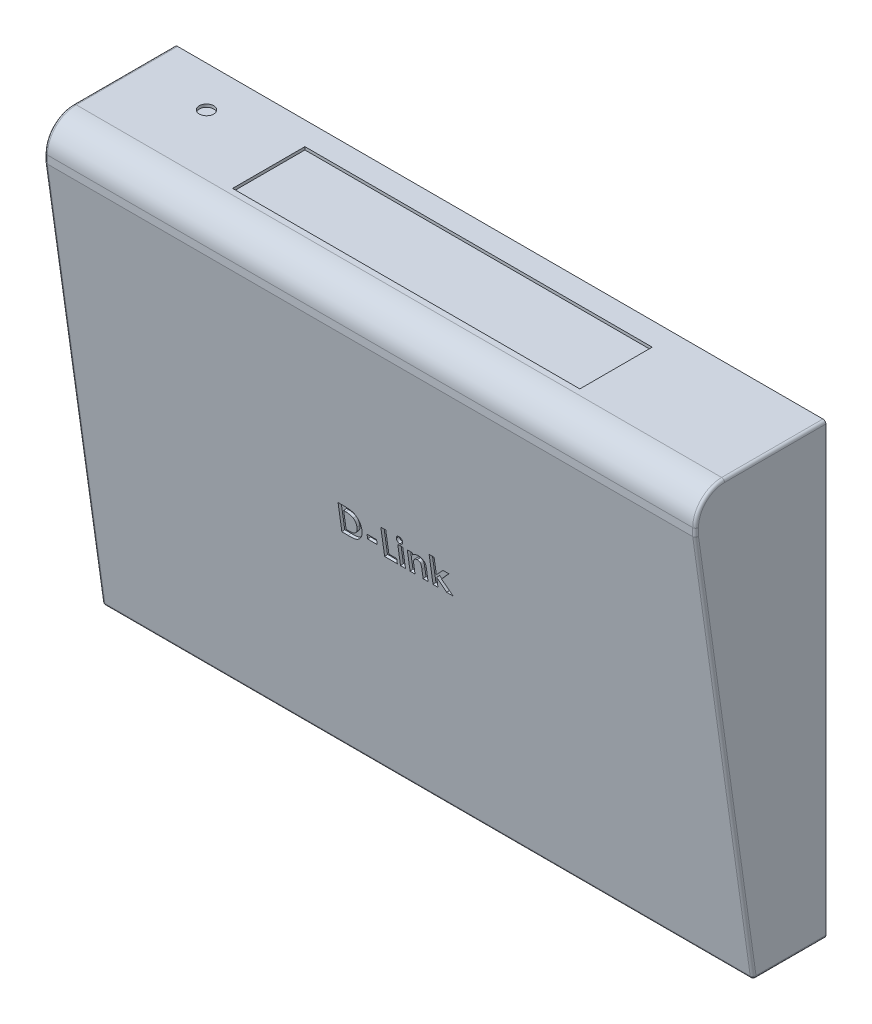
ISO-10303-21;
HEADER;
FILE_DESCRIPTION(('STEP AP214'),'2;1');
FILE_NAME('part.step','',(''),(''),'','','');
FILE_SCHEMA(('AUTOMOTIVE_DESIGN { 1 0 10303 214 1 1 1 1 }'));
ENDSEC;
DATA;
#1=APPLICATION_CONTEXT('core data for automotive mechanical design processes');
#2=APPLICATION_PROTOCOL_DEFINITION('international standard','automotive_design',2000,#1);
#3=PRODUCT_CONTEXT('',#1,'mechanical');
#4=PRODUCT('Part','Part','',(#3));
#5=PRODUCT_RELATED_PRODUCT_CATEGORY('part','',(#4));
#6=PRODUCT_DEFINITION_FORMATION('','',#4);
#7=PRODUCT_DEFINITION_CONTEXT('part definition',#1,'design');
#8=PRODUCT_DEFINITION('design','',#6,#7);
#9=PRODUCT_DEFINITION_SHAPE('','',#8);
#10=(LENGTH_UNIT() NAMED_UNIT(*) SI_UNIT(.MILLI.,.METRE.));
#11=(NAMED_UNIT(*) PLANE_ANGLE_UNIT() SI_UNIT($,.RADIAN.));
#12=(NAMED_UNIT(*) SI_UNIT($,.STERADIAN.) SOLID_ANGLE_UNIT());
#13=UNCERTAINTY_MEASURE_WITH_UNIT(LENGTH_MEASURE(1.E-05),#10,'distance_accuracy_value','');
#14=(GEOMETRIC_REPRESENTATION_CONTEXT(3) GLOBAL_UNCERTAINTY_ASSIGNED_CONTEXT((#13)) GLOBAL_UNIT_ASSIGNED_CONTEXT((#10,
#11,#12)) REPRESENTATION_CONTEXT('',''));
#15=CARTESIAN_POINT('',(0.,0.,0.));
#16=DIRECTION('',(0.,0.,1.));
#17=DIRECTION('',(1.,0.,0.));
#18=AXIS2_PLACEMENT_3D('',#15,#16,#17);
#19=CARTESIAN_POINT('',(0.,33.7297002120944,45.));
#20=DIRECTION('',(0.,-0.139173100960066,0.99026806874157));
#21=DIRECTION('',(-1.,0.,0.));
#22=AXIS2_PLACEMENT_3D('',#19,#20,#21);
#23=PLANE('',#22);
#24=DIRECTION('',(-1.,0.,0.));
#25=VECTOR('',#24,1.);
#26=CARTESIAN_POINT('',(179.548872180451,-107.716867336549,25.1209813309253));
#27=LINE('',#26,#25);
#28=CARTESIAN_POINT('',(-44.4511278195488,-107.716867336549,25.1209813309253));
#29=VERTEX_POINT('',#28);
#30=CARTESIAN_POINT('',(178.548872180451,-107.716867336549,25.1209813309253));
#31=VERTEX_POINT('',#30);
#32=EDGE_CURVE('E944',#29,#31,#27,.F.);
#33=ORIENTED_EDGE('',*,*,#32,.T.);
#34=DIRECTION('',(0.,-0.99026806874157,-0.139173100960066));
#35=VECTOR('',#34,1.);
#36=CARTESIAN_POINT('',(178.548872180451,33.7297002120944,45.));
#37=LINE('',#36,#35);
#38=CARTESIAN_POINT('',(178.548872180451,33.7297002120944,45.));
#39=VERTEX_POINT('',#38);
#40=EDGE_CURVE('E948',#31,#39,#37,.F.);
#41=ORIENTED_EDGE('',*,*,#40,.T.);
#42=DIRECTION('',(1.,0.,0.));
#43=VECTOR('',#42,1.);
#44=CARTESIAN_POINT('',(179.548872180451,33.7297002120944,45.));
#45=LINE('',#44,#43);
#46=CARTESIAN_POINT('',(-44.4511278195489,33.7297002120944,45.));
#47=VERTEX_POINT('',#46);
#48=EDGE_CURVE('E894',#47,#39,#45,.T.);
#49=ORIENTED_EDGE('',*,*,#48,.F.);
#50=DIRECTION('',(0.,0.99026806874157,0.139173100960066));
#51=VECTOR('',#50,1.);
#52=CARTESIAN_POINT('',(-44.4511278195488,-108.577694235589,25.));
#53=LINE('',#52,#51);
#54=EDGE_CURVE('E946',#47,#29,#53,.F.);
#55=ORIENTED_EDGE('',*,*,#54,.T.);
#56=EDGE_LOOP('',(#33,#41,#49,#55));
#57=FACE_BOUND('',#56,.T.);
#58=DIRECTION('',(-1.,0.,0.));
#59=VECTOR('',#58,1.);
#60=CARTESIAN_POINT('',(49.8290943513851,-35.1300923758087,35.3223872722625));
#61=LINE('',#60,#59);
#62=CARTESIAN_POINT('',(49.8290943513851,-35.1300923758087,35.3223872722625));
#63=VERTEX_POINT('',#62);
#64=CARTESIAN_POINT('',(47.6424657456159,-35.1300923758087,35.3223872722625));
#65=VERTEX_POINT('',#64);
#66=EDGE_CURVE('E862',#63,#65,#61,.T.);
#67=ORIENTED_EDGE('',*,*,#66,.T.);
#68=DIRECTION('',(0.,0.99026806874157,0.139173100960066));
#69=VECTOR('',#68,1.);
#70=CARTESIAN_POINT('',(47.6424657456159,-35.1300923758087,35.3223872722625));
#71=LINE('',#70,#69);
#72=CARTESIAN_POINT('',(47.6424657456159,-25.6977890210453,36.6480110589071));
#73=VERTEX_POINT('',#72);
#74=EDGE_CURVE('E842',#65,#73,#71,.T.);
#75=ORIENTED_EDGE('',*,*,#74,.T.);
#76=DIRECTION('',(1.,0.,0.));
#77=VECTOR('',#76,1.);
#78=CARTESIAN_POINT('',(47.6424657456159,-25.6977890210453,36.6480110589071));
#79=LINE('',#78,#77);
#80=CARTESIAN_POINT('',(49.7966574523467,-25.6977890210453,36.6480110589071));
#81=VERTEX_POINT('',#80);
#82=EDGE_CURVE('E845',#73,#81,#79,.T.);
#83=ORIENTED_EDGE('',*,*,#82,.T.);
#84=CARTESIAN_POINT('',(49.7966574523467,-25.6977890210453,36.6480110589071));
#85=CARTESIAN_POINT('',(49.9646014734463,-25.6989515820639,36.6478476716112));
#86=CARTESIAN_POINT('',(50.2892391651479,-25.7011988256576,36.6475318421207));
#87=CARTESIAN_POINT('',(50.7595749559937,-25.7265198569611,36.6439732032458));
#88=CARTESIAN_POINT('',(51.1969273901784,-25.7654618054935,36.6385002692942));
#89=CARTESIAN_POINT('',(51.601578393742,-25.8190335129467,36.6309712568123));
#90=CARTESIAN_POINT('',(51.9726983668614,-25.8899235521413,36.6210083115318));
#91=CARTESIAN_POINT('',(52.3098087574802,-25.9788412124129,36.6085117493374));
#92=CARTESIAN_POINT('',(52.6140409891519,-26.0814818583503,36.594086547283));
#93=CARTESIAN_POINT('',(52.8887309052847,-26.2022594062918,36.5771123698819));
#94=CARTESIAN_POINT('',(53.1394963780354,-26.3430740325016,36.5573221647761));
#95=CARTESIAN_POINT('',(53.3776061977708,-26.499930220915,36.5352774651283));
#96=CARTESIAN_POINT('',(53.6025928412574,-26.6785740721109,36.5101707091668));
#97=CARTESIAN_POINT('',(53.8176136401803,-26.8755591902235,36.4824862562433));
#98=CARTESIAN_POINT('',(54.0198937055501,-27.0944893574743,36.4517176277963));
#99=CARTESIAN_POINT('',(54.2128017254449,-27.331738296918,36.4183744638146));
#100=CARTESIAN_POINT('',(54.3916144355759,-27.5907464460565,36.38197324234));
#101=CARTESIAN_POINT('',(54.5617369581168,-27.8653036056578,36.3433867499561));
#102=CARTESIAN_POINT('',(54.7155901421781,-28.156573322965,36.3024514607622));
#103=CARTESIAN_POINT('',(54.8497866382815,-28.4620763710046,36.2595158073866));
#104=CARTESIAN_POINT('',(54.9622038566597,-28.77984672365,36.2148560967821));
#105=CARTESIAN_POINT('',(55.0535486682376,-29.1102230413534,36.1684247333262));
#106=CARTESIAN_POINT('',(55.1263610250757,-29.4521085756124,36.1203758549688));
#107=CARTESIAN_POINT('',(55.177306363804,-29.8061932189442,36.0706125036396));
#108=CARTESIAN_POINT('',(55.2088012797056,-30.1721491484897,36.019180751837));
#109=CARTESIAN_POINT('',(55.2119961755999,-30.4201754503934,35.9843229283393));
#110=CARTESIAN_POINT('',(55.2136195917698,-30.5462045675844,35.9666106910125));
#111=B_SPLINE_CURVE_WITH_KNOTS('',3,(#84,#85,#86,#87,#88,#89,#90,#91,#92,#93,#94,#95,#96,#97,
#98,#99,#100,#101,#102,#103,#104,#105,#106,#107,#108,#109,#110),.UNSPECIFIED.,.F.,.F.,(4,1,1,1,
1,1,1,1,1,1,1,1,1,1,1,1,1,1,1,1,1,1,1,1,4),(0.,0.0601481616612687,0.116267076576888,
0.168653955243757,0.217398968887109,0.262433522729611,0.303932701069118,0.342259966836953,
0.377441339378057,0.411406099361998,0.445398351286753,0.479766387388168,0.514584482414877,
0.550213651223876,0.587000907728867,0.624662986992,0.663615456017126,0.703456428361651,
0.743450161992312,0.784013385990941,0.825132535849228,0.86726466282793,0.910306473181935,
0.95442420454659,1.),.UNSPECIFIED.);
#112=CARTESIAN_POINT('',(55.2136195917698,-30.5462045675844,35.9666106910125));
#113=VERTEX_POINT('',#112);
#114=EDGE_CURVE('E849',#81,#113,#111,.T.);
#115=ORIENTED_EDGE('',*,*,#114,.T.);
#116=CARTESIAN_POINT('',(55.2136195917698,-30.5462045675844,35.9666106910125));
#117=CARTESIAN_POINT('',(55.2093686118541,-30.7240398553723,35.9416175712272));
#118=CARTESIAN_POINT('',(55.2010003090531,-31.0741190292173,35.8924171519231));
#119=CARTESIAN_POINT('',(55.1305104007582,-31.5878561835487,35.8202161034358));
#120=CARTESIAN_POINT('',(55.0165043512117,-32.0803244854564,35.7510041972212));
#121=CARTESIAN_POINT('',(54.8562014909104,-32.5476716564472,35.6853228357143));
#122=CARTESIAN_POINT('',(54.6574688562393,-32.9857359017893,35.6237569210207));
#123=CARTESIAN_POINT('',(54.4200604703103,-33.3867921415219,35.567392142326));
#124=CARTESIAN_POINT('',(54.147457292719,-33.7486877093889,35.5165310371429));
#125=CARTESIAN_POINT('',(53.8428351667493,-34.0696206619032,35.4714268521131));
#126=CARTESIAN_POINT('',(53.5130035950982,-34.3454668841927,35.432659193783));
#127=CARTESIAN_POINT('',(53.1702420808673,-34.5817089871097,35.3994575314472));
#128=CARTESIAN_POINT('',(52.8112115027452,-34.7680055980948,35.3732752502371));
#129=CARTESIAN_POINT('',(52.4948553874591,-34.8861455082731,35.356671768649));
#130=CARTESIAN_POINT('',(52.2205351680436,-34.9596183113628,35.3463458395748));
#131=CARTESIAN_POINT('',(51.9796849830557,-35.0030414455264,35.3402431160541));
#132=CARTESIAN_POINT('',(51.7061037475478,-35.0428630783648,35.3346465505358));
#133=CARTESIAN_POINT('',(51.3972405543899,-35.0736363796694,35.3303216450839));
#134=CARTESIAN_POINT('',(51.0544503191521,-35.1010786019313,35.3264648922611));
#135=CARTESIAN_POINT('',(50.6763666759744,-35.1159896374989,35.3243692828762));
#136=CARTESIAN_POINT('',(50.2642137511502,-35.1283784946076,35.3226281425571));
#137=CARTESIAN_POINT('',(49.9779345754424,-35.129506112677,35.3224696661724));
#138=CARTESIAN_POINT('',(49.8290943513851,-35.1300923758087,35.3223872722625));
#139=B_SPLINE_CURVE_WITH_KNOTS('',3,(#116,#117,#118,#119,#120,#121,#122,#123,#124,#125,#126,
#127,#128,#129,#130,#131,#132,#133,#134,#135,#136,#137,#138),.UNSPECIFIED.,.F.,.F.,(4,1,1,1,1,1,
1,1,1,1,1,1,1,1,1,1,1,1,1,1,4),(0.,0.065772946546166,0.129477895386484,0.191430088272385,
0.252445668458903,0.311786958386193,0.368817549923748,0.424091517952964,0.478492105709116,
0.531393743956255,0.582003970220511,0.631201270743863,0.679503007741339,0.70556137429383,
0.735221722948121,0.769132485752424,0.806858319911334,0.848929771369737,0.89511666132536,
0.945469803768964,1.),.UNSPECIFIED.);
#140=EDGE_CURVE('E854',#113,#63,#139,.T.);
#141=ORIENTED_EDGE('',*,*,#140,.T.);
#142=EDGE_LOOP('',(#67,#75,#83,#115,#141));
#143=FACE_BOUND('',#142,.T.);
#144=DIRECTION('',(-1.,0.,0.));
#145=VECTOR('',#144,1.);
#146=CARTESIAN_POINT('',(60.2203503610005,-32.4696991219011,35.6962811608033));
#147=LINE('',#146,#145);
#148=CARTESIAN_POINT('',(60.2203503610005,-32.4696991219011,35.6962811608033));
#149=VERTEX_POINT('',#148);
#150=CARTESIAN_POINT('',(56.9232349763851,-32.4696991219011,35.6962811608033));
#151=VERTEX_POINT('',#150);
#152=EDGE_CURVE('E1680',#149,#151,#147,.T.);
#153=ORIENTED_EDGE('',*,*,#152,.T.);
#154=DIRECTION('',(0.,0.99026806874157,0.139173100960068));
#155=VECTOR('',#154,1.);
#156=CARTESIAN_POINT('',(56.9232349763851,-32.4696991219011,35.6962811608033));
#157=LINE('',#156,#155);
#158=CARTESIAN_POINT('',(56.9232349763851,-30.8976485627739,35.9172184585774));
#159=VERTEX_POINT('',#158);
#160=EDGE_CURVE('E1687',#151,#159,#157,.T.);
#161=ORIENTED_EDGE('',*,*,#160,.T.);
#162=DIRECTION('',(1.,0.,0.));
#163=VECTOR('',#162,1.);
#164=CARTESIAN_POINT('',(56.9232349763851,-30.8976485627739,35.9172184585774));
#165=LINE('',#164,#163);
#166=CARTESIAN_POINT('',(60.2203503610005,-30.8976485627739,35.9172184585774));
#167=VERTEX_POINT('',#166);
#168=EDGE_CURVE('E1690',#159,#167,#165,.T.);
#169=ORIENTED_EDGE('',*,*,#168,.T.);
#170=DIRECTION('',(0.,-0.99026806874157,-0.139173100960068));
#171=VECTOR('',#170,1.);
#172=CARTESIAN_POINT('',(60.2203503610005,-30.8976485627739,35.9172184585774));
#173=LINE('',#172,#171);
#174=EDGE_CURVE('E1694',#167,#149,#173,.T.);
#175=ORIENTED_EDGE('',*,*,#174,.T.);
#176=EDGE_LOOP('',(#153,#161,#169,#175));
#177=FACE_BOUND('',#176,.T.);
#178=DIRECTION('',(-1.,0.,0.));
#179=VECTOR('',#178,1.);
#180=CARTESIAN_POINT('',(66.8145811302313,-35.1300923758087,35.3223872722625));
#181=LINE('',#180,#179);
#182=CARTESIAN_POINT('',(66.8145811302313,-35.1300923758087,35.3223872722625));
#183=VERTEX_POINT('',#182);
#184=CARTESIAN_POINT('',(62.4184272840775,-35.1300923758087,35.3223872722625));
#185=VERTEX_POINT('',#184);
#186=EDGE_CURVE('E1712',#183,#185,#181,.T.);
#187=ORIENTED_EDGE('',*,*,#186,.T.);
#188=DIRECTION('',(0.,0.99026806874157,0.139173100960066));
#189=VECTOR('',#188,1.);
#190=CARTESIAN_POINT('',(62.4184272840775,-35.1300923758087,35.3223872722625));
#191=LINE('',#190,#189);
#192=CARTESIAN_POINT('',(62.4184272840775,-25.6977890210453,36.6480110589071));
#193=VERTEX_POINT('',#192);
#194=EDGE_CURVE('E764',#185,#193,#191,.T.);
#195=ORIENTED_EDGE('',*,*,#194,.T.);
#196=DIRECTION('',(1.,0.,0.));
#197=VECTOR('',#196,1.);
#198=CARTESIAN_POINT('',(62.4184272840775,-25.6977890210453,36.6480110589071));
#199=LINE('',#198,#197);
#200=CARTESIAN_POINT('',(64.1280426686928,-25.6977890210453,36.6480110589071));
#201=VERTEX_POINT('',#200);
#202=EDGE_CURVE('E1725',#193,#201,#199,.T.);
#203=ORIENTED_EDGE('',*,*,#202,.T.);
#204=DIRECTION('',(0.,-0.99026806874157,-0.139173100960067));
#205=VECTOR('',#204,1.);
#206=CARTESIAN_POINT('',(64.1280426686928,-25.6977890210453,36.6480110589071));
#207=LINE('',#206,#205);
#208=CARTESIAN_POINT('',(64.1280426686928,-33.4371148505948,35.5603197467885));
#209=VERTEX_POINT('',#208);
#210=EDGE_CURVE('E1728',#201,#209,#207,.T.);
#211=ORIENTED_EDGE('',*,*,#210,.T.);
#212=DIRECTION('',(1.,0.,0.));
#213=VECTOR('',#212,1.);
#214=CARTESIAN_POINT('',(64.1280426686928,-33.4371148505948,35.5603197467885));
#215=LINE('',#214,#213);
#216=CARTESIAN_POINT('',(66.8145811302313,-33.4371148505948,35.5603197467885));
#217=VERTEX_POINT('',#216);
#218=EDGE_CURVE('E1731',#209,#217,#215,.T.);
#219=ORIENTED_EDGE('',*,*,#218,.T.);
#220=DIRECTION('',(0.,-0.99026806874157,-0.139173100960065));
#221=VECTOR('',#220,1.);
#222=CARTESIAN_POINT('',(66.8145811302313,-33.4371148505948,35.5603197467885));
#223=LINE('',#222,#221);
#224=EDGE_CURVE('E1734',#217,#183,#223,.T.);
#225=ORIENTED_EDGE('',*,*,#224,.T.);
#226=EDGE_LOOP('',(#187,#195,#203,#211,#219,#225));
#227=FACE_BOUND('',#226,.T.);
#228=CARTESIAN_POINT('',(68.7779675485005,-27.6326204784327,36.3760882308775));
#229=CARTESIAN_POINT('',(68.7036399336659,-27.6290532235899,36.3765895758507));
#230=CARTESIAN_POINT('',(68.5576947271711,-27.6220487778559,36.3775739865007));
#231=CARTESIAN_POINT('',(68.348711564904,-27.5533637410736,36.3872270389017));
#232=CARTESIAN_POINT('',(68.1559304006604,-27.4466632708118,36.4022228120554));
#233=CARTESIAN_POINT('',(67.9884791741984,-27.2960907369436,36.4233844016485));
#234=CARTESIAN_POINT('',(67.8470002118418,-27.1186277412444,36.4483251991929));
#235=CARTESIAN_POINT('',(67.7447971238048,-26.91675509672,36.4766965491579));
#236=CARTESIAN_POINT('',(67.68086656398,-26.6966807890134,36.5076259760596));
#237=CARTESIAN_POINT('',(67.6732780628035,-26.5434519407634,36.5291608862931));
#238=CARTESIAN_POINT('',(67.669388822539,-26.4649194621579,36.5401979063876));
#239=B_SPLINE_CURVE_WITH_KNOTS('',3,(#228,#229,#230,#231,#232,#233,#234,#235,#236,#237,#238),
.UNSPECIFIED.,.F.,.F.,(4,1,1,1,1,1,1,1,4),(0.,0.123633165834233,0.242758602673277,
0.363442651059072,0.489711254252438,0.617482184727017,0.742279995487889,0.867913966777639,1.),.UNSPECIFIED.);
#240=CARTESIAN_POINT('',(68.7779675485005,-27.6326204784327,36.3760882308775));
#241=VERTEX_POINT('',#240);
#242=CARTESIAN_POINT('',(67.669388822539,-26.4649194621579,36.5401979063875));
#243=VERTEX_POINT('',#242);
#244=EDGE_CURVE('E743',#241,#243,#239,.T.);
#245=ORIENTED_EDGE('',*,*,#244,.T.);
#246=CARTESIAN_POINT('',(67.669388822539,-26.4649194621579,36.5401979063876));
#247=CARTESIAN_POINT('',(67.673621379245,-26.3896169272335,36.550780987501));
#248=CARTESIAN_POINT('',(67.681935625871,-26.2416959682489,36.5715699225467));
#249=CARTESIAN_POINT('',(67.7418257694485,-26.0279759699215,36.6016063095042));
#250=CARTESIAN_POINT('',(67.8462464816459,-25.8340127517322,36.6288660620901));
#251=CARTESIAN_POINT('',(67.9851159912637,-25.6610275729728,36.6531775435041));
#252=CARTESIAN_POINT('',(68.1518195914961,-25.5162223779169,36.6735285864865));
#253=CARTESIAN_POINT('',(68.341949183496,-25.4119411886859,36.6881843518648));
#254=CARTESIAN_POINT('',(68.5478371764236,-25.346246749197,36.6974171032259));
#255=CARTESIAN_POINT('',(68.6916070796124,-25.3387930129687,36.6984646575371));
#256=CARTESIAN_POINT('',(68.7646111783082,-25.3350081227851,36.6989965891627));
#257=B_SPLINE_CURVE_WITH_KNOTS('',3,(#246,#247,#248,#249,#250,#251,#252,#253,#254,#255,#256),
.UNSPECIFIED.,.F.,.F.,(4,1,1,1,1,1,1,1,4),(0.,0.129827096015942,0.255026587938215,
0.378937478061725,0.506522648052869,0.634371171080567,0.754975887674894,0.875580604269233,1.),.UNSPECIFIED.);
#258=CARTESIAN_POINT('',(68.7646111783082,-25.3350081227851,36.6989965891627));
#259=VERTEX_POINT('',#258);
#260=EDGE_CURVE('E555',#243,#259,#257,.T.);
#261=ORIENTED_EDGE('',*,*,#260,.T.);
#262=CARTESIAN_POINT('',(68.7646111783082,-25.3350081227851,36.6989965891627));
#263=CARTESIAN_POINT('',(68.8382955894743,-25.3385881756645,36.6984934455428));
#264=CARTESIAN_POINT('',(68.9829820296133,-25.3456179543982,36.6975054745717));
#265=CARTESIAN_POINT('',(69.1902650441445,-25.4141426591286,36.6878749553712));
#266=CARTESIAN_POINT('',(69.3805088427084,-25.5216901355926,36.6727601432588));
#267=CARTESIAN_POINT('',(69.5486896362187,-25.6692478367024,36.6520222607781));
#268=CARTESIAN_POINT('',(69.6885666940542,-25.8454587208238,36.62725743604));
#269=CARTESIAN_POINT('',(69.7954379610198,-26.0427385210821,36.5995315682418));
#270=CARTESIAN_POINT('',(69.8549714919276,-26.2613181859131,36.5688121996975));
#271=CARTESIAN_POINT('',(69.8632398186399,-26.4123107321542,36.5475915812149));
#272=CARTESIAN_POINT('',(69.8674657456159,-26.4894827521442,36.5367457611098));
#273=B_SPLINE_CURVE_WITH_KNOTS('',3,(#262,#263,#264,#265,#266,#267,#268,#269,#270,#271,#272),
.UNSPECIFIED.,.F.,.F.,(4,1,1,1,1,1,1,1,4),(0.,0.123733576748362,0.242962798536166,
0.363854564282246,0.490606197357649,0.618739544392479,0.743300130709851,0.868801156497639,1.),.UNSPECIFIED.);
#274=CARTESIAN_POINT('',(69.8674657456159,-26.4894827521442,36.5367457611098));
#275=VERTEX_POINT('',#274);
#276=EDGE_CURVE('E727',#259,#275,#273,.T.);
#277=ORIENTED_EDGE('',*,*,#276,.T.);
#278=CARTESIAN_POINT('',(69.8674657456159,-26.4894827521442,36.5367457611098));
#279=CARTESIAN_POINT('',(69.8633910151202,-26.5660860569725,36.5259798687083));
#280=CARTESIAN_POINT('',(69.8554512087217,-26.7153512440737,36.5050020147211));
#281=CARTESIAN_POINT('',(69.7940677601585,-26.9309635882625,36.4746996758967));
#282=CARTESIAN_POINT('',(69.6914859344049,-27.1281475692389,36.4469872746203));
#283=CARTESIAN_POINT('',(69.5504759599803,-27.3017413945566,36.422590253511));
#284=CARTESIAN_POINT('',(69.3841184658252,-27.4469225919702,36.4021863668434));
#285=CARTESIAN_POINT('',(69.1980316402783,-27.5564225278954,36.3867971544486));
#286=CARTESIAN_POINT('',(68.9927349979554,-27.6211352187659,36.3777023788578));
#287=CARTESIAN_POINT('',(68.8502936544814,-27.628752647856,36.3766318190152));
#288=CARTESIAN_POINT('',(68.7779675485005,-27.6326204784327,36.3760882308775));
#289=B_SPLINE_CURVE_WITH_KNOTS('',3,(#278,#279,#280,#281,#282,#283,#284,#285,#286,#287,#288),
.UNSPECIFIED.,.F.,.F.,(4,1,1,1,1,1,1,1,4),(0.,0.131620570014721,0.256468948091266,
0.381954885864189,0.510704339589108,0.637377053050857,0.757775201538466,0.877007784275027,1.),.UNSPECIFIED.);
#290=EDGE_CURVE('E735',#275,#241,#289,.T.);
#291=ORIENTED_EDGE('',*,*,#290,.T.);
#292=EDGE_LOOP('',(#245,#261,#277,#291));
#293=FACE_BOUND('',#292,.T.);
#294=DIRECTION('',(-1.,0.,0.));
#295=VECTOR('',#294,1.);
#296=CARTESIAN_POINT('',(69.6232349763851,-35.1300923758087,35.3223872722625));
#297=LINE('',#296,#295);
#298=CARTESIAN_POINT('',(69.6232349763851,-35.1300923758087,35.3223872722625));
#299=VERTEX_POINT('',#298);
#300=CARTESIAN_POINT('',(67.9136195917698,-35.1300923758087,35.3223872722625));
#301=VERTEX_POINT('',#300);
#302=EDGE_CURVE('E527',#299,#301,#297,.T.);
#303=ORIENTED_EDGE('',*,*,#302,.T.);
#304=DIRECTION('',(0.,0.99026806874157,0.139173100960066));
#305=VECTOR('',#304,1.);
#306=CARTESIAN_POINT('',(67.9136195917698,-35.1300923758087,35.3223872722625));
#307=LINE('',#306,#305);
#308=CARTESIAN_POINT('',(67.9136195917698,-28.2372553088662,36.2911123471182));
#309=VERTEX_POINT('',#308);
#310=EDGE_CURVE('E534',#301,#309,#307,.T.);
#311=ORIENTED_EDGE('',*,*,#310,.T.);
#312=DIRECTION('',(1.,0.,0.));
#313=VECTOR('',#312,1.);
#314=CARTESIAN_POINT('',(67.9136195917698,-28.2372553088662,36.2911123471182));
#315=LINE('',#314,#313);
#316=CARTESIAN_POINT('',(69.6232349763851,-28.2372553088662,36.2911123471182));
#317=VERTEX_POINT('',#316);
#318=EDGE_CURVE('E537',#309,#317,#315,.T.);
#319=ORIENTED_EDGE('',*,*,#318,.T.);
#320=DIRECTION('',(0.,-0.99026806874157,-0.139173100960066));
#321=VECTOR('',#320,1.);
#322=CARTESIAN_POINT('',(69.6232349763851,-28.2372553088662,36.2911123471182));
#323=LINE('',#322,#321);
#324=EDGE_CURVE('E541',#317,#299,#323,.T.);
#325=ORIENTED_EDGE('',*,*,#324,.T.);
#326=EDGE_LOOP('',(#303,#311,#319,#325));
#327=FACE_BOUND('',#326,.T.);
#328=DIRECTION('',(-1.,0.,0.));
#329=VECTOR('',#328,1.);
#330=CARTESIAN_POINT('',(72.9203503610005,-35.1300923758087,35.3223872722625));
#331=LINE('',#330,#329);
#332=CARTESIAN_POINT('',(72.9203503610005,-35.1300923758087,35.3223872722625));
#333=VERTEX_POINT('',#332);
#334=CARTESIAN_POINT('',(71.2107349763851,-35.1300923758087,35.3223872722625));
#335=VERTEX_POINT('',#334);
#336=EDGE_CURVE('E560',#333,#335,#331,.T.);
#337=ORIENTED_EDGE('',*,*,#336,.T.);
#338=DIRECTION('',(0.,0.99026806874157,0.139173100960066));
#339=VECTOR('',#338,1.);
#340=CARTESIAN_POINT('',(71.2107349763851,-35.1300923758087,35.3223872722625));
#341=LINE('',#340,#339);
#342=CARTESIAN_POINT('',(71.2107349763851,-28.2372553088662,36.2911123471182));
#343=VERTEX_POINT('',#342);
#344=EDGE_CURVE('E1501',#335,#343,#341,.T.);
#345=ORIENTED_EDGE('',*,*,#344,.T.);
#346=DIRECTION('',(1.,0.,0.));
#347=VECTOR('',#346,1.);
#348=CARTESIAN_POINT('',(71.2107349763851,-28.2372553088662,36.2911123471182));
#349=LINE('',#348,#347);
#350=CARTESIAN_POINT('',(72.9203503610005,-28.2372553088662,36.2911123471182));
#351=VERTEX_POINT('',#350);
#352=EDGE_CURVE('E1504',#343,#351,#349,.T.);
#353=ORIENTED_EDGE('',*,*,#352,.T.);
#354=DIRECTION('',(0.,-0.99026806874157,-0.139173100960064));
#355=VECTOR('',#354,1.);
#356=CARTESIAN_POINT('',(72.9203503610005,-28.2372553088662,36.2911123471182));
#357=LINE('',#356,#355);
#358=CARTESIAN_POINT('',(72.9203503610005,-28.9665960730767,36.1886101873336));
#359=VERTEX_POINT('',#358);
#360=EDGE_CURVE('E1508',#351,#359,#357,.T.);
#361=ORIENTED_EDGE('',*,*,#360,.T.);
#362=CARTESIAN_POINT('',(72.9203503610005,-28.9665960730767,36.1886101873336));
#363=CARTESIAN_POINT('',(73.0178830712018,-28.8914714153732,36.199168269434));
#364=CARTESIAN_POINT('',(73.2042870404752,-28.7478935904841,36.2193468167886));
#365=CARTESIAN_POINT('',(73.4876532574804,-28.5648311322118,36.2450745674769));
#366=CARTESIAN_POINT('',(73.7551158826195,-28.4150018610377,36.2661316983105));
#367=CARTESIAN_POINT('',(74.0126369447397,-28.3010340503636,36.2821488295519));
#368=CARTESIAN_POINT('',(74.2650617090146,-28.2190391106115,36.293672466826));
#369=CARTESIAN_POINT('',(74.5164783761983,-28.1601306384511,36.3019515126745));
#370=CARTESIAN_POINT('',(74.7706310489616,-28.1224099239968,36.3072528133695));
#371=CARTESIAN_POINT('',(74.94148333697,-28.1183544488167,36.3078227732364));
#372=CARTESIAN_POINT('',(75.0268407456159,-28.1163283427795,36.30810752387));
#373=B_SPLINE_CURVE_WITH_KNOTS('',3,(#362,#363,#364,#365,#366,#367,#368,#369,#370,#371,#372),
.UNSPECIFIED.,.F.,.F.,(4,1,1,1,1,1,1,1,4),(0.,0.159580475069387,0.304989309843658,
0.436681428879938,0.556242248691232,0.668759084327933,0.779378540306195,0.889778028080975,1.),.UNSPECIFIED.);
#374=CARTESIAN_POINT('',(75.0268407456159,-28.1163283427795,36.30810752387));
#375=VERTEX_POINT('',#374);
#376=EDGE_CURVE('E1511',#359,#375,#373,.T.);
#377=ORIENTED_EDGE('',*,*,#376,.T.);
#378=CARTESIAN_POINT('',(75.0268407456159,-28.1163283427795,36.30810752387));
#379=CARTESIAN_POINT('',(75.1134243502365,-28.1186437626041,36.3077821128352));
#380=CARTESIAN_POINT('',(75.2833952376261,-28.1231891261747,36.307143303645));
#381=CARTESIAN_POINT('',(75.5336680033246,-28.1549802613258,36.3026753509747));
#382=CARTESIAN_POINT('',(75.7727793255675,-28.2128819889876,36.2945377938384));
#383=CARTESIAN_POINT('',(76.0034178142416,-28.2897598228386,36.2837333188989));
#384=CARTESIAN_POINT('',(76.2232359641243,-28.3912341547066,36.2694720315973));
#385=CARTESIAN_POINT('',(76.4349266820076,-28.5117184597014,36.2525390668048));
#386=CARTESIAN_POINT('',(76.6339429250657,-28.6584764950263,36.2319135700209));
#387=CARTESIAN_POINT('',(76.7565059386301,-28.7702403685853,36.2162061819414));
#388=CARTESIAN_POINT('',(76.8185024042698,-28.8267742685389,36.2082608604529));
#389=B_SPLINE_CURVE_WITH_KNOTS('',3,(#378,#379,#380,#381,#382,#383,#384,#385,#386,#387,#388),
.UNSPECIFIED.,.F.,.F.,(4,1,1,1,1,1,1,1,4),(0.,0.131104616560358,0.25736937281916,
0.381171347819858,0.503298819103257,0.62524768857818,0.747811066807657,0.872434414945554,1.),.UNSPECIFIED.);
#390=CARTESIAN_POINT('',(76.8185024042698,-28.8267742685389,36.2082608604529));
#391=VERTEX_POINT('',#390);
#392=EDGE_CURVE('E1516',#375,#391,#389,.T.);
#393=ORIENTED_EDGE('',*,*,#392,.T.);
#394=CARTESIAN_POINT('',(76.8185024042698,-28.8267742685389,36.2082608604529));
#395=CARTESIAN_POINT('',(76.8682258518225,-28.8791646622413,36.2008978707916));
#396=CARTESIAN_POINT('',(76.968036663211,-28.9843288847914,36.1861180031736));
#397=CARTESIAN_POINT('',(77.0936360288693,-29.1642918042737,36.1608258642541));
#398=CARTESIAN_POINT('',(77.2014144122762,-29.3604843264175,36.1332528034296));
#399=CARTESIAN_POINT('',(77.2897238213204,-29.5751695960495,36.1030807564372));
#400=CARTESIAN_POINT('',(77.3549809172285,-29.8095271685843,36.0701439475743));
#401=CARTESIAN_POINT('',(77.4051840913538,-30.0607263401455,36.0348402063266));
#402=CARTESIAN_POINT('',(77.4333539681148,-30.3301736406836,35.9969718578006));
#403=CARTESIAN_POINT('',(77.4368316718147,-30.515281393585,35.970956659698));
#404=CARTESIAN_POINT('',(77.4386195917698,-30.6104470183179,35.9575820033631));
#405=B_SPLINE_CURVE_WITH_KNOTS('',3,(#394,#395,#396,#397,#398,#399,#400,#401,#402,#403,#404),
.UNSPECIFIED.,.F.,.F.,(4,1,1,1,1,1,1,1,4),(0.,0.111198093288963,0.223210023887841,
0.33754558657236,0.456528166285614,0.581243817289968,0.713405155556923,0.852658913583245,1.),.UNSPECIFIED.);
#406=CARTESIAN_POINT('',(77.4386195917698,-30.6104470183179,35.9575820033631));
#407=VERTEX_POINT('',#406);
#408=EDGE_CURVE('E1524',#391,#407,#405,.T.);
#409=ORIENTED_EDGE('',*,*,#408,.T.);
#410=DIRECTION('',(0.,-0.99026806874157,-0.139173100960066));
#411=VECTOR('',#410,1.);
#412=CARTESIAN_POINT('',(77.4386195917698,-30.6104470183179,35.9575820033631));
#413=LINE('',#412,#411);
#414=CARTESIAN_POINT('',(77.4386195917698,-35.1300923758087,35.3223872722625));
#415=VERTEX_POINT('',#414);
#416=EDGE_CURVE('E1532',#407,#415,#413,.T.);
#417=ORIENTED_EDGE('',*,*,#416,.T.);
#418=DIRECTION('',(-1.,0.,0.));
#419=VECTOR('',#418,1.);
#420=CARTESIAN_POINT('',(77.4386195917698,-35.1300923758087,35.3223872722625));
#421=LINE('',#420,#419);
#422=CARTESIAN_POINT('',(75.7290042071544,-35.1300923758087,35.3223872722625));
#423=VERTEX_POINT('',#422);
#424=EDGE_CURVE('E1538',#415,#423,#421,.T.);
#425=ORIENTED_EDGE('',*,*,#424,.T.);
#426=DIRECTION('',(0.,0.99026806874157,0.139173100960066));
#427=VECTOR('',#426,1.);
#428=CARTESIAN_POINT('',(75.7290042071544,-35.1300923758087,35.3223872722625));
#429=LINE('',#428,#427);
#430=CARTESIAN_POINT('',(75.7290042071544,-32.1371499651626,35.7430178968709));
#431=VERTEX_POINT('',#430);
#432=EDGE_CURVE('E1541',#423,#431,#429,.T.);
#433=ORIENTED_EDGE('',*,*,#432,.T.);
#434=CARTESIAN_POINT('',(75.7290042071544,-32.1371499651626,35.7430178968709));
#435=CARTESIAN_POINT('',(75.7286426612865,-32.0395253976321,35.7567381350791));
#436=CARTESIAN_POINT('',(75.7279498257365,-31.8524460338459,35.7830304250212));
#437=CARTESIAN_POINT('',(75.7226303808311,-31.5847073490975,35.8206586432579));
#438=CARTESIAN_POINT('',(75.7122437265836,-31.3429045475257,35.8546418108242));
#439=CARTESIAN_POINT('',(75.7027765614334,-31.1265973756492,35.8850418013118));
#440=CARTESIAN_POINT('',(75.6841887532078,-30.936553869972,35.9117506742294));
#441=CARTESIAN_POINT('',(75.6674259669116,-30.771570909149,35.9349375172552));
#442=CARTESIAN_POINT('',(75.6417050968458,-30.633145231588,35.9543919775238));
#443=CARTESIAN_POINT('',(75.6082380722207,-30.4842476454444,35.9753181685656));
#444=CARTESIAN_POINT('',(75.5497964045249,-30.3248255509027,35.9977234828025));
#445=CARTESIAN_POINT('',(75.4590685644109,-30.1568480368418,36.0213311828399));
#446=CARTESIAN_POINT('',(75.3439675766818,-30.0141473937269,36.0413864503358));
#447=CARTESIAN_POINT('',(75.2091946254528,-29.8957232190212,36.0580298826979));
#448=CARTESIAN_POINT('',(75.0548985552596,-29.8020388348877,36.0711963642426));
#449=CARTESIAN_POINT('',(74.8829438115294,-29.7361260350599,36.080459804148));
#450=CARTESIAN_POINT('',(74.6942522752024,-29.6950475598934,36.0862330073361));
#451=CARTESIAN_POINT('',(74.5627742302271,-29.6906583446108,36.0868498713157));
#452=CARTESIAN_POINT('',(74.4944939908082,-29.6883789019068,36.0871702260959));
#453=B_SPLINE_CURVE_WITH_KNOTS('',3,(#434,#435,#436,#437,#438,#439,#440,#441,#442,#443,#444,
#445,#446,#447,#448,#449,#450,#451,#452),.UNSPECIFIED.,.F.,.F.,(4,1,1,1,1,1,1,1,1,1,1,1,1,1,1,1,
4),(0.,0.0936789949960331,0.179518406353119,0.256936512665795,0.325929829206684,
0.387212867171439,0.440139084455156,0.484952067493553,0.522188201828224,0.586422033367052,
0.647003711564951,0.70420196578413,0.760716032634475,0.817414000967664,0.875212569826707,
0.935194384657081,1.),.UNSPECIFIED.);
#454=CARTESIAN_POINT('',(74.4944939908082,-29.6883789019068,36.0871702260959));
#455=VERTEX_POINT('',#454);
#456=EDGE_CURVE('E1544',#431,#455,#453,.T.);
#457=ORIENTED_EDGE('',*,*,#456,.T.);
#458=CARTESIAN_POINT('',(74.4944939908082,-29.6883789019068,36.0871702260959));
#459=CARTESIAN_POINT('',(74.4056926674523,-29.6928382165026,36.0865435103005));
#460=CARTESIAN_POINT('',(74.2319800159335,-29.7015615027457,36.0853175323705));
#461=CARTESIAN_POINT('',(73.9807394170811,-29.7673430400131,36.0760725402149));
#462=CARTESIAN_POINT('',(73.749979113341,-29.8792180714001,36.0603495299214));
#463=CARTESIAN_POINT('',(73.5415846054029,-30.0340306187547,36.0385920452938));
#464=CARTESIAN_POINT('',(73.3575406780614,-30.2251658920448,36.0117297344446));
#465=CARTESIAN_POINT('',(73.205957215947,-30.453116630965,35.9796933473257));
#466=CARTESIAN_POINT('',(73.0816276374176,-30.7123812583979,35.9432560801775));
#467=CARTESIAN_POINT('',(73.0281640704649,-30.9016865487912,35.916650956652));
#468=CARTESIAN_POINT('',(73.0004885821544,-30.9996806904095,35.902878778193));
#469=B_SPLINE_CURVE_WITH_KNOTS('',3,(#458,#459,#460,#461,#462,#463,#464,#465,#466,#467,#468),
.UNSPECIFIED.,.F.,.F.,(4,1,1,1,1,1,1,1,4),(0.,0.123023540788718,0.240657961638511,
0.357389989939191,0.477137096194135,0.600008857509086,0.725224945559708,0.857762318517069,1.),.UNSPECIFIED.);
#470=CARTESIAN_POINT('',(73.0004885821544,-30.9996806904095,35.902878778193));
#471=VERTEX_POINT('',#470);
#472=EDGE_CURVE('E1549',#455,#471,#469,.T.);
#473=ORIENTED_EDGE('',*,*,#472,.T.);
#474=CARTESIAN_POINT('',(73.0004885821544,-30.9996806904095,35.902878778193));
#475=CARTESIAN_POINT('',(72.9936101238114,-31.0304564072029,35.8985535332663));
#476=CARTESIAN_POINT('',(72.97826977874,-31.0990924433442,35.8889073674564));
#477=CARTESIAN_POINT('',(72.9656542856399,-31.2150455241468,35.8726112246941));
#478=CARTESIAN_POINT('',(72.9481052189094,-31.3526126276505,35.85327742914));
#479=CARTESIAN_POINT('',(72.9415300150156,-31.5142833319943,35.8305560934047));
#480=CARTESIAN_POINT('',(72.9300964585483,-31.699292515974,35.8045547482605));
#481=CARTESIAN_POINT('',(72.9258677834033,-31.9078849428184,35.7752389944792));
#482=CARTESIAN_POINT('',(72.92163154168,-32.1396515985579,35.7426663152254));
#483=CARTESIAN_POINT('',(72.9207915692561,-32.3015318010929,35.7199155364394));
#484=CARTESIAN_POINT('',(72.9203503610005,-32.3865618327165,35.7079653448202));
#485=B_SPLINE_CURVE_WITH_KNOTS('',3,(#474,#475,#476,#477,#478,#479,#480,#481,#482,#483,#484),
.UNSPECIFIED.,.F.,.F.,(4,1,1,1,1,1,1,1,4),(0.,0.067920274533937,0.1514758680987,
0.251213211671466,0.366854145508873,0.500124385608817,0.650932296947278,0.816646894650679,1.),.UNSPECIFIED.);
#486=CARTESIAN_POINT('',(72.9203503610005,-32.3865618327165,35.7079653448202));
#487=VERTEX_POINT('',#486);
#488=EDGE_CURVE('E1557',#471,#487,#485,.T.);
#489=ORIENTED_EDGE('',*,*,#488,.T.);
#490=DIRECTION('',(0.,-0.99026806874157,-0.139173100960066));
#491=VECTOR('',#490,1.);
#492=CARTESIAN_POINT('',(72.9203503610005,-32.3865618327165,35.7079653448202));
#493=LINE('',#492,#491);
#494=EDGE_CURVE('E1565',#487,#333,#493,.T.);
#495=ORIENTED_EDGE('',*,*,#494,.T.);
#496=EDGE_LOOP('',(#337,#345,#353,#361,#377,#393,#409,#417,#425,#433,#457,#473,#489,#495));
#497=FACE_BOUND('',#496,.T.);
#498=DIRECTION('',(-1.,0.,0.));
#499=VECTOR('',#498,1.);
#500=CARTESIAN_POINT('',(80.8578503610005,-35.1300923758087,35.3223872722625));
#501=LINE('',#500,#499);
#502=CARTESIAN_POINT('',(80.8578503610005,-35.1300923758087,35.3223872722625));
#503=VERTEX_POINT('',#502);
#504=CARTESIAN_POINT('',(79.1482349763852,-35.1300923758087,35.3223872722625));
#505=VERTEX_POINT('',#504);
#506=EDGE_CURVE('E1605',#503,#505,#501,.T.);
#507=ORIENTED_EDGE('',*,*,#506,.T.);
#508=DIRECTION('',(0.,0.99026806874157,0.139173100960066));
#509=VECTOR('',#508,1.);
#510=CARTESIAN_POINT('',(79.1482349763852,-35.1300923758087,35.3223872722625));
#511=LINE('',#510,#509);
#512=CARTESIAN_POINT('',(79.1482349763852,-25.4559350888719,36.6820014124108));
#513=VERTEX_POINT('',#512);
#514=EDGE_CURVE('E59',#505,#513,#511,.T.);
#515=ORIENTED_EDGE('',*,*,#514,.T.);
#516=DIRECTION('',(1.,0.,0.));
#517=VECTOR('',#516,1.);
#518=CARTESIAN_POINT('',(79.1482349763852,-25.4559350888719,36.6820014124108));
#519=LINE('',#518,#517);
#520=CARTESIAN_POINT('',(80.8578503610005,-25.4559350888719,36.6820014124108));
#521=VERTEX_POINT('',#520);
#522=EDGE_CURVE('E1627',#513,#521,#519,.T.);
#523=ORIENTED_EDGE('',*,*,#522,.T.);
#524=DIRECTION('',(0.,-0.99026806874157,-0.139173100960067));
#525=VECTOR('',#524,1.);
#526=CARTESIAN_POINT('',(80.8578503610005,-25.4559350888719,36.6820014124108));
#527=LINE('',#526,#525);
#528=CARTESIAN_POINT('',(80.8578503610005,-31.097933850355,35.8890701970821));
#529=VERTEX_POINT('',#528);
#530=EDGE_CURVE('E1630',#521,#529,#527,.T.);
#531=ORIENTED_EDGE('',*,*,#530,.T.);
#532=DIRECTION('',(0.677351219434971,0.728500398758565,0.102384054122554));
#533=VECTOR('',#532,1.);
#534=CARTESIAN_POINT('',(80.8578503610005,-31.097933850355,35.8890701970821));
#535=LINE('',#534,#533);
#536=CARTESIAN_POINT('',(83.5176760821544,-28.2372553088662,36.2911123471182));
#537=VERTEX_POINT('',#536);
#538=EDGE_CURVE('E1633',#529,#537,#535,.T.);
#539=ORIENTED_EDGE('',*,*,#538,.T.);
#540=DIRECTION('',(1.,0.,0.));
#541=VECTOR('',#540,1.);
#542=CARTESIAN_POINT('',(83.5176760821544,-28.2372553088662,36.2911123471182));
#543=LINE('',#542,#541);
#544=CARTESIAN_POINT('',(85.6298906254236,-28.2372553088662,36.2911123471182));
#545=VERTEX_POINT('',#544);
#546=EDGE_CURVE('E1636',#537,#545,#543,.T.);
#547=ORIENTED_EDGE('',*,*,#546,.T.);
#548=DIRECTION('',(-0.677313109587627,-0.728535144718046,-0.102388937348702));
#549=VECTOR('',#548,1.);
#550=CARTESIAN_POINT('',(85.6298906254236,-28.2372553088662,36.2911123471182));
#551=LINE('',#550,#549);
#552=CARTESIAN_POINT('',(82.5750979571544,-31.5230677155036,35.8293215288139));
#553=VERTEX_POINT('',#552);
#554=EDGE_CURVE('E1639',#545,#553,#551,.T.);
#555=ORIENTED_EDGE('',*,*,#554,.T.);
#556=DIRECTION('',(0.692012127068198,-0.714860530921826,-0.100467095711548));
#557=VECTOR('',#556,1.);
#558=CARTESIAN_POINT('',(82.5750979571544,-31.5230677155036,35.8293215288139));
#559=LINE('',#558,#557);
#560=CARTESIAN_POINT('',(86.0668347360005,-35.1300923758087,35.3223872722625));
#561=VERTEX_POINT('',#560);
#562=EDGE_CURVE('E1642',#553,#561,#559,.T.);
#563=ORIENTED_EDGE('',*,*,#562,.T.);
#564=DIRECTION('',(-1.,0.,0.));
#565=VECTOR('',#564,1.);
#566=CARTESIAN_POINT('',(86.0668347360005,-35.1300923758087,35.3223872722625));
#567=LINE('',#566,#565);
#568=CARTESIAN_POINT('',(83.9145510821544,-35.1300923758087,35.3223872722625));
#569=VERTEX_POINT('',#568);
#570=EDGE_CURVE('E1645',#561,#569,#567,.T.);
#571=ORIENTED_EDGE('',*,*,#570,.T.);
#572=DIRECTION('',(-0.692046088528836,0.714828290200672,0.100462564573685));
#573=VECTOR('',#572,1.);
#574=CARTESIAN_POINT('',(83.9145510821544,-35.1300923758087,35.3223872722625));
#575=LINE('',#574,#573);
#576=CARTESIAN_POINT('',(80.8578503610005,-31.9727648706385,35.7661207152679));
#577=VERTEX_POINT('',#576);
#578=EDGE_CURVE('E1648',#569,#577,#575,.T.);
#579=ORIENTED_EDGE('',*,*,#578,.T.);
#580=DIRECTION('',(0.,-0.99026806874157,-0.139173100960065));
#581=VECTOR('',#580,1.);
#582=CARTESIAN_POINT('',(80.8578503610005,-31.9727648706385,35.7661207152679));
#583=LINE('',#582,#581);
#584=EDGE_CURVE('E1651',#577,#503,#583,.T.);
#585=ORIENTED_EDGE('',*,*,#584,.T.);
#586=EDGE_LOOP('',(#507,#515,#523,#531,#539,#547,#555,#563,#571,#579,#585));
#587=FACE_BOUND('',#586,.T.);
#588=ADVANCED_FACE('F36',(#57,#143,#177,#227,#293,#327,#497,#587),#23,.T.);
#589=CARTESIAN_POINT('',(-45.4511278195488,46.422305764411,45.));
#590=DIRECTION('',(1.,0.,0.));
#591=DIRECTION('',(0.,1.,0.));
#592=AXIS2_PLACEMENT_3D('',#589,#590,#591);
#593=PLANE('',#592);
#594=CARTESIAN_POINT('',(-45.4511278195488,36.422305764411,35.));
#595=DIRECTION('',(1.,0.,0.));
#596=DIRECTION('',(0.,1.,0.));
#597=AXIS2_PLACEMENT_3D('',#594,#595,#596);
#598=CIRCLE('',#597,9.);
#599=CARTESIAN_POINT('',(-45.4511278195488,36.422305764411,44.));
#600=VERTEX_POINT('',#599);
#601=CARTESIAN_POINT('',(-45.4511278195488,45.422305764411,35.));
#602=VERTEX_POINT('',#601);
#603=EDGE_CURVE('E928',#600,#602,#598,.F.);
#604=ORIENTED_EDGE('',*,*,#603,.T.);
#605=DIRECTION('',(0.,0.,-1.));
#606=VECTOR('',#605,1.);
#607=CARTESIAN_POINT('',(-45.4511278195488,45.422305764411,45.));
#608=LINE('',#607,#606);
#609=CARTESIAN_POINT('',(-45.4511278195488,45.422305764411,0.));
#610=VERTEX_POINT('',#609);
#611=EDGE_CURVE('E930',#602,#610,#608,.T.);
#612=ORIENTED_EDGE('',*,*,#611,.T.);
#613=DIRECTION('',(0.,-1.,0.));
#614=VECTOR('',#613,1.);
#615=CARTESIAN_POINT('',(-45.4511278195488,46.422305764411,0.));
#616=LINE('',#615,#614);
#617=CARTESIAN_POINT('',(-45.4511278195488,-107.577694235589,0.));
#618=VERTEX_POINT('',#617);
#619=EDGE_CURVE('E881',#610,#618,#616,.T.);
#620=ORIENTED_EDGE('',*,*,#619,.T.);
#621=DIRECTION('',(0.,0.,-1.));
#622=VECTOR('',#621,1.);
#623=CARTESIAN_POINT('',(-45.4511278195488,-107.577694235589,45.));
#624=LINE('',#623,#622);
#625=CARTESIAN_POINT('',(-45.4511278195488,-107.577694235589,24.1307132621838));
#626=VERTEX_POINT('',#625);
#627=EDGE_CURVE('E924',#618,#626,#624,.F.);
#628=ORIENTED_EDGE('',*,*,#627,.T.);
#629=DIRECTION('',(0.,0.99026806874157,0.139173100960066));
#630=VECTOR('',#629,1.);
#631=CARTESIAN_POINT('',(-45.4511278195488,33.8688733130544,44.0097319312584));
#632=LINE('',#631,#630);
#633=CARTESIAN_POINT('',(-45.4511278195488,33.7996270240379,44.));
#634=VERTEX_POINT('',#633);
#635=EDGE_CURVE('E922',#626,#634,#632,.T.);
#636=ORIENTED_EDGE('',*,*,#635,.T.);
#637=DIRECTION('',(0.,-1.,0.));
#638=VECTOR('',#637,1.);
#639=CARTESIAN_POINT('',(-45.4511278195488,36.422305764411,44.));
#640=LINE('',#639,#638);
#641=EDGE_CURVE('E926',#634,#600,#640,.F.);
#642=ORIENTED_EDGE('',*,*,#641,.T.);
#643=EDGE_LOOP('',(#604,#612,#620,#628,#636,#642));
#644=FACE_BOUND('',#643,.T.);
#645=ADVANCED_FACE('F1060',(#644),#593,.F.);
#646=CARTESIAN_POINT('',(-45.4511278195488,-108.577694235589,45.));
#647=DIRECTION('',(0.,1.,0.));
#648=DIRECTION('',(0.,0.,1.));
#649=AXIS2_PLACEMENT_3D('',#646,#647,#648);
#650=PLANE('',#649);
#651=DIRECTION('',(1.,0.,0.));
#652=VECTOR('',#651,1.);
#653=CARTESIAN_POINT('',(-45.4511278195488,-108.577694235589,0.));
#654=LINE('',#653,#652);
#655=CARTESIAN_POINT('',(-44.4511278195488,-108.577694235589,0.));
#656=VERTEX_POINT('',#655);
#657=CARTESIAN_POINT('',(178.548872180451,-108.577694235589,0.));
#658=VERTEX_POINT('',#657);
#659=EDGE_CURVE('E884',#656,#658,#654,.T.);
#660=ORIENTED_EDGE('',*,*,#659,.T.);
#661=DIRECTION('',(0.,0.,-1.));
#662=VECTOR('',#661,1.);
#663=CARTESIAN_POINT('',(178.548872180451,-108.577694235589,45.));
#664=LINE('',#663,#662);
#665=CARTESIAN_POINT('',(178.548872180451,-108.577694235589,24.1307132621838));
#666=VERTEX_POINT('',#665);
#667=EDGE_CURVE('E954',#658,#666,#664,.F.);
#668=ORIENTED_EDGE('',*,*,#667,.T.);
#669=DIRECTION('',(-1.,0.,0.));
#670=VECTOR('',#669,1.);
#671=CARTESIAN_POINT('',(-45.4511278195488,-108.577694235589,24.1307132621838));
#672=LINE('',#671,#670);
#673=CARTESIAN_POINT('',(-44.4511278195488,-108.577694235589,24.1307132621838));
#674=VERTEX_POINT('',#673);
#675=EDGE_CURVE('E950',#666,#674,#672,.T.);
#676=ORIENTED_EDGE('',*,*,#675,.T.);
#677=DIRECTION('',(0.,0.,-1.));
#678=VECTOR('',#677,1.);
#679=CARTESIAN_POINT('',(-44.4511278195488,-108.577694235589,45.));
#680=LINE('',#679,#678);
#681=EDGE_CURVE('E952',#674,#656,#680,.T.);
#682=ORIENTED_EDGE('',*,*,#681,.T.);
#683=EDGE_LOOP('',(#660,#668,#676,#682));
#684=FACE_BOUND('',#683,.T.);
#685=ADVANCED_FACE('F1043',(#684),#650,.F.);
#686=CARTESIAN_POINT('',(179.548872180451,46.422305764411,45.));
#687=DIRECTION('',(-1.,0.,0.));
#688=DIRECTION('',(0.,-1.,0.));
#689=AXIS2_PLACEMENT_3D('',#686,#687,#688);
#690=PLANE('',#689);
#691=DIRECTION('',(0.,1.,0.));
#692=VECTOR('',#691,1.);
#693=CARTESIAN_POINT('',(179.548872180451,46.422305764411,0.));
#694=LINE('',#693,#692);
#695=CARTESIAN_POINT('',(179.548872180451,-107.577694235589,0.));
#696=VERTEX_POINT('',#695);
#697=CARTESIAN_POINT('',(179.548872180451,45.422305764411,0.));
#698=VERTEX_POINT('',#697);
#699=EDGE_CURVE('E888',#696,#698,#694,.T.);
#700=ORIENTED_EDGE('',*,*,#699,.T.);
#701=DIRECTION('',(0.,0.,-1.));
#702=VECTOR('',#701,1.);
#703=CARTESIAN_POINT('',(179.548872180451,45.422305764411,45.));
#704=LINE('',#703,#702);
#705=CARTESIAN_POINT('',(179.548872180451,45.422305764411,35.));
#706=VERTEX_POINT('',#705);
#707=EDGE_CURVE('E916',#698,#706,#704,.F.);
#708=ORIENTED_EDGE('',*,*,#707,.T.);
#709=CARTESIAN_POINT('',(179.548872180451,36.422305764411,35.));
#710=DIRECTION('',(-1.,0.,0.));
#711=DIRECTION('',(0.,-1.,0.));
#712=AXIS2_PLACEMENT_3D('',#709,#710,#711);
#713=CIRCLE('',#712,9.);
#714=CARTESIAN_POINT('',(179.548872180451,36.422305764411,44.));
#715=VERTEX_POINT('',#714);
#716=EDGE_CURVE('E914',#706,#715,#713,.F.);
#717=ORIENTED_EDGE('',*,*,#716,.T.);
#718=DIRECTION('',(0.,1.,0.));
#719=VECTOR('',#718,1.);
#720=CARTESIAN_POINT('',(179.548872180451,33.7297002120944,44.));
#721=LINE('',#720,#719);
#722=CARTESIAN_POINT('',(179.548872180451,33.7996270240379,44.));
#723=VERTEX_POINT('',#722);
#724=EDGE_CURVE('E912',#715,#723,#721,.F.);
#725=ORIENTED_EDGE('',*,*,#724,.T.);
#726=DIRECTION('',(0.,-0.99026806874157,-0.139173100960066));
#727=VECTOR('',#726,1.);
#728=CARTESIAN_POINT('',(179.548872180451,-108.438521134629,24.0097319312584));
#729=LINE('',#728,#727);
#730=CARTESIAN_POINT('',(179.548872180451,-107.577694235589,24.1307132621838));
#731=VERTEX_POINT('',#730);
#732=EDGE_CURVE('E910',#723,#731,#729,.T.);
#733=ORIENTED_EDGE('',*,*,#732,.T.);
#734=DIRECTION('',(0.,0.,-1.));
#735=VECTOR('',#734,1.);
#736=CARTESIAN_POINT('',(179.548872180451,-107.577694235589,45.));
#737=LINE('',#736,#735);
#738=EDGE_CURVE('E908',#731,#696,#737,.T.);
#739=ORIENTED_EDGE('',*,*,#738,.T.);
#740=EDGE_LOOP('',(#700,#708,#717,#725,#733,#739));
#741=FACE_BOUND('',#740,.T.);
#742=ADVANCED_FACE('F1032',(#741),#690,.F.);
#743=CARTESIAN_POINT('',(-45.4511278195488,46.422305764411,45.));
#744=DIRECTION('',(0.,-1.,0.));
#745=DIRECTION('',(0.,0.,-1.));
#746=AXIS2_PLACEMENT_3D('',#743,#744,#745);
#747=PLANE('',#746);
#748=CARTESIAN_POINT('',(-20.4511278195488,46.422305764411,14.));
#749=DIRECTION('',(0.,1.,0.));
#750=DIRECTION('',(0.,0.,1.));
#751=AXIS2_PLACEMENT_3D('',#748,#749,#750);
#752=CIRCLE('',#751,2.5);
#753=CARTESIAN_POINT('',(-20.4511278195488,46.422305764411,16.5));
#754=VERTEX_POINT('',#753);
#755=EDGE_CURVE('E507',#754,#754,#752,.T.);
#756=ORIENTED_EDGE('',*,*,#755,.F.);
#757=EDGE_LOOP('',(#756));
#758=FACE_BOUND('',#757,.T.);
#759=DIRECTION('',(1.,0.,0.));
#760=VECTOR('',#759,1.);
#761=CARTESIAN_POINT('',(7.54887218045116,46.422305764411,33.));
#762=LINE('',#761,#760);
#763=CARTESIAN_POINT('',(7.54887218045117,46.422305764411,33.));
#764=VERTEX_POINT('',#763);
#765=CARTESIAN_POINT('',(127.548872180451,46.422305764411,33.));
#766=VERTEX_POINT('',#765);
#767=EDGE_CURVE('E513',#764,#766,#762,.T.);
#768=ORIENTED_EDGE('',*,*,#767,.F.);
#769=DIRECTION('',(0.,0.,1.));
#770=VECTOR('',#769,1.);
#771=CARTESIAN_POINT('',(7.54887218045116,46.422305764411,8.));
#772=LINE('',#771,#770);
#773=CARTESIAN_POINT('',(7.54887218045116,46.422305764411,8.));
#774=VERTEX_POINT('',#773);
#775=EDGE_CURVE('E51',#774,#764,#772,.T.);
#776=ORIENTED_EDGE('',*,*,#775,.F.);
#777=DIRECTION('',(-1.,0.,0.));
#778=VECTOR('',#777,1.);
#779=CARTESIAN_POINT('',(7.54887218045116,46.422305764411,8.));
#780=LINE('',#779,#778);
#781=CARTESIAN_POINT('',(127.548872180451,46.422305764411,8.));
#782=VERTEX_POINT('',#781);
#783=EDGE_CURVE('E501',#782,#774,#780,.T.);
#784=ORIENTED_EDGE('',*,*,#783,.F.);
#785=DIRECTION('',(0.,0.,-1.));
#786=VECTOR('',#785,1.);
#787=CARTESIAN_POINT('',(127.548872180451,46.422305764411,8.));
#788=LINE('',#787,#786);
#789=EDGE_CURVE('E504',#766,#782,#788,.T.);
#790=ORIENTED_EDGE('',*,*,#789,.F.);
#791=EDGE_LOOP('',(#768,#776,#784,#790));
#792=FACE_BOUND('',#791,.T.);
#793=DIRECTION('',(-1.,0.,0.));
#794=VECTOR('',#793,1.);
#795=CARTESIAN_POINT('',(179.548872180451,46.422305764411,35.));
#796=LINE('',#795,#794);
#797=CARTESIAN_POINT('',(-44.4511278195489,46.422305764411,35.));
#798=VERTEX_POINT('',#797);
#799=CARTESIAN_POINT('',(178.548872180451,46.422305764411,35.));
#800=VERTEX_POINT('',#799);
#801=EDGE_CURVE('E900',#798,#800,#796,.F.);
#802=ORIENTED_EDGE('',*,*,#801,.T.);
#803=DIRECTION('',(0.,0.,-1.));
#804=VECTOR('',#803,1.);
#805=CARTESIAN_POINT('',(178.548872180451,46.422305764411,45.));
#806=LINE('',#805,#804);
#807=CARTESIAN_POINT('',(178.548872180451,46.422305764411,0.));
#808=VERTEX_POINT('',#807);
#809=EDGE_CURVE('E934',#800,#808,#806,.T.);
#810=ORIENTED_EDGE('',*,*,#809,.T.);
#811=DIRECTION('',(-1.,0.,0.));
#812=VECTOR('',#811,1.);
#813=CARTESIAN_POINT('',(-45.4511278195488,46.422305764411,0.));
#814=LINE('',#813,#812);
#815=CARTESIAN_POINT('',(-44.4511278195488,46.422305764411,0.));
#816=VERTEX_POINT('',#815);
#817=EDGE_CURVE('E891',#808,#816,#814,.T.);
#818=ORIENTED_EDGE('',*,*,#817,.T.);
#819=DIRECTION('',(0.,0.,-1.));
#820=VECTOR('',#819,1.);
#821=CARTESIAN_POINT('',(-44.4511278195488,46.422305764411,45.));
#822=LINE('',#821,#820);
#823=EDGE_CURVE('E932',#816,#798,#822,.F.);
#824=ORIENTED_EDGE('',*,*,#823,.T.);
#825=EDGE_LOOP('',(#802,#810,#818,#824));
#826=FACE_BOUND('',#825,.T.);
#827=ADVANCED_FACE('F1084',(#758,#792,#826),#747,.F.);
#828=CARTESIAN_POINT('',(0.,0.,45.));
#829=DIRECTION('',(0.,0.,1.));
#830=DIRECTION('',(1.,0.,0.));
#831=AXIS2_PLACEMENT_3D('',#828,#829,#830);
#832=PLANE('',#831);
#833=ORIENTED_EDGE('',*,*,#48,.T.);
#834=DIRECTION('',(0.,1.,0.));
#835=VECTOR('',#834,1.);
#836=CARTESIAN_POINT('',(178.548872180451,36.422305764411,45.));
#837=LINE('',#836,#835);
#838=CARTESIAN_POINT('',(178.548872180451,36.422305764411,45.));
#839=VERTEX_POINT('',#838);
#840=EDGE_CURVE('E905',#39,#839,#837,.T.);
#841=ORIENTED_EDGE('',*,*,#840,.T.);
#842=DIRECTION('',(-1.,0.,0.));
#843=VECTOR('',#842,1.);
#844=CARTESIAN_POINT('',(-45.4511278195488,36.422305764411,45.));
#845=LINE('',#844,#843);
#846=CARTESIAN_POINT('',(-44.4511278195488,36.422305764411,45.));
#847=VERTEX_POINT('',#846);
#848=EDGE_CURVE('E897',#839,#847,#845,.T.);
#849=ORIENTED_EDGE('',*,*,#848,.T.);
#850=DIRECTION('',(0.,-1.,0.));
#851=VECTOR('',#850,1.);
#852=CARTESIAN_POINT('',(-44.4511278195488,33.7297002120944,45.));
#853=LINE('',#852,#851);
#854=EDGE_CURVE('E903',#847,#47,#853,.T.);
#855=ORIENTED_EDGE('',*,*,#854,.T.);
#856=EDGE_LOOP('',(#833,#841,#849,#855));
#857=FACE_BOUND('',#856,.T.);
#858=ADVANCED_FACE('F1003',(#857),#832,.T.);
#859=CARTESIAN_POINT('',(0.,0.,0.));
#860=DIRECTION('',(0.,0.,1.));
#861=DIRECTION('',(1.,0.,0.));
#862=AXIS2_PLACEMENT_3D('',#859,#860,#861);
#863=PLANE('',#862);
#864=CARTESIAN_POINT('',(-30.4511278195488,-88.577694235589,0.));
#865=DIRECTION('',(0.,0.,-1.));
#866=DIRECTION('',(0.,-1.,0.));
#867=AXIS2_PLACEMENT_3D('',#864,#865,#866);
#868=ELLIPSE('',#867,7.99999999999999,4.);
#869=CARTESIAN_POINT('',(-30.4511278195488,-96.577694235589,0.));
#870=VERTEX_POINT('',#869);
#871=EDGE_CURVE('E11',#870,#870,#868,.T.);
#872=ORIENTED_EDGE('',*,*,#871,.F.);
#873=EDGE_LOOP('',(#872));
#874=FACE_BOUND('',#873,.T.);
#875=CARTESIAN_POINT('',(-30.4511278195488,26.422305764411,0.));
#876=DIRECTION('',(0.,0.,-1.));
#877=DIRECTION('',(0.,-1.,0.));
#878=AXIS2_PLACEMENT_3D('',#875,#876,#877);
#879=ELLIPSE('',#878,8.,4.);
#880=CARTESIAN_POINT('',(-30.4511278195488,18.422305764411,0.));
#881=VERTEX_POINT('',#880);
#882=EDGE_CURVE('E44',#881,#881,#879,.T.);
#883=ORIENTED_EDGE('',*,*,#882,.F.);
#884=EDGE_LOOP('',(#883));
#885=FACE_BOUND('',#884,.T.);
#886=CARTESIAN_POINT('',(164.548872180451,-88.577694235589,0.));
#887=DIRECTION('',(0.,0.,-1.));
#888=DIRECTION('',(0.,-1.,0.));
#889=AXIS2_PLACEMENT_3D('',#886,#887,#888);
#890=ELLIPSE('',#889,7.99999999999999,4.);
#891=CARTESIAN_POINT('',(164.548872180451,-96.577694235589,0.));
#892=VERTEX_POINT('',#891);
#893=EDGE_CURVE('E992',#892,#892,#890,.T.);
#894=ORIENTED_EDGE('',*,*,#893,.F.);
#895=EDGE_LOOP('',(#894));
#896=FACE_BOUND('',#895,.T.);
#897=CARTESIAN_POINT('',(164.548872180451,26.422305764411,0.));
#898=DIRECTION('',(0.,0.,-1.));
#899=DIRECTION('',(0.,-1.,0.));
#900=AXIS2_PLACEMENT_3D('',#897,#898,#899);
#901=ELLIPSE('',#900,8.,4.);
#902=CARTESIAN_POINT('',(164.548872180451,18.422305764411,0.));
#903=VERTEX_POINT('',#902);
#904=EDGE_CURVE('E956',#903,#903,#901,.T.);
#905=ORIENTED_EDGE('',*,*,#904,.F.);
#906=EDGE_LOOP('',(#905));
#907=FACE_BOUND('',#906,.T.);
#908=CARTESIAN_POINT('',(-22.9511278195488,-31.577694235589,0.));
#909=DIRECTION('',(0.,0.,-1.));
#910=DIRECTION('',(-1.,0.,0.));
#911=AXIS2_PLACEMENT_3D('',#908,#909,#910);
#912=CIRCLE('',#911,4.);
#913=CARTESIAN_POINT('',(-26.9511278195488,-31.577694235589,0.));
#914=VERTEX_POINT('',#913);
#915=EDGE_CURVE('E1013',#914,#914,#912,.T.);
#916=ORIENTED_EDGE('',*,*,#915,.F.);
#917=EDGE_LOOP('',(#916));
#918=FACE_BOUND('',#917,.T.);
#919=CARTESIAN_POINT('',(157.048872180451,-31.577694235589,0.));
#920=DIRECTION('',(0.,0.,-1.));
#921=DIRECTION('',(-1.,0.,0.));
#922=AXIS2_PLACEMENT_3D('',#919,#920,#921);
#923=CIRCLE('',#922,3.99999999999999);
#924=CARTESIAN_POINT('',(153.048872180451,-31.577694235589,0.));
#925=VERTEX_POINT('',#924);
#926=EDGE_CURVE('E1017',#925,#925,#923,.T.);
#927=ORIENTED_EDGE('',*,*,#926,.F.);
#928=EDGE_LOOP('',(#927));
#929=FACE_BOUND('',#928,.T.);
#930=ORIENTED_EDGE('',*,*,#817,.F.);
#931=CARTESIAN_POINT('',(178.548872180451,45.422305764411,0.));
#932=DIRECTION('',(0.,0.,1.));
#933=DIRECTION('',(1.,0.,0.));
#934=AXIS2_PLACEMENT_3D('',#931,#932,#933);
#935=CIRCLE('',#934,1.);
#936=EDGE_CURVE('E942',#808,#698,#935,.F.);
#937=ORIENTED_EDGE('',*,*,#936,.T.);
#938=ORIENTED_EDGE('',*,*,#699,.F.);
#939=CARTESIAN_POINT('',(178.548872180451,-107.577694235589,0.));
#940=DIRECTION('',(0.,0.,1.));
#941=DIRECTION('',(1.,0.,0.));
#942=AXIS2_PLACEMENT_3D('',#939,#940,#941);
#943=CIRCLE('',#942,1.);
#944=EDGE_CURVE('E938',#696,#658,#943,.F.);
#945=ORIENTED_EDGE('',*,*,#944,.T.);
#946=ORIENTED_EDGE('',*,*,#659,.F.);
#947=CARTESIAN_POINT('',(-44.4511278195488,-107.577694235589,0.));
#948=DIRECTION('',(0.,0.,1.));
#949=DIRECTION('',(1.,0.,0.));
#950=AXIS2_PLACEMENT_3D('',#947,#948,#949);
#951=CIRCLE('',#950,1.);
#952=EDGE_CURVE('E936',#656,#618,#951,.F.);
#953=ORIENTED_EDGE('',*,*,#952,.T.);
#954=ORIENTED_EDGE('',*,*,#619,.F.);
#955=CARTESIAN_POINT('',(-44.4511278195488,45.422305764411,0.));
#956=DIRECTION('',(0.,0.,1.));
#957=DIRECTION('',(1.,0.,0.));
#958=AXIS2_PLACEMENT_3D('',#955,#956,#957);
#959=CIRCLE('',#958,1.);
#960=EDGE_CURVE('E940',#610,#816,#959,.F.);
#961=ORIENTED_EDGE('',*,*,#960,.T.);
#962=EDGE_LOOP('',(#930,#937,#938,#945,#946,#953,#954,#961));
#963=FACE_BOUND('',#962,.T.);
#964=ADVANCED_FACE('F999',(#874,#885,#896,#907,#918,#929,#963),#863,.F.);
#965=CARTESIAN_POINT('',(0.,36.422305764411,35.));
#966=DIRECTION('',(1.,0.,0.));
#967=DIRECTION('',(0.,0.,-1.));
#968=AXIS2_PLACEMENT_3D('',#965,#966,#967);
#969=CYLINDRICAL_SURFACE('',#968,10.);
#970=ORIENTED_EDGE('',*,*,#848,.F.);
#971=CARTESIAN_POINT('',(178.548872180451,36.422305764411,35.));
#972=DIRECTION('',(-1.,0.,0.));
#973=DIRECTION('',(0.,-1.,0.));
#974=AXIS2_PLACEMENT_3D('',#971,#972,#973);
#975=CIRCLE('',#974,10.);
#976=EDGE_CURVE('E920',#839,#800,#975,.T.);
#977=ORIENTED_EDGE('',*,*,#976,.T.);
#978=ORIENTED_EDGE('',*,*,#801,.F.);
#979=CARTESIAN_POINT('',(-44.4511278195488,36.422305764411,35.));
#980=DIRECTION('',(1.,0.,0.));
#981=DIRECTION('',(0.,1.,0.));
#982=AXIS2_PLACEMENT_3D('',#979,#980,#981);
#983=CIRCLE('',#982,10.);
#984=EDGE_CURVE('E918',#798,#847,#983,.T.);
#985=ORIENTED_EDGE('',*,*,#984,.T.);
#986=EDGE_LOOP('',(#970,#977,#978,#985));
#987=FACE_BOUND('',#986,.T.);
#988=ADVANCED_FACE('F1002',(#987),#969,.T.);
#989=CARTESIAN_POINT('',(-44.4511278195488,45.422305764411,45.));
#990=DIRECTION('',(0.,0.,-1.));
#991=DIRECTION('',(-1.,0.,0.));
#992=AXIS2_PLACEMENT_3D('',#989,#990,#991);
#993=CYLINDRICAL_SURFACE('',#992,1.);
#994=ORIENTED_EDGE('',*,*,#960,.F.);
#995=ORIENTED_EDGE('',*,*,#611,.F.);
#996=CARTESIAN_POINT('',(-44.4511278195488,45.422305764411,35.));
#997=DIRECTION('',(0.,0.,1.));
#998=DIRECTION('',(1.,0.,0.));
#999=AXIS2_PLACEMENT_3D('',#996,#997,#998);
#1000=CIRCLE('',#999,1.);
#1001=EDGE_CURVE('E885',#798,#602,#1000,.T.);
#1002=ORIENTED_EDGE('',*,*,#1001,.F.);
#1003=ORIENTED_EDGE('',*,*,#823,.F.);
#1004=EDGE_LOOP('',(#994,#995,#1002,#1003));
#1005=FACE_BOUND('',#1004,.T.);
#1006=ADVANCED_FACE('F38',(#1005),#993,.T.);
#1007=CARTESIAN_POINT('',(-44.4511278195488,36.422305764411,35.));
#1008=DIRECTION('',(1.,0.,0.));
#1009=DIRECTION('',(0.,1.,0.));
#1010=AXIS2_PLACEMENT_3D('',#1007,#1008,#1009);
#1011=TOROIDAL_SURFACE('',#1010,9.,1.);
#1012=ORIENTED_EDGE('',*,*,#1001,.T.);
#1013=ORIENTED_EDGE('',*,*,#603,.F.);
#1014=CARTESIAN_POINT('',(-44.4511278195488,36.422305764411,44.));
#1015=DIRECTION('',(0.,-1.,0.));
#1016=DIRECTION('',(0.,0.,-1.));
#1017=AXIS2_PLACEMENT_3D('',#1014,#1015,#1016);
#1018=CIRCLE('',#1017,1.);
#1019=EDGE_CURVE('E985',#847,#600,#1018,.T.);
#1020=ORIENTED_EDGE('',*,*,#1019,.F.);
#1021=ORIENTED_EDGE('',*,*,#984,.F.);
#1022=EDGE_LOOP('',(#1012,#1013,#1020,#1021));
#1023=FACE_BOUND('',#1022,.T.);
#1024=ADVANCED_FACE('F1068',(#1023),#1011,.T.);
#1025=CARTESIAN_POINT('',(-44.4511278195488,0.,44.));
#1026=DIRECTION('',(0.,1.,0.));
#1027=DIRECTION('',(-1.,0.,0.));
#1028=AXIS2_PLACEMENT_3D('',#1025,#1026,#1027);
#1029=CYLINDRICAL_SURFACE('',#1028,1.);
#1030=ORIENTED_EDGE('',*,*,#1019,.T.);
#1031=ORIENTED_EDGE('',*,*,#641,.F.);
#1032=CARTESIAN_POINT('',(-44.4511278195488,33.799627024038,44.));
#1033=DIRECTION('',(0.,-0.997564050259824,-0.0697564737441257));
#1034=DIRECTION('',(0.,0.0697564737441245,-0.997564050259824));
#1035=AXIS2_PLACEMENT_3D('',#1032,#1033,#1034);
#1036=ELLIPSE('',#1035,1.00244189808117,1.);
#1037=EDGE_CURVE('E982',#47,#634,#1036,.T.);
#1038=ORIENTED_EDGE('',*,*,#1037,.F.);
#1039=ORIENTED_EDGE('',*,*,#854,.F.);
#1040=EDGE_LOOP('',(#1030,#1031,#1038,#1039));
#1041=FACE_BOUND('',#1040,.T.);
#1042=ADVANCED_FACE('F1203',(#1041),#1029,.T.);
#1043=CARTESIAN_POINT('',(-44.4511278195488,-107.577694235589,45.));
#1044=DIRECTION('',(0.,0.,-1.));
#1045=DIRECTION('',(-1.,0.,0.));
#1046=AXIS2_PLACEMENT_3D('',#1043,#1044,#1045);
#1047=CYLINDRICAL_SURFACE('',#1046,1.);
#1048=ORIENTED_EDGE('',*,*,#952,.F.);
#1049=ORIENTED_EDGE('',*,*,#681,.F.);
#1050=CARTESIAN_POINT('',(-44.4511278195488,-107.577694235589,24.1307132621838));
#1051=DIRECTION('',(0.,0.,1.));
#1052=DIRECTION('',(1.,0.,0.));
#1053=AXIS2_PLACEMENT_3D('',#1050,#1051,#1052);
#1054=CIRCLE('',#1053,1.);
#1055=EDGE_CURVE('E979',#626,#674,#1054,.T.);
#1056=ORIENTED_EDGE('',*,*,#1055,.F.);
#1057=ORIENTED_EDGE('',*,*,#627,.F.);
#1058=EDGE_LOOP('',(#1048,#1049,#1056,#1057));
#1059=FACE_BOUND('',#1058,.T.);
#1060=ADVANCED_FACE('F1058',(#1059),#1047,.T.);
#1061=CARTESIAN_POINT('',(-44.4511278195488,46.3156338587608,45.7590100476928));
#1062=DIRECTION('',(0.,-0.99026806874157,-0.139173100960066));
#1063=DIRECTION('',(0.,0.139173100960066,-0.99026806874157));
#1064=AXIS2_PLACEMENT_3D('',#1061,#1062,#1063);
#1065=CYLINDRICAL_SURFACE('',#1064,1.);
#1066=ORIENTED_EDGE('',*,*,#1037,.T.);
#1067=ORIENTED_EDGE('',*,*,#635,.F.);
#1068=CARTESIAN_POINT('',(-44.4511278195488,-107.577694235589,24.1307132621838));
#1069=DIRECTION('',(0.,-0.99026806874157,-0.139173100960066));
#1070=DIRECTION('',(0.,0.139173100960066,-0.99026806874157));
#1071=AXIS2_PLACEMENT_3D('',#1068,#1069,#1070);
#1072=CIRCLE('',#1071,1.);
#1073=EDGE_CURVE('E976',#29,#626,#1072,.T.);
#1074=ORIENTED_EDGE('',*,*,#1073,.F.);
#1075=ORIENTED_EDGE('',*,*,#54,.F.);
#1076=EDGE_LOOP('',(#1066,#1067,#1074,#1075));
#1077=FACE_BOUND('',#1076,.T.);
#1078=ADVANCED_FACE('F1197',(#1077),#1065,.T.);
#1079=CARTESIAN_POINT('',(-44.4511278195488,-107.577694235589,24.1307132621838));
#1080=DIRECTION('',(0.,0.,1.));
#1081=DIRECTION('',(1.,0.,0.));
#1082=AXIS2_PLACEMENT_3D('',#1079,#1080,#1081);
#1083=SPHERICAL_SURFACE('',#1082,1.);
#1084=ORIENTED_EDGE('',*,*,#1073,.T.);
#1085=ORIENTED_EDGE('',*,*,#1055,.T.);
#1086=CARTESIAN_POINT('',(-44.4511278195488,-107.577694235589,24.1307132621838));
#1087=DIRECTION('',(-1.,0.,0.));
#1088=DIRECTION('',(0.,0.,1.));
#1089=AXIS2_PLACEMENT_3D('',#1086,#1087,#1088);
#1090=CIRCLE('',#1089,1.);
#1091=EDGE_CURVE('E973',#29,#674,#1090,.F.);
#1092=ORIENTED_EDGE('',*,*,#1091,.F.);
#1093=EDGE_LOOP('',(#1084,#1085,#1092));
#1094=FACE_BOUND('',#1093,.T.);
#1095=ADVANCED_FACE('F1052',(#1094),#1083,.T.);
#1096=CARTESIAN_POINT('',(178.548872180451,-107.577694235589,45.));
#1097=DIRECTION('',(0.,0.,-1.));
#1098=DIRECTION('',(-1.,0.,0.));
#1099=AXIS2_PLACEMENT_3D('',#1096,#1097,#1098);
#1100=CYLINDRICAL_SURFACE('',#1099,1.);
#1101=ORIENTED_EDGE('',*,*,#944,.F.);
#1102=ORIENTED_EDGE('',*,*,#738,.F.);
#1103=CARTESIAN_POINT('',(178.548872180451,-107.577694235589,24.1307132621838));
#1104=DIRECTION('',(0.,0.,1.));
#1105=DIRECTION('',(1.,0.,0.));
#1106=AXIS2_PLACEMENT_3D('',#1103,#1104,#1105);
#1107=CIRCLE('',#1106,1.);
#1108=EDGE_CURVE('E970',#666,#731,#1107,.T.);
#1109=ORIENTED_EDGE('',*,*,#1108,.F.);
#1110=ORIENTED_EDGE('',*,*,#667,.F.);
#1111=EDGE_LOOP('',(#1101,#1102,#1109,#1110));
#1112=FACE_BOUND('',#1111,.T.);
#1113=ADVANCED_FACE('F1039',(#1112),#1100,.T.);
#1114=CARTESIAN_POINT('',(-45.4511278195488,-107.577694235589,24.1307132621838));
#1115=DIRECTION('',(1.,0.,0.));
#1116=DIRECTION('',(0.,0.,-1.));
#1117=AXIS2_PLACEMENT_3D('',#1114,#1115,#1116);
#1118=CYLINDRICAL_SURFACE('',#1117,1.);
#1119=ORIENTED_EDGE('',*,*,#1091,.T.);
#1120=ORIENTED_EDGE('',*,*,#675,.F.);
#1121=CARTESIAN_POINT('',(178.548872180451,-107.577694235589,24.1307132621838));
#1122=DIRECTION('',(1.,0.,0.));
#1123=DIRECTION('',(0.,0.,-1.));
#1124=AXIS2_PLACEMENT_3D('',#1121,#1122,#1123);
#1125=CIRCLE('',#1124,1.);
#1126=EDGE_CURVE('E967',#31,#666,#1125,.T.);
#1127=ORIENTED_EDGE('',*,*,#1126,.F.);
#1128=ORIENTED_EDGE('',*,*,#32,.F.);
#1129=EDGE_LOOP('',(#1119,#1120,#1127,#1128));
#1130=FACE_BOUND('',#1129,.T.);
#1131=ADVANCED_FACE('F1047',(#1130),#1118,.T.);
#1132=CARTESIAN_POINT('',(178.548872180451,-107.577694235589,24.1307132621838));
#1133=DIRECTION('',(0.,0.,1.));
#1134=DIRECTION('',(1.,0.,0.));
#1135=AXIS2_PLACEMENT_3D('',#1132,#1133,#1134);
#1136=SPHERICAL_SURFACE('',#1135,1.);
#1137=ORIENTED_EDGE('',*,*,#1126,.T.);
#1138=ORIENTED_EDGE('',*,*,#1108,.T.);
#1139=CARTESIAN_POINT('',(178.548872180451,-107.577694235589,24.1307132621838));
#1140=DIRECTION('',(0.,-0.990268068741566,-0.139173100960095));
#1141=DIRECTION('',(0.,0.139173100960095,-0.990268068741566));
#1142=AXIS2_PLACEMENT_3D('',#1139,#1140,#1141);
#1143=CIRCLE('',#1142,1.);
#1144=EDGE_CURVE('E964',#31,#731,#1143,.F.);
#1145=ORIENTED_EDGE('',*,*,#1144,.F.);
#1146=EDGE_LOOP('',(#1137,#1138,#1145));
#1147=FACE_BOUND('',#1146,.T.);
#1148=ADVANCED_FACE('F1187',(#1147),#1136,.T.);
#1149=CARTESIAN_POINT('',(178.548872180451,45.422305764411,45.));
#1150=DIRECTION('',(0.,0.,-1.));
#1151=DIRECTION('',(-1.,0.,0.));
#1152=AXIS2_PLACEMENT_3D('',#1149,#1150,#1151);
#1153=CYLINDRICAL_SURFACE('',#1152,1.);
#1154=ORIENTED_EDGE('',*,*,#936,.F.);
#1155=ORIENTED_EDGE('',*,*,#809,.F.);
#1156=CARTESIAN_POINT('',(178.548872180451,45.422305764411,35.));
#1157=DIRECTION('',(0.,0.,1.));
#1158=DIRECTION('',(1.,0.,0.));
#1159=AXIS2_PLACEMENT_3D('',#1156,#1157,#1158);
#1160=CIRCLE('',#1159,1.);
#1161=EDGE_CURVE('E961',#706,#800,#1160,.T.);
#1162=ORIENTED_EDGE('',*,*,#1161,.F.);
#1163=ORIENTED_EDGE('',*,*,#707,.F.);
#1164=EDGE_LOOP('',(#1154,#1155,#1162,#1163));
#1165=FACE_BOUND('',#1164,.T.);
#1166=ADVANCED_FACE('F1028',(#1165),#1153,.T.);
#1167=CARTESIAN_POINT('',(178.548872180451,46.3156338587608,45.7590100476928));
#1168=DIRECTION('',(0.,0.99026806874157,0.139173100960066));
#1169=DIRECTION('',(0.,-0.139173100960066,0.99026806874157));
#1170=AXIS2_PLACEMENT_3D('',#1167,#1168,#1169);
#1171=CYLINDRICAL_SURFACE('',#1170,1.);
#1172=ORIENTED_EDGE('',*,*,#1144,.T.);
#1173=ORIENTED_EDGE('',*,*,#732,.F.);
#1174=CARTESIAN_POINT('',(178.548872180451,33.799627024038,44.));
#1175=DIRECTION('',(0.,0.997564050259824,0.0697564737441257));
#1176=DIRECTION('',(0.,-0.0697564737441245,0.997564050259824));
#1177=AXIS2_PLACEMENT_3D('',#1174,#1175,#1176);
#1178=ELLIPSE('',#1177,1.00244189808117,1.);
#1179=EDGE_CURVE('E958',#39,#723,#1178,.T.);
#1180=ORIENTED_EDGE('',*,*,#1179,.F.);
#1181=ORIENTED_EDGE('',*,*,#40,.F.);
#1182=EDGE_LOOP('',(#1172,#1173,#1180,#1181));
#1183=FACE_BOUND('',#1182,.T.);
#1184=ADVANCED_FACE('F1179',(#1183),#1171,.T.);
#1185=CARTESIAN_POINT('',(178.548872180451,36.422305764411,35.));
#1186=DIRECTION('',(-1.,0.,0.));
#1187=DIRECTION('',(0.,-1.,0.));
#1188=AXIS2_PLACEMENT_3D('',#1185,#1186,#1187);
#1189=TOROIDAL_SURFACE('',#1188,9.,1.);
#1190=ORIENTED_EDGE('',*,*,#1161,.T.);
#1191=ORIENTED_EDGE('',*,*,#976,.F.);
#1192=CARTESIAN_POINT('',(178.548872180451,36.422305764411,44.));
#1193=DIRECTION('',(0.,-1.,0.));
#1194=DIRECTION('',(0.,0.,-1.));
#1195=AXIS2_PLACEMENT_3D('',#1192,#1193,#1194);
#1196=CIRCLE('',#1195,1.);
#1197=EDGE_CURVE('E880',#715,#839,#1196,.T.);
#1198=ORIENTED_EDGE('',*,*,#1197,.F.);
#1199=ORIENTED_EDGE('',*,*,#716,.F.);
#1200=EDGE_LOOP('',(#1190,#1191,#1198,#1199));
#1201=FACE_BOUND('',#1200,.T.);
#1202=ADVANCED_FACE('F1083',(#1201),#1189,.T.);
#1203=CARTESIAN_POINT('',(178.548872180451,0.,44.));
#1204=DIRECTION('',(0.,-1.,0.));
#1205=DIRECTION('',(1.,0.,0.));
#1206=AXIS2_PLACEMENT_3D('',#1203,#1204,#1205);
#1207=CYLINDRICAL_SURFACE('',#1206,1.);
#1208=ORIENTED_EDGE('',*,*,#1179,.T.);
#1209=ORIENTED_EDGE('',*,*,#724,.F.);
#1210=ORIENTED_EDGE('',*,*,#1197,.T.);
#1211=ORIENTED_EDGE('',*,*,#840,.F.);
#1212=EDGE_LOOP('',(#1208,#1209,#1210,#1211));
#1213=FACE_BOUND('',#1212,.T.);
#1214=ADVANCED_FACE('F1079',(#1213),#1207,.T.);
#1215=CARTESIAN_POINT('',(47.6424657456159,-34.9909192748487,34.3321192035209));
#1216=DIRECTION('',(1.,0.,0.));
#1217=DIRECTION('',(0.,0.,-1.));
#1218=AXIS2_PLACEMENT_3D('',#1215,#1216,#1217);
#1219=PLANE('',#1218);
#1220=ORIENTED_EDGE('',*,*,#74,.F.);
#1221=DIRECTION('',(0.,-0.139173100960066,0.99026806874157));
#1222=VECTOR('',#1221,1.);
#1223=CARTESIAN_POINT('',(47.6424657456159,-34.9909192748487,34.3321192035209));
#1224=LINE('',#1223,#1222);
#1225=CARTESIAN_POINT('',(47.6424657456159,-34.9909192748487,34.3321192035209));
#1226=VERTEX_POINT('',#1225);
#1227=EDGE_CURVE('E841',#1226,#65,#1224,.T.);
#1228=ORIENTED_EDGE('',*,*,#1227,.F.);
#1229=DIRECTION('',(0.,0.99026806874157,0.139173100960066));
#1230=VECTOR('',#1229,1.);
#1231=CARTESIAN_POINT('',(47.6424657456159,-34.9909192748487,34.3321192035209));
#1232=LINE('',#1231,#1230);
#1233=CARTESIAN_POINT('',(47.6424657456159,-25.5586159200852,35.6577429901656));
#1234=VERTEX_POINT('',#1233);
#1235=EDGE_CURVE('E868',#1226,#1234,#1232,.T.);
#1236=ORIENTED_EDGE('',*,*,#1235,.T.);
#1237=DIRECTION('',(0.,-0.139173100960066,0.99026806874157));
#1238=VECTOR('',#1237,1.);
#1239=CARTESIAN_POINT('',(47.6424657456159,-25.5586159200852,35.6577429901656));
#1240=LINE('',#1239,#1238);
#1241=EDGE_CURVE('E877',#1234,#73,#1240,.T.);
#1242=ORIENTED_EDGE('',*,*,#1241,.T.);
#1243=EDGE_LOOP('',(#1220,#1228,#1236,#1242));
#1244=FACE_BOUND('',#1243,.T.);
#1245=ADVANCED_FACE('F1163',(#1244),#1219,.T.);
#1246=CARTESIAN_POINT('',(47.6424657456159,-25.5586159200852,35.6577429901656));
#1247=DIRECTION('',(0.,-0.99026806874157,-0.139173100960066));
#1248=DIRECTION('',(0.,0.139173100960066,-0.99026806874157));
#1249=AXIS2_PLACEMENT_3D('',#1246,#1247,#1248);
#1250=PLANE('',#1249);
#1251=ORIENTED_EDGE('',*,*,#82,.F.);
#1252=ORIENTED_EDGE('',*,*,#1241,.F.);
#1253=DIRECTION('',(1.,0.,0.));
#1254=VECTOR('',#1253,1.);
#1255=CARTESIAN_POINT('',(47.6424657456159,-25.5586159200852,35.6577429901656));
#1256=LINE('',#1255,#1254);
#1257=CARTESIAN_POINT('',(49.7966574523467,-25.5586159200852,35.6577429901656));
#1258=VERTEX_POINT('',#1257);
#1259=EDGE_CURVE('E1146',#1234,#1258,#1256,.T.);
#1260=ORIENTED_EDGE('',*,*,#1259,.T.);
#1261=DIRECTION('',(0.,-0.139173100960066,0.99026806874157));
#1262=VECTOR('',#1261,1.);
#1263=CARTESIAN_POINT('',(49.7966574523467,-25.5586159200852,35.6577429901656));
#1264=LINE('',#1263,#1262);
#1265=EDGE_CURVE('E875',#1258,#81,#1264,.T.);
#1266=ORIENTED_EDGE('',*,*,#1265,.T.);
#1267=EDGE_LOOP('',(#1251,#1252,#1260,#1266));
#1268=FACE_BOUND('',#1267,.T.);
#1269=ADVANCED_FACE('F1165',(#1268),#1250,.T.);
#1270=CARTESIAN_POINT('',(49.7966574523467,-25.5586159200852,35.6577429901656));
#1271=CARTESIAN_POINT('',(49.9646014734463,-25.5597784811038,35.6575796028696));
#1272=CARTESIAN_POINT('',(50.2892391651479,-25.5620257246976,35.6572637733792));
#1273=CARTESIAN_POINT('',(50.7595749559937,-25.587346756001,35.6537051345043));
#1274=CARTESIAN_POINT('',(51.1969273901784,-25.6262887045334,35.6482322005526));
#1275=CARTESIAN_POINT('',(51.601578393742,-25.6798604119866,35.6407031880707));
#1276=CARTESIAN_POINT('',(51.9726983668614,-25.7507504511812,35.6307402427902));
#1277=CARTESIAN_POINT('',(52.3098087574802,-25.8396681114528,35.6182436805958));
#1278=CARTESIAN_POINT('',(52.6140409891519,-25.9423087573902,35.6038184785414));
#1279=CARTESIAN_POINT('',(52.8887309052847,-26.0630863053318,35.5868443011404));
#1280=CARTESIAN_POINT('',(53.1394963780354,-26.2039009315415,35.5670540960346));
#1281=CARTESIAN_POINT('',(53.3776061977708,-26.360757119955,35.5450093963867));
#1282=CARTESIAN_POINT('',(53.6025928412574,-26.5394009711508,35.5199026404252));
#1283=CARTESIAN_POINT('',(53.8176136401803,-26.7363860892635,35.4922181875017));
#1284=CARTESIAN_POINT('',(54.0198937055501,-26.9553162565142,35.4614495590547));
#1285=CARTESIAN_POINT('',(54.2128017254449,-27.1925651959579,35.428106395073));
#1286=CARTESIAN_POINT('',(54.3916144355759,-27.4515733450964,35.3917051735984));
#1287=CARTESIAN_POINT('',(54.5617369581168,-27.7261305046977,35.3531186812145));
#1288=CARTESIAN_POINT('',(54.7155901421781,-28.0174002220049,35.3121833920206));
#1289=CARTESIAN_POINT('',(54.8497866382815,-28.3229032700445,35.269247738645));
#1290=CARTESIAN_POINT('',(54.9622038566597,-28.64067362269,35.2245880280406));
#1291=CARTESIAN_POINT('',(55.0535486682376,-28.9710499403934,35.1781566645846));
#1292=CARTESIAN_POINT('',(55.1263610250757,-29.3129354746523,35.1301077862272));
#1293=CARTESIAN_POINT('',(55.177306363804,-29.6670201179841,35.080344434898));
#1294=CARTESIAN_POINT('',(55.2088012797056,-30.0329760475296,35.0289126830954));
#1295=CARTESIAN_POINT('',(55.2119961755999,-30.2810023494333,34.9940548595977));
#1296=CARTESIAN_POINT('',(55.2136195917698,-30.4070314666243,34.9763426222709));
#1297=B_SPLINE_CURVE_WITH_KNOTS('',3,(#1270,#1271,#1272,#1273,#1274,#1275,#1276,#1277,#1278,
#1279,#1280,#1281,#1282,#1283,#1284,#1285,#1286,#1287,#1288,#1289,#1290,#1291,#1292,#1293,#1294,
#1295,#1296),.UNSPECIFIED.,.F.,.F.,(4,1,1,1,1,1,1,1,1,1,1,1,1,1,1,1,1,1,1,1,1,1,1,1,4),(0.,
0.0601481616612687,0.116267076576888,0.168653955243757,0.217398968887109,0.262433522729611,
0.303932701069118,0.342259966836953,0.377441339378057,0.411406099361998,0.445398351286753,
0.479766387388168,0.514584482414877,0.550213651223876,0.587000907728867,0.624662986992,
0.663615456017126,0.703456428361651,0.743450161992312,0.784013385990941,0.825132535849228,
0.86726466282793,0.910306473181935,0.95442420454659,1.),.UNSPECIFIED.);
#1298=DIRECTION('',(0.,-0.139173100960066,0.99026806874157));
#1299=VECTOR('',#1298,1.);
#1300=SURFACE_OF_LINEAR_EXTRUSION('',#1297,#1299);
#1301=ORIENTED_EDGE('',*,*,#114,.F.);
#1302=ORIENTED_EDGE('',*,*,#1265,.F.);
#1303=CARTESIAN_POINT('',(55.2136195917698,-30.4070314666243,34.9763426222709));
#1304=VERTEX_POINT('',#1303);
#1305=EDGE_CURVE('E832',#1258,#1304,#1297,.T.);
#1306=ORIENTED_EDGE('',*,*,#1305,.T.);
#1307=DIRECTION('',(0.,-0.139173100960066,0.99026806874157));
#1308=VECTOR('',#1307,1.);
#1309=CARTESIAN_POINT('',(55.2136195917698,-30.4070314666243,34.9763426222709));
#1310=LINE('',#1309,#1308);
#1311=EDGE_CURVE('E873',#1304,#113,#1310,.T.);
#1312=ORIENTED_EDGE('',*,*,#1311,.T.);
#1313=EDGE_LOOP('',(#1301,#1302,#1306,#1312));
#1314=FACE_BOUND('',#1313,.T.);
#1315=ADVANCED_FACE('F822',(#1314),#1300,.T.);
#1316=CARTESIAN_POINT('',(55.2136195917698,-30.4070314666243,34.9763426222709));
#1317=CARTESIAN_POINT('',(55.2093686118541,-30.5848667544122,34.9513495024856));
#1318=CARTESIAN_POINT('',(55.2010003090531,-30.9349459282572,34.9021490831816));
#1319=CARTESIAN_POINT('',(55.1305104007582,-31.4486830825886,34.8299480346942));
#1320=CARTESIAN_POINT('',(55.0165043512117,-31.9411513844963,34.7607361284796));
#1321=CARTESIAN_POINT('',(54.8562014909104,-32.4084985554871,34.6950547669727));
#1322=CARTESIAN_POINT('',(54.6574688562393,-32.8465628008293,34.6334888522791));
#1323=CARTESIAN_POINT('',(54.4200604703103,-33.2476190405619,34.5771240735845));
#1324=CARTESIAN_POINT('',(54.147457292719,-33.6095146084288,34.5262629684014));
#1325=CARTESIAN_POINT('',(53.8428351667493,-33.9304475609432,34.4811587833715));
#1326=CARTESIAN_POINT('',(53.5130035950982,-34.2062937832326,34.4423911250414));
#1327=CARTESIAN_POINT('',(53.1702420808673,-34.4425358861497,34.4091894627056));
#1328=CARTESIAN_POINT('',(52.8112115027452,-34.6288324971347,34.3830071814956));
#1329=CARTESIAN_POINT('',(52.4948553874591,-34.7469724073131,34.3664036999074));
#1330=CARTESIAN_POINT('',(52.2205351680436,-34.8204452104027,34.3560777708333));
#1331=CARTESIAN_POINT('',(51.9796849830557,-34.8638683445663,34.3499750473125));
#1332=CARTESIAN_POINT('',(51.7061037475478,-34.9036899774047,34.3443784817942));
#1333=CARTESIAN_POINT('',(51.3972405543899,-34.9344632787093,34.3400535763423));
#1334=CARTESIAN_POINT('',(51.0544503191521,-34.9619055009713,34.3361968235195));
#1335=CARTESIAN_POINT('',(50.6763666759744,-34.9768165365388,34.3341012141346));
#1336=CARTESIAN_POINT('',(50.2642137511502,-34.9892053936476,34.3323600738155));
#1337=CARTESIAN_POINT('',(49.9779345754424,-34.990333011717,34.3322015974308));
#1338=CARTESIAN_POINT('',(49.8290943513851,-34.9909192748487,34.3321192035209));
#1339=B_SPLINE_CURVE_WITH_KNOTS('',3,(#1316,#1317,#1318,#1319,#1320,#1321,#1322,#1323,#1324,
#1325,#1326,#1327,#1328,#1329,#1330,#1331,#1332,#1333,#1334,#1335,#1336,#1337,#1338),
.UNSPECIFIED.,.F.,.F.,(4,1,1,1,1,1,1,1,1,1,1,1,1,1,1,1,1,1,1,1,4),(0.,0.065772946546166,
0.129477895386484,0.191430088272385,0.252445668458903,0.311786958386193,0.368817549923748,
0.424091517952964,0.478492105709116,0.531393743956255,0.582003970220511,0.631201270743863,
0.679503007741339,0.70556137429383,0.735221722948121,0.769132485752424,0.806858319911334,
0.848929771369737,0.89511666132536,0.945469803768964,1.),.UNSPECIFIED.);
#1340=DIRECTION('',(0.,-0.139173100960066,0.99026806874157));
#1341=VECTOR('',#1340,1.);
#1342=SURFACE_OF_LINEAR_EXTRUSION('',#1339,#1341);
#1343=ORIENTED_EDGE('',*,*,#140,.F.);
#1344=ORIENTED_EDGE('',*,*,#1311,.F.);
#1345=CARTESIAN_POINT('',(49.8290943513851,-34.9909192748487,34.3321192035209));
#1346=VERTEX_POINT('',#1345);
#1347=EDGE_CURVE('E826',#1304,#1346,#1339,.T.);
#1348=ORIENTED_EDGE('',*,*,#1347,.T.);
#1349=DIRECTION('',(0.,-0.139173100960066,0.99026806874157));
#1350=VECTOR('',#1349,1.);
#1351=CARTESIAN_POINT('',(49.8290943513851,-34.9909192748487,34.3321192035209));
#1352=LINE('',#1351,#1350);
#1353=EDGE_CURVE('E871',#1346,#63,#1352,.T.);
#1354=ORIENTED_EDGE('',*,*,#1353,.T.);
#1355=EDGE_LOOP('',(#1343,#1344,#1348,#1354));
#1356=FACE_BOUND('',#1355,.T.);
#1357=ADVANCED_FACE('F817',(#1356),#1342,.T.);
#1358=CARTESIAN_POINT('',(49.8290943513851,-34.9909192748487,34.3321192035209));
#1359=DIRECTION('',(0.,0.99026806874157,0.139173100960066));
#1360=DIRECTION('',(0.,-0.139173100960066,0.99026806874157));
#1361=AXIS2_PLACEMENT_3D('',#1358,#1359,#1360);
#1362=PLANE('',#1361);
#1363=ORIENTED_EDGE('',*,*,#66,.F.);
#1364=ORIENTED_EDGE('',*,*,#1353,.F.);
#1365=DIRECTION('',(-1.,0.,0.));
#1366=VECTOR('',#1365,1.);
#1367=CARTESIAN_POINT('',(49.8290943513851,-34.9909192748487,34.3321192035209));
#1368=LINE('',#1367,#1366);
#1369=EDGE_CURVE('E831',#1346,#1226,#1368,.T.);
#1370=ORIENTED_EDGE('',*,*,#1369,.T.);
#1371=ORIENTED_EDGE('',*,*,#1227,.T.);
#1372=EDGE_LOOP('',(#1363,#1364,#1370,#1371));
#1373=FACE_BOUND('',#1372,.T.);
#1374=ADVANCED_FACE('F813',(#1373),#1362,.T.);
#1375=CARTESIAN_POINT('',(53.7254689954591,-26.6533720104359,35.5038850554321));
#1376=DIRECTION('',(0.,-0.139173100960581,0.990268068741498));
#1377=DIRECTION('',(0.,-0.990268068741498,-0.139173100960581));
#1378=AXIS2_PLACEMENT_3D('',#1375,#1376,#1377);
#1379=PLANE('',#1378);
#1380=CARTESIAN_POINT('',(52.6053112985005,-28.0073869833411,35.3135906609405));
#1381=CARTESIAN_POINT('',(52.5344665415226,-27.9459841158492,35.3222202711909));
#1382=CARTESIAN_POINT('',(52.3897741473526,-27.8205757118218,35.3398452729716));
#1383=CARTESIAN_POINT('',(52.1357418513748,-27.6703043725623,35.360964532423));
#1384=CARTESIAN_POINT('',(51.8558114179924,-27.5382762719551,35.3795198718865));
#1385=CARTESIAN_POINT('',(51.543578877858,-27.4335927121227,35.394232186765));
#1386=CARTESIAN_POINT('',(51.2020618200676,-27.3508044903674,35.405867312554));
#1387=CARTESIAN_POINT('',(50.8292261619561,-27.293707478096,35.4138917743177));
#1388=CARTESIAN_POINT('',(50.4270685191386,-27.2570175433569,35.4190482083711));
#1389=CARTESIAN_POINT('',(50.1484630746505,-27.253440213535,35.4195509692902));
#1390=CARTESIAN_POINT('',(50.0046352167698,-27.2515934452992,35.4198105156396));
#1391=B_SPLINE_CURVE_WITH_KNOTS('',3,(#1380,#1381,#1382,#1383,#1384,#1385,#1386,#1387,#1388,
#1389,#1390),.UNSPECIFIED.,.F.,.F.,(4,1,1,1,1,1,1,1,4),(0.,0.101663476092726,0.207636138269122,
0.318744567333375,0.436679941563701,0.563506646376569,0.698681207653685,0.844446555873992,1.),.UNSPECIFIED.);
#1392=CARTESIAN_POINT('',(52.6053112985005,-28.0073869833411,35.3135906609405));
#1393=VERTEX_POINT('',#1392);
#1394=CARTESIAN_POINT('',(50.0046352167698,-27.2515934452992,35.4198105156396));
#1395=VERTEX_POINT('',#1394);
#1396=EDGE_CURVE('E1144',#1393,#1395,#1391,.T.);
#1397=ORIENTED_EDGE('',*,*,#1396,.F.);
#1398=CARTESIAN_POINT('',(53.5040042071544,-30.3767997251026,34.9805914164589));
#1399=CARTESIAN_POINT('',(53.501726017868,-30.2532289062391,34.9979581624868));
#1400=CARTESIAN_POINT('',(53.4972837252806,-30.0122753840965,35.0318219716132));
#1401=CARTESIAN_POINT('',(53.4544432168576,-29.6613213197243,35.0811453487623));
#1402=CARTESIAN_POINT('',(53.3847070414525,-29.3308454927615,35.1275906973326));
#1403=CARTESIAN_POINT('',(53.2852002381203,-29.0220743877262,35.1709856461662));
#1404=CARTESIAN_POINT('',(53.1597688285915,-28.734140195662,35.2114521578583));
#1405=CARTESIAN_POINT('',(53.0027621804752,-28.4694823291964,35.2486473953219));
#1406=CARTESIAN_POINT('',(52.8209372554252,-28.2236549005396,35.2831961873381));
#1407=CARTESIAN_POINT('',(52.6771550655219,-28.0794446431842,35.3034636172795));
#1408=CARTESIAN_POINT('',(52.6053112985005,-28.0073869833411,35.3135906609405));
#1409=B_SPLINE_CURVE_WITH_KNOTS('',3,(#1398,#1399,#1400,#1401,#1402,#1403,#1404,#1405,#1406,
#1407,#1408),.UNSPECIFIED.,.F.,.F.,(4,1,1,1,1,1,1,1,4),(0.,0.142276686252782,0.277428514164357,
0.406477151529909,0.530595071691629,0.650142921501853,0.766850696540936,0.883502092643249,1.),.UNSPECIFIED.);
#1410=CARTESIAN_POINT('',(53.5040042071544,-30.3767997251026,34.9805914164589));
#1411=VERTEX_POINT('',#1410);
#1412=EDGE_CURVE('E781',#1411,#1393,#1409,.T.);
#1413=ORIENTED_EDGE('',*,*,#1412,.F.);
#1414=CARTESIAN_POINT('',(50.2450498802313,-33.2979417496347,34.5700516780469));
#1415=CARTESIAN_POINT('',(50.3512994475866,-33.2977489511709,34.5700787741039));
#1416=CARTESIAN_POINT('',(50.5556527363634,-33.2973781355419,34.5701308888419));
#1417=CARTESIAN_POINT('',(50.8506926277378,-33.2797158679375,34.5726131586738));
#1418=CARTESIAN_POINT('',(51.1235297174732,-33.2619878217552,34.5751046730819));
#1419=CARTESIAN_POINT('',(51.3734129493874,-33.228339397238,34.57983365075));
#1420=CARTESIAN_POINT('',(51.6021608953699,-33.1908574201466,34.5851013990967));
#1421=CARTESIAN_POINT('',(51.8066311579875,-33.1386961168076,34.5924321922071));
#1422=CARTESIAN_POINT('',(51.9910387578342,-33.0839050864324,34.6001325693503));
#1423=CARTESIAN_POINT('',(52.1531311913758,-33.0141493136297,34.6099361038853));
#1424=CARTESIAN_POINT('',(52.3015946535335,-32.9356345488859,34.6209706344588));
#1425=CARTESIAN_POINT('',(52.4390548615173,-32.8436453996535,34.6338988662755));
#1426=CARTESIAN_POINT('',(52.5717424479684,-32.7414949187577,34.6482551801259));
#1427=CARTESIAN_POINT('',(52.6971767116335,-32.6261787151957,34.6644618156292));
#1428=CARTESIAN_POINT('',(52.8158323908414,-32.4992237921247,34.6823041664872));
#1429=CARTESIAN_POINT('',(52.9270074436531,-32.3599760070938,34.7018741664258));
#1430=CARTESIAN_POINT('',(53.0321857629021,-32.2088602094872,34.7231121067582));
#1431=CARTESIAN_POINT('',(53.1286676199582,-32.0450774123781,34.7461302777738));
#1432=CARTESIAN_POINT('',(53.2168332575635,-31.8703571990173,34.7706856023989));
#1433=CARTESIAN_POINT('',(53.2950460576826,-31.686391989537,34.7965402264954));
#1434=CARTESIAN_POINT('',(53.3598960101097,-31.4916497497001,34.823909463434));
#1435=CARTESIAN_POINT('',(53.4137953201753,-31.2879535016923,34.8525371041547));
#1436=CARTESIAN_POINT('',(53.4523124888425,-31.0735298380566,34.882672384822));
#1437=CARTESIAN_POINT('',(53.4841780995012,-30.8499669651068,34.9140920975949));
#1438=CARTESIAN_POINT('',(53.5006057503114,-30.6163791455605,34.9469207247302));
#1439=CARTESIAN_POINT('',(53.5028603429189,-30.4574381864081,34.9692584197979));
#1440=CARTESIAN_POINT('',(53.5040042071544,-30.3767997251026,34.9805914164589));
#1441=B_SPLINE_CURVE_WITH_KNOTS('',3,(#1414,#1415,#1416,#1417,#1418,#1419,#1420,#1421,#1422,
#1423,#1424,#1425,#1426,#1427,#1428,#1429,#1430,#1431,#1432,#1433,#1434,#1435,#1436,#1437,#1438,
#1439,#1440),.UNSPECIFIED.,.F.,.F.,(4,1,1,1,1,1,1,1,1,1,1,1,1,1,1,1,1,1,1,1,1,1,1,1,4),(0.,
0.0626146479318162,0.120428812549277,0.174199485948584,0.223724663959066,0.269028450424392,
0.310765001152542,0.34811525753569,0.382378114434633,0.414753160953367,0.447195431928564,
0.480044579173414,0.513738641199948,0.547962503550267,0.582917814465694,0.619315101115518,
0.657123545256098,0.695686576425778,0.735513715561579,0.775823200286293,0.817652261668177,
0.860742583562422,0.905386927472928,0.951998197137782,1.),.UNSPECIFIED.);
#1442=CARTESIAN_POINT('',(50.2450498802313,-33.2979417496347,34.5700516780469));
#1443=VERTEX_POINT('',#1442);
#1444=EDGE_CURVE('E775',#1443,#1411,#1441,.T.);
#1445=ORIENTED_EDGE('',*,*,#1444,.F.);
#1446=DIRECTION('',(1.,0.,0.));
#1447=VECTOR('',#1446,1.);
#1448=CARTESIAN_POINT('',(49.3520811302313,-33.2979417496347,34.5700516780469));
#1449=LINE('',#1448,#1447);
#1450=CARTESIAN_POINT('',(49.3520811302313,-33.2979417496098,34.5700516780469));
#1451=VERTEX_POINT('',#1450);
#1452=EDGE_CURVE('E772',#1451,#1443,#1449,.T.);
#1453=ORIENTED_EDGE('',*,*,#1452,.F.);
#1454=DIRECTION('',(0.,-0.99026806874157,-0.139173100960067));
#1455=VECTOR('',#1454,1.);
#1456=CARTESIAN_POINT('',(49.3520811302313,-27.2515934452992,35.4198105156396));
#1457=LINE('',#1456,#1455);
#1458=CARTESIAN_POINT('',(49.3520811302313,-27.2515934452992,35.4198105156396));
#1459=VERTEX_POINT('',#1458);
#1460=EDGE_CURVE('E768',#1459,#1451,#1457,.T.);
#1461=ORIENTED_EDGE('',*,*,#1460,.F.);
#1462=DIRECTION('',(-1.,0.,0.));
#1463=VECTOR('',#1462,1.);
#1464=CARTESIAN_POINT('',(50.0046352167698,-27.2515934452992,35.4198105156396));
#1465=LINE('',#1464,#1463);
#1466=EDGE_CURVE('E765',#1395,#1459,#1465,.T.);
#1467=ORIENTED_EDGE('',*,*,#1466,.F.);
#1468=EDGE_LOOP('',(#1397,#1413,#1445,#1453,#1461,#1467));
#1469=FACE_BOUND('',#1468,.T.);
#1470=ORIENTED_EDGE('',*,*,#1235,.F.);
#1471=ORIENTED_EDGE('',*,*,#1369,.F.);
#1472=ORIENTED_EDGE('',*,*,#1347,.F.);
#1473=ORIENTED_EDGE('',*,*,#1305,.F.);
#1474=ORIENTED_EDGE('',*,*,#1259,.F.);
#1475=EDGE_LOOP('',(#1470,#1471,#1472,#1473,#1474));
#1476=FACE_BOUND('',#1475,.T.);
#1477=ADVANCED_FACE('F809',(#1469,#1476),#1379,.T.);
#1478=CARTESIAN_POINT('',(50.0046352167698,-27.2515934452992,35.4198105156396));
#1479=DIRECTION('',(0.,0.99026806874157,0.139173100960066));
#1480=DIRECTION('',(0.,-0.139173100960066,0.99026806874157));
#1481=AXIS2_PLACEMENT_3D('',#1478,#1479,#1480);
#1482=PLANE('',#1481);
#1483=DIRECTION('',(-1.,0.,0.));
#1484=VECTOR('',#1483,1.);
#1485=CARTESIAN_POINT('',(50.0046352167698,-27.3907665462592,36.4100785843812));
#1486=LINE('',#1485,#1484);
#1487=CARTESIAN_POINT('',(50.0046352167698,-27.3907665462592,36.4100785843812));
#1488=VERTEX_POINT('',#1487);
#1489=CARTESIAN_POINT('',(49.3520811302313,-27.3907665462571,36.4100785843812));
#1490=VERTEX_POINT('',#1489);
#1491=EDGE_CURVE('E1115',#1488,#1490,#1486,.T.);
#1492=ORIENTED_EDGE('',*,*,#1491,.F.);
#1493=DIRECTION('',(0.,-0.139173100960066,0.99026806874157));
#1494=VECTOR('',#1493,1.);
#1495=CARTESIAN_POINT('',(50.0046352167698,-27.2515934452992,35.4198105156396));
#1496=LINE('',#1495,#1494);
#1497=EDGE_CURVE('E846',#1395,#1488,#1496,.T.);
#1498=ORIENTED_EDGE('',*,*,#1497,.F.);
#1499=ORIENTED_EDGE('',*,*,#1466,.T.);
#1500=DIRECTION('',(0.,-0.139173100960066,0.99026806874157));
#1501=VECTOR('',#1500,1.);
#1502=CARTESIAN_POINT('',(49.3520811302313,-27.2515934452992,35.4198105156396));
#1503=LINE('',#1502,#1501);
#1504=EDGE_CURVE('E1142',#1459,#1490,#1503,.T.);
#1505=ORIENTED_EDGE('',*,*,#1504,.T.);
#1506=EDGE_LOOP('',(#1492,#1498,#1499,#1505));
#1507=FACE_BOUND('',#1506,.T.);
#1508=ADVANCED_FACE('F805',(#1507),#1482,.T.);
#1509=DIRECTION('',(0.,-0.139173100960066,0.99026806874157));
#1510=VECTOR('',#1509,1.);
#1511=SURFACE_OF_LINEAR_EXTRUSION('',#1391,#1510);
#1512=CARTESIAN_POINT('',(52.6053112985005,-28.1465600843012,36.3038587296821));
#1513=CARTESIAN_POINT('',(52.5344665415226,-28.0851572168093,36.3124883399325));
#1514=CARTESIAN_POINT('',(52.3897741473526,-27.9597488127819,36.3301133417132));
#1515=CARTESIAN_POINT('',(52.1357418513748,-27.8094774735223,36.3512326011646));
#1516=CARTESIAN_POINT('',(51.8558114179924,-27.6774493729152,36.3697879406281));
#1517=CARTESIAN_POINT('',(51.543578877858,-27.5727658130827,36.3845002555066));
#1518=CARTESIAN_POINT('',(51.2020618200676,-27.4899775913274,36.3961353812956));
#1519=CARTESIAN_POINT('',(50.8292261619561,-27.432880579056,36.4041598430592));
#1520=CARTESIAN_POINT('',(50.4270685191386,-27.396190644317,36.4093162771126));
#1521=CARTESIAN_POINT('',(50.1484630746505,-27.3926133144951,36.4098190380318));
#1522=CARTESIAN_POINT('',(50.0046352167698,-27.3907665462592,36.4100785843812));
#1523=B_SPLINE_CURVE_WITH_KNOTS('',3,(#1512,#1513,#1514,#1515,#1516,#1517,#1518,#1519,#1520,
#1521,#1522),.UNSPECIFIED.,.F.,.F.,(4,1,1,1,1,1,1,1,4),(0.,0.101663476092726,0.207636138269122,
0.318744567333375,0.436679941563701,0.563506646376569,0.698681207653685,0.844446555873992,1.),.UNSPECIFIED.);
#1524=CARTESIAN_POINT('',(52.6053112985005,-28.1465600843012,36.3038587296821));
#1525=VERTEX_POINT('',#1524);
#1526=EDGE_CURVE('E769',#1525,#1488,#1523,.T.);
#1527=ORIENTED_EDGE('',*,*,#1526,.F.);
#1528=DIRECTION('',(0.,-0.139173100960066,0.99026806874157));
#1529=VECTOR('',#1528,1.);
#1530=CARTESIAN_POINT('',(52.6053112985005,-28.0073869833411,35.3135906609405));
#1531=LINE('',#1530,#1529);
#1532=EDGE_CURVE('E1133',#1393,#1525,#1531,.T.);
#1533=ORIENTED_EDGE('',*,*,#1532,.F.);
#1534=ORIENTED_EDGE('',*,*,#1396,.T.);
#1535=ORIENTED_EDGE('',*,*,#1497,.T.);
#1536=EDGE_LOOP('',(#1527,#1533,#1534,#1535));
#1537=FACE_BOUND('',#1536,.T.);
#1538=ADVANCED_FACE('F808',(#1537),#1511,.T.);
#1539=DIRECTION('',(0.,-0.139173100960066,0.99026806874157));
#1540=VECTOR('',#1539,1.);
#1541=SURFACE_OF_LINEAR_EXTRUSION('',#1409,#1540);
#1542=CARTESIAN_POINT('',(53.5040042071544,-30.5159728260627,35.9708594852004));
#1543=CARTESIAN_POINT('',(53.501726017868,-30.3924020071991,35.9882262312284));
#1544=CARTESIAN_POINT('',(53.4972837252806,-30.1514484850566,36.0220900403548));
#1545=CARTESIAN_POINT('',(53.4544432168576,-29.8004944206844,36.0714134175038));
#1546=CARTESIAN_POINT('',(53.3847070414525,-29.4700185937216,36.1178587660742));
#1547=CARTESIAN_POINT('',(53.2852002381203,-29.1612474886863,36.1612537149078));
#1548=CARTESIAN_POINT('',(53.1597688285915,-28.873313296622,36.2017202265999));
#1549=CARTESIAN_POINT('',(53.0027621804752,-28.6086554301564,36.2389154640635));
#1550=CARTESIAN_POINT('',(52.8209372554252,-28.3628280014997,36.2734642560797));
#1551=CARTESIAN_POINT('',(52.6771550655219,-28.2186177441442,36.293731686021));
#1552=CARTESIAN_POINT('',(52.6053112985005,-28.1465600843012,36.3038587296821));
#1553=B_SPLINE_CURVE_WITH_KNOTS('',3,(#1542,#1543,#1544,#1545,#1546,#1547,#1548,#1549,#1550,
#1551,#1552),.UNSPECIFIED.,.F.,.F.,(4,1,1,1,1,1,1,1,4),(0.,0.142276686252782,0.277428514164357,
0.406477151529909,0.530595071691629,0.650142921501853,0.766850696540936,0.883502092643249,1.),.UNSPECIFIED.);
#1554=CARTESIAN_POINT('',(53.5040042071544,-30.5159728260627,35.9708594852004));
#1555=VERTEX_POINT('',#1554);
#1556=EDGE_CURVE('E1118',#1555,#1525,#1553,.T.);
#1557=ORIENTED_EDGE('',*,*,#1556,.F.);
#1558=DIRECTION('',(0.,-0.139173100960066,0.99026806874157));
#1559=VECTOR('',#1558,1.);
#1560=CARTESIAN_POINT('',(53.5040042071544,-30.3767997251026,34.9805914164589));
#1561=LINE('',#1560,#1559);
#1562=EDGE_CURVE('E1135',#1411,#1555,#1561,.T.);
#1563=ORIENTED_EDGE('',*,*,#1562,.F.);
#1564=ORIENTED_EDGE('',*,*,#1412,.T.);
#1565=ORIENTED_EDGE('',*,*,#1532,.T.);
#1566=EDGE_LOOP('',(#1557,#1563,#1564,#1565));
#1567=FACE_BOUND('',#1566,.T.);
#1568=ADVANCED_FACE('F795',(#1567),#1541,.T.);
#1569=DIRECTION('',(0.,-0.139173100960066,0.99026806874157));
#1570=VECTOR('',#1569,1.);
#1571=SURFACE_OF_LINEAR_EXTRUSION('',#1441,#1570);
#1572=CARTESIAN_POINT('',(50.2450498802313,-33.4371148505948,35.5603197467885));
#1573=CARTESIAN_POINT('',(50.3512994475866,-33.436922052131,35.5603468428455));
#1574=CARTESIAN_POINT('',(50.5556527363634,-33.436551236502,35.5603989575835));
#1575=CARTESIAN_POINT('',(50.8506926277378,-33.4188889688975,35.5628812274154));
#1576=CARTESIAN_POINT('',(51.1235297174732,-33.4011609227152,35.5653727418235));
#1577=CARTESIAN_POINT('',(51.3734129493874,-33.367512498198,35.5701017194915));
#1578=CARTESIAN_POINT('',(51.6021608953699,-33.3300305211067,35.5753694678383));
#1579=CARTESIAN_POINT('',(51.8066311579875,-33.2778692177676,35.5827002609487));
#1580=CARTESIAN_POINT('',(51.9910387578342,-33.2230781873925,35.5904006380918));
#1581=CARTESIAN_POINT('',(52.1531311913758,-33.1533224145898,35.6002041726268));
#1582=CARTESIAN_POINT('',(52.3015946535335,-33.074807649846,35.6112387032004));
#1583=CARTESIAN_POINT('',(52.4390548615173,-32.9828185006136,35.6241669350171));
#1584=CARTESIAN_POINT('',(52.5717424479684,-32.8806680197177,35.6385232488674));
#1585=CARTESIAN_POINT('',(52.6971767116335,-32.7653518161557,35.6547298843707));
#1586=CARTESIAN_POINT('',(52.8158323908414,-32.6383968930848,35.6725722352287));
#1587=CARTESIAN_POINT('',(52.9270074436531,-32.4991491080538,35.6921422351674));
#1588=CARTESIAN_POINT('',(53.0321857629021,-32.3480333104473,35.7133801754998));
#1589=CARTESIAN_POINT('',(53.1286676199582,-32.1842505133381,35.7363983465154));
#1590=CARTESIAN_POINT('',(53.2168332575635,-32.0095302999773,35.7609536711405));
#1591=CARTESIAN_POINT('',(53.2950460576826,-31.8255650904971,35.786808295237));
#1592=CARTESIAN_POINT('',(53.3598960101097,-31.6308228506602,35.8141775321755));
#1593=CARTESIAN_POINT('',(53.4137953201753,-31.4271266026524,35.8428051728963));
#1594=CARTESIAN_POINT('',(53.4523124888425,-31.2127029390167,35.8729404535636));
#1595=CARTESIAN_POINT('',(53.4841780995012,-30.9891400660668,35.9043601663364));
#1596=CARTESIAN_POINT('',(53.5006057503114,-30.7555522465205,35.9371887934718));
#1597=CARTESIAN_POINT('',(53.5028603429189,-30.5966112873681,35.9595264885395));
#1598=CARTESIAN_POINT('',(53.5040042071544,-30.5159728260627,35.9708594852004));
#1599=B_SPLINE_CURVE_WITH_KNOTS('',3,(#1572,#1573,#1574,#1575,#1576,#1577,#1578,#1579,#1580,
#1581,#1582,#1583,#1584,#1585,#1586,#1587,#1588,#1589,#1590,#1591,#1592,#1593,#1594,#1595,#1596,
#1597,#1598),.UNSPECIFIED.,.F.,.F.,(4,1,1,1,1,1,1,1,1,1,1,1,1,1,1,1,1,1,1,1,1,1,1,1,4),(0.,
0.0626146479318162,0.120428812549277,0.174199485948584,0.223724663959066,0.269028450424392,
0.310765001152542,0.34811525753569,0.382378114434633,0.414753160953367,0.447195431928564,
0.480044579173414,0.513738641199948,0.547962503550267,0.582917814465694,0.619315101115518,
0.657123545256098,0.695686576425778,0.735513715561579,0.775823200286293,0.817652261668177,
0.860742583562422,0.905386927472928,0.951998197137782,1.),.UNSPECIFIED.);
#1600=CARTESIAN_POINT('',(50.2450498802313,-33.4371148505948,35.5603197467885));
#1601=VERTEX_POINT('',#1600);
#1602=EDGE_CURVE('E1121',#1601,#1555,#1599,.T.);
#1603=ORIENTED_EDGE('',*,*,#1602,.F.);
#1604=DIRECTION('',(0.,-0.139173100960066,0.99026806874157));
#1605=VECTOR('',#1604,1.);
#1606=CARTESIAN_POINT('',(50.2450498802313,-33.2979417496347,34.5700516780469));
#1607=LINE('',#1606,#1605);
#1608=EDGE_CURVE('E1137',#1443,#1601,#1607,.T.);
#1609=ORIENTED_EDGE('',*,*,#1608,.F.);
#1610=ORIENTED_EDGE('',*,*,#1444,.T.);
#1611=ORIENTED_EDGE('',*,*,#1562,.T.);
#1612=EDGE_LOOP('',(#1603,#1609,#1610,#1611));
#1613=FACE_BOUND('',#1612,.T.);
#1614=ADVANCED_FACE('F790',(#1613),#1571,.T.);
#1615=CARTESIAN_POINT('',(49.3520811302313,-33.2979417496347,34.5700516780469));
#1616=DIRECTION('',(0.,-0.99026806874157,-0.139173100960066));
#1617=DIRECTION('',(0.,0.139173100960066,-0.99026806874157));
#1618=AXIS2_PLACEMENT_3D('',#1615,#1616,#1617);
#1619=PLANE('',#1618);
#1620=DIRECTION('',(1.,0.,0.));
#1621=VECTOR('',#1620,1.);
#1622=CARTESIAN_POINT('',(49.3520811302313,-33.4371148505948,35.5603197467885));
#1623=LINE('',#1622,#1621);
#1624=CARTESIAN_POINT('',(49.3520811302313,-33.4371148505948,35.5603197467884));
#1625=VERTEX_POINT('',#1624);
#1626=EDGE_CURVE('E1778',#1625,#1601,#1623,.T.);
#1627=ORIENTED_EDGE('',*,*,#1626,.F.);
#1628=DIRECTION('',(0.,-0.139173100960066,0.99026806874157));
#1629=VECTOR('',#1628,1.);
#1630=CARTESIAN_POINT('',(49.3520811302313,-33.2979417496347,34.5700516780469));
#1631=LINE('',#1630,#1629);
#1632=EDGE_CURVE('E1139',#1451,#1625,#1631,.T.);
#1633=ORIENTED_EDGE('',*,*,#1632,.F.);
#1634=ORIENTED_EDGE('',*,*,#1452,.T.);
#1635=ORIENTED_EDGE('',*,*,#1608,.T.);
#1636=EDGE_LOOP('',(#1627,#1633,#1634,#1635));
#1637=FACE_BOUND('',#1636,.T.);
#1638=ADVANCED_FACE('F794',(#1637),#1619,.T.);
#1639=CARTESIAN_POINT('',(49.3520811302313,-27.2515934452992,35.4198105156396));
#1640=DIRECTION('',(-1.,0.,0.));
#1641=DIRECTION('',(0.,0.,1.));
#1642=AXIS2_PLACEMENT_3D('',#1639,#1640,#1641);
#1643=PLANE('',#1642);
#1644=DIRECTION('',(0.,-0.99026806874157,-0.139173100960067));
#1645=VECTOR('',#1644,1.);
#1646=CARTESIAN_POINT('',(49.3520811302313,-27.3907665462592,36.4100785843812));
#1647=LINE('',#1646,#1645);
#1648=EDGE_CURVE('E1776',#1490,#1625,#1647,.T.);
#1649=ORIENTED_EDGE('',*,*,#1648,.F.);
#1650=ORIENTED_EDGE('',*,*,#1504,.F.);
#1651=ORIENTED_EDGE('',*,*,#1460,.T.);
#1652=ORIENTED_EDGE('',*,*,#1632,.T.);
#1653=EDGE_LOOP('',(#1649,#1650,#1651,#1652));
#1654=FACE_BOUND('',#1653,.T.);
#1655=ADVANCED_FACE('F800',(#1654),#1643,.T.);
#1656=ORIENTED_EDGE('',*,*,#1526,.T.);
#1657=ORIENTED_EDGE('',*,*,#1491,.T.);
#1658=ORIENTED_EDGE('',*,*,#1648,.T.);
#1659=ORIENTED_EDGE('',*,*,#1626,.T.);
#1660=ORIENTED_EDGE('',*,*,#1602,.T.);
#1661=ORIENTED_EDGE('',*,*,#1556,.T.);
#1662=EDGE_LOOP('',(#1656,#1657,#1658,#1659,#1660,#1661));
#1663=FACE_BOUND('',#1662,.T.);
#1664=ADVANCED_FACE('F666',(#1663),#23,.T.);
#1665=CARTESIAN_POINT('',(56.9232349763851,-32.330526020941,34.7060130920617));
#1666=DIRECTION('',(1.,0.,0.));
#1667=DIRECTION('',(0.,0.,-1.));
#1668=AXIS2_PLACEMENT_3D('',#1665,#1666,#1667);
#1669=PLANE('',#1668);
#1670=ORIENTED_EDGE('',*,*,#160,.F.);
#1671=DIRECTION('',(0.,-0.139173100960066,0.99026806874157));
#1672=VECTOR('',#1671,1.);
#1673=CARTESIAN_POINT('',(56.9232349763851,-32.330526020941,34.7060130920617));
#1674=LINE('',#1673,#1672);
#1675=CARTESIAN_POINT('',(56.9232349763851,-32.330526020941,34.7060130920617));
#1676=VERTEX_POINT('',#1675);
#1677=EDGE_CURVE('E1686',#1676,#151,#1674,.T.);
#1678=ORIENTED_EDGE('',*,*,#1677,.F.);
#1679=DIRECTION('',(0.,0.99026806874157,0.139173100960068));
#1680=VECTOR('',#1679,1.);
#1681=CARTESIAN_POINT('',(56.9232349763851,-32.330526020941,34.7060130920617));
#1682=LINE('',#1681,#1680);
#1683=CARTESIAN_POINT('',(56.9232349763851,-30.7584754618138,34.9269503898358));
#1684=VERTEX_POINT('',#1683);
#1685=EDGE_CURVE('E1676',#1676,#1684,#1682,.T.);
#1686=ORIENTED_EDGE('',*,*,#1685,.T.);
#1687=DIRECTION('',(0.,-0.139173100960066,0.99026806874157));
#1688=VECTOR('',#1687,1.);
#1689=CARTESIAN_POINT('',(56.9232349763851,-30.7584754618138,34.9269503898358));
#1690=LINE('',#1689,#1688);
#1691=EDGE_CURVE('E1705',#1684,#159,#1690,.T.);
#1692=ORIENTED_EDGE('',*,*,#1691,.T.);
#1693=EDGE_LOOP('',(#1670,#1678,#1686,#1692));
#1694=FACE_BOUND('',#1693,.T.);
#1695=ADVANCED_FACE('F662',(#1694),#1669,.T.);
#1696=CARTESIAN_POINT('',(56.9232349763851,-30.7584754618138,34.9269503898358));
#1697=DIRECTION('',(0.,-0.99026806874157,-0.139173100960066));
#1698=DIRECTION('',(0.,0.139173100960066,-0.99026806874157));
#1699=AXIS2_PLACEMENT_3D('',#1696,#1697,#1698);
#1700=PLANE('',#1699);
#1701=ORIENTED_EDGE('',*,*,#168,.F.);
#1702=ORIENTED_EDGE('',*,*,#1691,.F.);
#1703=DIRECTION('',(1.,0.,0.));
#1704=VECTOR('',#1703,1.);
#1705=CARTESIAN_POINT('',(56.9232349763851,-30.7584754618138,34.9269503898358));
#1706=LINE('',#1705,#1704);
#1707=CARTESIAN_POINT('',(60.2203503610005,-30.7584754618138,34.9269503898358));
#1708=VERTEX_POINT('',#1707);
#1709=EDGE_CURVE('E1679',#1684,#1708,#1706,.T.);
#1710=ORIENTED_EDGE('',*,*,#1709,.T.);
#1711=DIRECTION('',(0.,-0.139173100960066,0.99026806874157));
#1712=VECTOR('',#1711,1.);
#1713=CARTESIAN_POINT('',(60.2203503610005,-30.7584754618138,34.9269503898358));
#1714=LINE('',#1713,#1712);
#1715=EDGE_CURVE('E1703',#1708,#167,#1714,.T.);
#1716=ORIENTED_EDGE('',*,*,#1715,.T.);
#1717=EDGE_LOOP('',(#1701,#1702,#1710,#1716));
#1718=FACE_BOUND('',#1717,.T.);
#1719=ADVANCED_FACE('F658',(#1718),#1700,.T.);
#1720=CARTESIAN_POINT('',(60.2203503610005,-30.7584754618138,34.9269503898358));
#1721=DIRECTION('',(-1.,0.,0.));
#1722=DIRECTION('',(0.,0.,1.));
#1723=AXIS2_PLACEMENT_3D('',#1720,#1721,#1722);
#1724=PLANE('',#1723);
#1725=ORIENTED_EDGE('',*,*,#174,.F.);
#1726=ORIENTED_EDGE('',*,*,#1715,.F.);
#1727=DIRECTION('',(0.,-0.99026806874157,-0.139173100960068));
#1728=VECTOR('',#1727,1.);
#1729=CARTESIAN_POINT('',(60.2203503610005,-30.7584754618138,34.9269503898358));
#1730=LINE('',#1729,#1728);
#1731=CARTESIAN_POINT('',(60.2203503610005,-32.330526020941,34.7060130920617));
#1732=VERTEX_POINT('',#1731);
#1733=EDGE_CURVE('E1682',#1708,#1732,#1730,.T.);
#1734=ORIENTED_EDGE('',*,*,#1733,.T.);
#1735=DIRECTION('',(0.,-0.139173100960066,0.99026806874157));
#1736=VECTOR('',#1735,1.);
#1737=CARTESIAN_POINT('',(60.2203503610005,-32.330526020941,34.7060130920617));
#1738=LINE('',#1737,#1736);
#1739=EDGE_CURVE('E1701',#1732,#149,#1738,.T.);
#1740=ORIENTED_EDGE('',*,*,#1739,.T.);
#1741=EDGE_LOOP('',(#1725,#1726,#1734,#1740));
#1742=FACE_BOUND('',#1741,.T.);
#1743=ADVANCED_FACE('F654',(#1742),#1724,.T.);
#1744=CARTESIAN_POINT('',(60.2203503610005,-32.330526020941,34.7060130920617));
#1745=DIRECTION('',(0.,0.99026806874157,0.139173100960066));
#1746=DIRECTION('',(0.,-0.139173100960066,0.99026806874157));
#1747=AXIS2_PLACEMENT_3D('',#1744,#1745,#1746);
#1748=PLANE('',#1747);
#1749=ORIENTED_EDGE('',*,*,#152,.F.);
#1750=ORIENTED_EDGE('',*,*,#1739,.F.);
#1751=DIRECTION('',(-1.,0.,0.));
#1752=VECTOR('',#1751,1.);
#1753=CARTESIAN_POINT('',(60.2203503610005,-32.330526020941,34.7060130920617));
#1754=LINE('',#1753,#1752);
#1755=EDGE_CURVE('E1684',#1732,#1676,#1754,.T.);
#1756=ORIENTED_EDGE('',*,*,#1755,.T.);
#1757=ORIENTED_EDGE('',*,*,#1677,.T.);
#1758=EDGE_LOOP('',(#1749,#1750,#1756,#1757));
#1759=FACE_BOUND('',#1758,.T.);
#1760=ADVANCED_FACE('F650',(#1759),#1748,.T.);
#1761=CARTESIAN_POINT('',(0.,-5.4093517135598,38.4895374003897));
#1762=DIRECTION('',(0.,0.139173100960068,-0.99026806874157));
#1763=DIRECTION('',(0.,0.99026806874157,0.139173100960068));
#1764=AXIS2_PLACEMENT_3D('',#1761,#1762,#1763);
#1765=PLANE('',#1764);
#1766=ORIENTED_EDGE('',*,*,#1685,.F.);
#1767=ORIENTED_EDGE('',*,*,#1755,.F.);
#1768=ORIENTED_EDGE('',*,*,#1733,.F.);
#1769=ORIENTED_EDGE('',*,*,#1709,.F.);
#1770=EDGE_LOOP('',(#1766,#1767,#1768,#1769));
#1771=FACE_BOUND('',#1770,.T.);
#1772=ADVANCED_FACE('F646',(#1771),#1765,.F.);
#1773=CARTESIAN_POINT('',(62.4184272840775,-34.9909192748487,34.3321192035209));
#1774=DIRECTION('',(1.,0.,0.));
#1775=DIRECTION('',(0.,0.,-1.));
#1776=AXIS2_PLACEMENT_3D('',#1773,#1774,#1775);
#1777=PLANE('',#1776);
#1778=ORIENTED_EDGE('',*,*,#194,.F.);
#1779=DIRECTION('',(0.,-0.139173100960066,0.99026806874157));
#1780=VECTOR('',#1779,1.);
#1781=CARTESIAN_POINT('',(62.4184272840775,-34.9909192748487,34.3321192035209));
#1782=LINE('',#1781,#1780);
#1783=CARTESIAN_POINT('',(62.4184272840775,-34.9909192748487,34.3321192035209));
#1784=VERTEX_POINT('',#1783);
#1785=EDGE_CURVE('E1722',#1784,#185,#1782,.T.);
#1786=ORIENTED_EDGE('',*,*,#1785,.F.);
#1787=DIRECTION('',(0.,0.99026806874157,0.139173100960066));
#1788=VECTOR('',#1787,1.);
#1789=CARTESIAN_POINT('',(62.4184272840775,-34.9909192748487,34.3321192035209));
#1790=LINE('',#1789,#1788);
#1791=CARTESIAN_POINT('',(62.4184272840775,-25.5586159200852,35.6577429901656));
#1792=VERTEX_POINT('',#1791);
#1793=EDGE_CURVE('E1708',#1784,#1792,#1790,.T.);
#1794=ORIENTED_EDGE('',*,*,#1793,.T.);
#1795=DIRECTION('',(0.,-0.139173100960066,0.99026806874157));
#1796=VECTOR('',#1795,1.);
#1797=CARTESIAN_POINT('',(62.4184272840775,-25.5586159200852,35.6577429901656));
#1798=LINE('',#1797,#1796);
#1799=EDGE_CURVE('E1691',#1792,#193,#1798,.T.);
#1800=ORIENTED_EDGE('',*,*,#1799,.T.);
#1801=EDGE_LOOP('',(#1778,#1786,#1794,#1800));
#1802=FACE_BOUND('',#1801,.T.);
#1803=ADVANCED_FACE('F649',(#1802),#1777,.T.);
#1804=CARTESIAN_POINT('',(62.4184272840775,-25.5586159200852,35.6577429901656));
#1805=DIRECTION('',(0.,-0.99026806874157,-0.139173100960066));
#1806=DIRECTION('',(0.,0.139173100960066,-0.99026806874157));
#1807=AXIS2_PLACEMENT_3D('',#1804,#1805,#1806);
#1808=PLANE('',#1807);
#1809=ORIENTED_EDGE('',*,*,#202,.F.);
#1810=ORIENTED_EDGE('',*,*,#1799,.F.);
#1811=DIRECTION('',(1.,0.,0.));
#1812=VECTOR('',#1811,1.);
#1813=CARTESIAN_POINT('',(62.4184272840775,-25.5586159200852,35.6577429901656));
#1814=LINE('',#1813,#1812);
#1815=CARTESIAN_POINT('',(64.1280426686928,-25.5586159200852,35.6577429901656));
#1816=VERTEX_POINT('',#1815);
#1817=EDGE_CURVE('E1711',#1792,#1816,#1814,.T.);
#1818=ORIENTED_EDGE('',*,*,#1817,.T.);
#1819=DIRECTION('',(0.,-0.139173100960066,0.99026806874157));
#1820=VECTOR('',#1819,1.);
#1821=CARTESIAN_POINT('',(64.1280426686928,-25.5586159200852,35.6577429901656));
#1822=LINE('',#1821,#1820);
#1823=EDGE_CURVE('E1747',#1816,#201,#1822,.T.);
#1824=ORIENTED_EDGE('',*,*,#1823,.T.);
#1825=EDGE_LOOP('',(#1809,#1810,#1818,#1824));
#1826=FACE_BOUND('',#1825,.T.);
#1827=ADVANCED_FACE('F688',(#1826),#1808,.T.);
#1828=CARTESIAN_POINT('',(64.1280426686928,-25.5586159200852,35.6577429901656));
#1829=DIRECTION('',(-1.,0.,0.));
#1830=DIRECTION('',(0.,0.,1.));
#1831=AXIS2_PLACEMENT_3D('',#1828,#1829,#1830);
#1832=PLANE('',#1831);
#1833=ORIENTED_EDGE('',*,*,#210,.F.);
#1834=ORIENTED_EDGE('',*,*,#1823,.F.);
#1835=DIRECTION('',(0.,-0.99026806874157,-0.139173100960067));
#1836=VECTOR('',#1835,1.);
#1837=CARTESIAN_POINT('',(64.1280426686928,-25.5586159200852,35.6577429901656));
#1838=LINE('',#1837,#1836);
#1839=CARTESIAN_POINT('',(64.1280426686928,-33.2979417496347,34.5700516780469));
#1840=VERTEX_POINT('',#1839);
#1841=EDGE_CURVE('E1714',#1816,#1840,#1838,.T.);
#1842=ORIENTED_EDGE('',*,*,#1841,.T.);
#1843=DIRECTION('',(0.,-0.139173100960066,0.99026806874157));
#1844=VECTOR('',#1843,1.);
#1845=CARTESIAN_POINT('',(64.1280426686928,-33.2979417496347,34.5700516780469));
#1846=LINE('',#1845,#1844);
#1847=EDGE_CURVE('E1745',#1840,#209,#1846,.T.);
#1848=ORIENTED_EDGE('',*,*,#1847,.T.);
#1849=EDGE_LOOP('',(#1833,#1834,#1842,#1848));
#1850=FACE_BOUND('',#1849,.T.);
#1851=ADVANCED_FACE('F684',(#1850),#1832,.T.);
#1852=CARTESIAN_POINT('',(64.1280426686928,-33.2979417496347,34.5700516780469));
#1853=DIRECTION('',(0.,-0.99026806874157,-0.139173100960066));
#1854=DIRECTION('',(0.,0.139173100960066,-0.99026806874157));
#1855=AXIS2_PLACEMENT_3D('',#1852,#1853,#1854);
#1856=PLANE('',#1855);
#1857=ORIENTED_EDGE('',*,*,#218,.F.);
#1858=ORIENTED_EDGE('',*,*,#1847,.F.);
#1859=DIRECTION('',(1.,0.,0.));
#1860=VECTOR('',#1859,1.);
#1861=CARTESIAN_POINT('',(64.1280426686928,-33.2979417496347,34.5700516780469));
#1862=LINE('',#1861,#1860);
#1863=CARTESIAN_POINT('',(66.8145811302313,-33.2979417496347,34.5700516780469));
#1864=VERTEX_POINT('',#1863);
#1865=EDGE_CURVE('E1716',#1840,#1864,#1862,.T.);
#1866=ORIENTED_EDGE('',*,*,#1865,.T.);
#1867=DIRECTION('',(0.,-0.139173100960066,0.99026806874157));
#1868=VECTOR('',#1867,1.);
#1869=CARTESIAN_POINT('',(66.8145811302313,-33.2979417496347,34.5700516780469));
#1870=LINE('',#1869,#1868);
#1871=EDGE_CURVE('E1743',#1864,#217,#1870,.T.);
#1872=ORIENTED_EDGE('',*,*,#1871,.T.);
#1873=EDGE_LOOP('',(#1857,#1858,#1866,#1872));
#1874=FACE_BOUND('',#1873,.T.);
#1875=ADVANCED_FACE('F680',(#1874),#1856,.T.);
#1876=CARTESIAN_POINT('',(66.8145811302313,-33.2979417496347,34.5700516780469));
#1877=DIRECTION('',(-1.,0.,0.));
#1878=DIRECTION('',(0.,0.,1.));
#1879=AXIS2_PLACEMENT_3D('',#1876,#1877,#1878);
#1880=PLANE('',#1879);
#1881=ORIENTED_EDGE('',*,*,#224,.F.);
#1882=ORIENTED_EDGE('',*,*,#1871,.F.);
#1883=DIRECTION('',(0.,-0.99026806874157,-0.139173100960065));
#1884=VECTOR('',#1883,1.);
#1885=CARTESIAN_POINT('',(66.8145811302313,-33.2979417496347,34.5700516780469));
#1886=LINE('',#1885,#1884);
#1887=CARTESIAN_POINT('',(66.8145811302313,-34.9909192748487,34.3321192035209));
#1888=VERTEX_POINT('',#1887);
#1889=EDGE_CURVE('E1718',#1864,#1888,#1886,.T.);
#1890=ORIENTED_EDGE('',*,*,#1889,.T.);
#1891=DIRECTION('',(0.,-0.139173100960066,0.99026806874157));
#1892=VECTOR('',#1891,1.);
#1893=CARTESIAN_POINT('',(66.8145811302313,-34.9909192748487,34.3321192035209));
#1894=LINE('',#1893,#1892);
#1895=EDGE_CURVE('E1741',#1888,#183,#1894,.T.);
#1896=ORIENTED_EDGE('',*,*,#1895,.T.);
#1897=EDGE_LOOP('',(#1881,#1882,#1890,#1896));
#1898=FACE_BOUND('',#1897,.T.);
#1899=ADVANCED_FACE('F676',(#1898),#1880,.T.);
#1900=CARTESIAN_POINT('',(66.8145811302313,-34.9909192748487,34.3321192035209));
#1901=DIRECTION('',(0.,0.99026806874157,0.139173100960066));
#1902=DIRECTION('',(0.,-0.139173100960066,0.99026806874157));
#1903=AXIS2_PLACEMENT_3D('',#1900,#1901,#1902);
#1904=PLANE('',#1903);
#1905=ORIENTED_EDGE('',*,*,#186,.F.);
#1906=ORIENTED_EDGE('',*,*,#1895,.F.);
#1907=DIRECTION('',(-1.,0.,0.));
#1908=VECTOR('',#1907,1.);
#1909=CARTESIAN_POINT('',(66.8145811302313,-34.9909192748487,34.3321192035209));
#1910=LINE('',#1909,#1908);
#1911=EDGE_CURVE('E1720',#1888,#1784,#1910,.T.);
#1912=ORIENTED_EDGE('',*,*,#1911,.T.);
#1913=ORIENTED_EDGE('',*,*,#1785,.T.);
#1914=EDGE_LOOP('',(#1905,#1906,#1912,#1913));
#1915=FACE_BOUND('',#1914,.T.);
#1916=ADVANCED_FACE('F672',(#1915),#1904,.T.);
#1917=CARTESIAN_POINT('',(0.,-5.40935171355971,38.4895374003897));
#1918=DIRECTION('',(0.,0.139173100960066,-0.99026806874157));
#1919=DIRECTION('',(0.,0.99026806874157,0.139173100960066));
#1920=AXIS2_PLACEMENT_3D('',#1917,#1918,#1919);
#1921=PLANE('',#1920);
#1922=ORIENTED_EDGE('',*,*,#1793,.F.);
#1923=ORIENTED_EDGE('',*,*,#1911,.F.);
#1924=ORIENTED_EDGE('',*,*,#1889,.F.);
#1925=ORIENTED_EDGE('',*,*,#1865,.F.);
#1926=ORIENTED_EDGE('',*,*,#1841,.F.);
#1927=ORIENTED_EDGE('',*,*,#1817,.F.);
#1928=EDGE_LOOP('',(#1922,#1923,#1924,#1925,#1926,#1927));
#1929=FACE_BOUND('',#1928,.T.);
#1930=ADVANCED_FACE('F668',(#1929),#1921,.F.);
#1931=CARTESIAN_POINT('',(67.669388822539,-26.3257463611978,35.549929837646));
#1932=CARTESIAN_POINT('',(67.673621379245,-26.2504438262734,35.5605129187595));
#1933=CARTESIAN_POINT('',(67.681935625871,-26.1025228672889,35.5813018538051));
#1934=CARTESIAN_POINT('',(67.7418257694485,-25.8888028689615,35.6113382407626));
#1935=CARTESIAN_POINT('',(67.8462464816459,-25.6948396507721,35.6385979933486));
#1936=CARTESIAN_POINT('',(67.9851159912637,-25.5218544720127,35.6629094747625));
#1937=CARTESIAN_POINT('',(68.1518195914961,-25.3770492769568,35.6832605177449));
#1938=CARTESIAN_POINT('',(68.341949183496,-25.2727680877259,35.6979162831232));
#1939=CARTESIAN_POINT('',(68.5478371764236,-25.2070736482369,35.7071490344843));
#1940=CARTESIAN_POINT('',(68.6916070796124,-25.1996199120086,35.7081965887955));
#1941=CARTESIAN_POINT('',(68.7646111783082,-25.1958350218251,35.7087285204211));
#1942=B_SPLINE_CURVE_WITH_KNOTS('',3,(#1931,#1932,#1933,#1934,#1935,#1936,#1937,#1938,#1939,
#1940,#1941),.UNSPECIFIED.,.F.,.F.,(4,1,1,1,1,1,1,1,4),(0.,0.129827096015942,0.255026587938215,
0.378937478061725,0.506522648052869,0.634371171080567,0.754975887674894,0.875580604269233,1.),.UNSPECIFIED.);
#1943=DIRECTION('',(0.,-0.139173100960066,0.99026806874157));
#1944=VECTOR('',#1943,1.);
#1945=SURFACE_OF_LINEAR_EXTRUSION('',#1942,#1944);
#1946=ORIENTED_EDGE('',*,*,#260,.F.);
#1947=DIRECTION('',(0.,-0.139173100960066,0.99026806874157));
#1948=VECTOR('',#1947,1.);
#1949=CARTESIAN_POINT('',(67.669388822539,-26.3257463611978,35.549929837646));
#1950=LINE('',#1949,#1948);
#1951=CARTESIAN_POINT('',(67.669388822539,-26.3257463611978,35.549929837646));
#1952=VERTEX_POINT('',#1951);
#1953=EDGE_CURVE('E714',#1952,#243,#1950,.T.);
#1954=ORIENTED_EDGE('',*,*,#1953,.F.);
#1955=CARTESIAN_POINT('',(68.7646111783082,-25.1958350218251,35.7087285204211));
#1956=VERTEX_POINT('',#1955);
#1957=EDGE_CURVE('E751',#1952,#1956,#1942,.T.);
#1958=ORIENTED_EDGE('',*,*,#1957,.T.);
#1959=DIRECTION('',(0.,-0.139173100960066,0.99026806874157));
#1960=VECTOR('',#1959,1.);
#1961=CARTESIAN_POINT('',(68.7646111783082,-25.1958350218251,35.7087285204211));
#1962=LINE('',#1961,#1960);
#1963=EDGE_CURVE('E761',#1956,#259,#1962,.T.);
#1964=ORIENTED_EDGE('',*,*,#1963,.T.);
#1965=EDGE_LOOP('',(#1946,#1954,#1958,#1964));
#1966=FACE_BOUND('',#1965,.T.);
#1967=ADVANCED_FACE('F671',(#1966),#1945,.T.);
#1968=CARTESIAN_POINT('',(68.7646111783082,-25.1958350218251,35.7087285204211));
#1969=CARTESIAN_POINT('',(68.8382955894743,-25.1994150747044,35.7082253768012));
#1970=CARTESIAN_POINT('',(68.9829820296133,-25.2064448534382,35.7072374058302));
#1971=CARTESIAN_POINT('',(69.1902650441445,-25.2749695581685,35.6976068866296));
#1972=CARTESIAN_POINT('',(69.3805088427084,-25.3825170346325,35.6824920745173));
#1973=CARTESIAN_POINT('',(69.5486896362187,-25.5300747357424,35.6617541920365));
#1974=CARTESIAN_POINT('',(69.6885666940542,-25.7062856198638,35.6369893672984));
#1975=CARTESIAN_POINT('',(69.7954379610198,-25.9035654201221,35.6092634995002));
#1976=CARTESIAN_POINT('',(69.8549714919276,-26.1221450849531,35.5785441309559));
#1977=CARTESIAN_POINT('',(69.8632398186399,-26.2731376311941,35.5573235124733));
#1978=CARTESIAN_POINT('',(69.8674657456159,-26.3503096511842,35.5464776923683));
#1979=B_SPLINE_CURVE_WITH_KNOTS('',3,(#1968,#1969,#1970,#1971,#1972,#1973,#1974,#1975,#1976,
#1977,#1978),.UNSPECIFIED.,.F.,.F.,(4,1,1,1,1,1,1,1,4),(0.,0.123733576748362,0.242962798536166,
0.363854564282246,0.490606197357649,0.618739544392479,0.743300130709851,0.868801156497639,1.),.UNSPECIFIED.);
#1980=DIRECTION('',(0.,-0.139173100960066,0.99026806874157));
#1981=VECTOR('',#1980,1.);
#1982=SURFACE_OF_LINEAR_EXTRUSION('',#1979,#1981);
#1983=ORIENTED_EDGE('',*,*,#276,.F.);
#1984=ORIENTED_EDGE('',*,*,#1963,.F.);
#1985=CARTESIAN_POINT('',(69.8674657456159,-26.3503096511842,35.5464776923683));
#1986=VERTEX_POINT('',#1985);
#1987=EDGE_CURVE('E1755',#1956,#1986,#1979,.T.);
#1988=ORIENTED_EDGE('',*,*,#1987,.T.);
#1989=DIRECTION('',(0.,-0.139173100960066,0.99026806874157));
#1990=VECTOR('',#1989,1.);
#1991=CARTESIAN_POINT('',(69.8674657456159,-26.3503096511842,35.5464776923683));
#1992=LINE('',#1991,#1990);
#1993=EDGE_CURVE('E759',#1986,#275,#1992,.T.);
#1994=ORIENTED_EDGE('',*,*,#1993,.T.);
#1995=EDGE_LOOP('',(#1983,#1984,#1988,#1994));
#1996=FACE_BOUND('',#1995,.T.);
#1997=ADVANCED_FACE('F1764',(#1996),#1982,.T.);
#1998=CARTESIAN_POINT('',(69.8674657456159,-26.3503096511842,35.5464776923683));
#1999=CARTESIAN_POINT('',(69.8633910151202,-26.4269129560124,35.5357117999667));
#2000=CARTESIAN_POINT('',(69.8554512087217,-26.5761781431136,35.5147339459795));
#2001=CARTESIAN_POINT('',(69.7940677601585,-26.7917904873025,35.4844316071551));
#2002=CARTESIAN_POINT('',(69.6914859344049,-26.9889744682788,35.4567192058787));
#2003=CARTESIAN_POINT('',(69.5504759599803,-27.1625682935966,35.4323221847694));
#2004=CARTESIAN_POINT('',(69.3841184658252,-27.3077494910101,35.4119182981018));
#2005=CARTESIAN_POINT('',(69.1980316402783,-27.4172494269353,35.396529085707));
#2006=CARTESIAN_POINT('',(68.9927349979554,-27.4819621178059,35.3874343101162));
#2007=CARTESIAN_POINT('',(68.8502936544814,-27.4895795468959,35.3863637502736));
#2008=CARTESIAN_POINT('',(68.7779675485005,-27.4934473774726,35.3858201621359));
#2009=B_SPLINE_CURVE_WITH_KNOTS('',3,(#1998,#1999,#2000,#2001,#2002,#2003,#2004,#2005,#2006,
#2007,#2008),.UNSPECIFIED.,.F.,.F.,(4,1,1,1,1,1,1,1,4),(0.,0.131620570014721,0.256468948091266,
0.381954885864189,0.510704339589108,0.637377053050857,0.757775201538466,0.877007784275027,1.),.UNSPECIFIED.);
#2010=DIRECTION('',(0.,-0.139173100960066,0.99026806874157));
#2011=VECTOR('',#2010,1.);
#2012=SURFACE_OF_LINEAR_EXTRUSION('',#2009,#2011);
#2013=ORIENTED_EDGE('',*,*,#290,.F.);
#2014=ORIENTED_EDGE('',*,*,#1993,.F.);
#2015=CARTESIAN_POINT('',(68.7779675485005,-27.4934473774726,35.3858201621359));
#2016=VERTEX_POINT('',#2015);
#2017=EDGE_CURVE('E715',#1986,#2016,#2009,.T.);
#2018=ORIENTED_EDGE('',*,*,#2017,.T.);
#2019=DIRECTION('',(0.,-0.139173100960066,0.99026806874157));
#2020=VECTOR('',#2019,1.);
#2021=CARTESIAN_POINT('',(68.7779675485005,-27.4934473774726,35.3858201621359));
#2022=LINE('',#2021,#2020);
#2023=EDGE_CURVE('E757',#2016,#241,#2022,.T.);
#2024=ORIENTED_EDGE('',*,*,#2023,.T.);
#2025=EDGE_LOOP('',(#2013,#2014,#2018,#2024));
#2026=FACE_BOUND('',#2025,.T.);
#2027=ADVANCED_FACE('F705',(#2026),#2012,.T.);
#2028=CARTESIAN_POINT('',(68.7779675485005,-27.4934473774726,35.3858201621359));
#2029=CARTESIAN_POINT('',(68.7036399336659,-27.4898801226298,35.3863215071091));
#2030=CARTESIAN_POINT('',(68.5576947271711,-27.4828756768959,35.3873059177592));
#2031=CARTESIAN_POINT('',(68.348711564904,-27.4141906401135,35.3969589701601));
#2032=CARTESIAN_POINT('',(68.1559304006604,-27.3074901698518,35.4119547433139));
#2033=CARTESIAN_POINT('',(67.9884791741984,-27.1569176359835,35.433116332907));
#2034=CARTESIAN_POINT('',(67.8470002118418,-26.9794546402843,35.4580571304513));
#2035=CARTESIAN_POINT('',(67.7447971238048,-26.7775819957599,35.4864284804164));
#2036=CARTESIAN_POINT('',(67.68086656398,-26.5575076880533,35.517357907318));
#2037=CARTESIAN_POINT('',(67.6732780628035,-26.4042788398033,35.5388928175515));
#2038=CARTESIAN_POINT('',(67.669388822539,-26.3257463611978,35.549929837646));
#2039=B_SPLINE_CURVE_WITH_KNOTS('',3,(#2028,#2029,#2030,#2031,#2032,#2033,#2034,#2035,#2036,
#2037,#2038),.UNSPECIFIED.,.F.,.F.,(4,1,1,1,1,1,1,1,4),(0.,0.123633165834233,0.242758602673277,
0.363442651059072,0.489711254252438,0.617482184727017,0.742279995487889,0.867913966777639,1.),.UNSPECIFIED.);
#2040=DIRECTION('',(0.,-0.139173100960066,0.99026806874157));
#2041=VECTOR('',#2040,1.);
#2042=SURFACE_OF_LINEAR_EXTRUSION('',#2039,#2041);
#2043=ORIENTED_EDGE('',*,*,#244,.F.);
#2044=ORIENTED_EDGE('',*,*,#2023,.F.);
#2045=EDGE_CURVE('E709',#2016,#1952,#2039,.T.);
#2046=ORIENTED_EDGE('',*,*,#2045,.T.);
#2047=ORIENTED_EDGE('',*,*,#1953,.T.);
#2048=EDGE_LOOP('',(#2043,#2044,#2046,#2047));
#2049=FACE_BOUND('',#2048,.T.);
#2050=ADVANCED_FACE('F700',(#2049),#2042,.T.);
#2051=CARTESIAN_POINT('',(67.9820621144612,-25.5347599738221,35.661095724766));
#2052=DIRECTION('',(4.44535570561E-13,-0.139173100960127,0.990268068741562));
#2053=DIRECTION('',(0.,-0.990268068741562,-0.139173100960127));
#2054=AXIS2_PLACEMENT_3D('',#2051,#2052,#2053);
#2055=PLANE('',#2054);
#2056=ORIENTED_EDGE('',*,*,#1957,.F.);
#2057=ORIENTED_EDGE('',*,*,#2045,.F.);
#2058=ORIENTED_EDGE('',*,*,#2017,.F.);
#2059=ORIENTED_EDGE('',*,*,#1987,.F.);
#2060=EDGE_LOOP('',(#2056,#2057,#2058,#2059));
#2061=FACE_BOUND('',#2060,.T.);
#2062=ADVANCED_FACE('F696',(#2061),#2055,.T.);
#2063=CARTESIAN_POINT('',(67.9136195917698,-34.9909192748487,34.3321192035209));
#2064=DIRECTION('',(1.,0.,0.));
#2065=DIRECTION('',(0.,0.,-1.));
#2066=AXIS2_PLACEMENT_3D('',#2063,#2064,#2065);
#2067=PLANE('',#2066);
#2068=ORIENTED_EDGE('',*,*,#310,.F.);
#2069=DIRECTION('',(0.,-0.139173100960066,0.99026806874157));
#2070=VECTOR('',#2069,1.);
#2071=CARTESIAN_POINT('',(67.9136195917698,-34.9909192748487,34.3321192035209));
#2072=LINE('',#2071,#2070);
#2073=CARTESIAN_POINT('',(67.9136195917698,-34.9909192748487,34.3321192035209));
#2074=VERTEX_POINT('',#2073);
#2075=EDGE_CURVE('E533',#2074,#301,#2072,.T.);
#2076=ORIENTED_EDGE('',*,*,#2075,.F.);
#2077=DIRECTION('',(0.,0.99026806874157,0.139173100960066));
#2078=VECTOR('',#2077,1.);
#2079=CARTESIAN_POINT('',(67.9136195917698,-34.9909192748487,34.3321192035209));
#2080=LINE('',#2079,#2078);
#2081=CARTESIAN_POINT('',(67.9136195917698,-28.0980822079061,35.3008442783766));
#2082=VERTEX_POINT('',#2081);
#2083=EDGE_CURVE('E523',#2074,#2082,#2080,.T.);
#2084=ORIENTED_EDGE('',*,*,#2083,.T.);
#2085=DIRECTION('',(0.,-0.139173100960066,0.99026806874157));
#2086=VECTOR('',#2085,1.);
#2087=CARTESIAN_POINT('',(67.9136195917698,-28.0980822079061,35.3008442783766));
#2088=LINE('',#2087,#2086);
#2089=EDGE_CURVE('E552',#2082,#309,#2088,.T.);
#2090=ORIENTED_EDGE('',*,*,#2089,.T.);
#2091=EDGE_LOOP('',(#2068,#2076,#2084,#2090));
#2092=FACE_BOUND('',#2091,.T.);
#2093=ADVANCED_FACE('F699',(#2092),#2067,.T.);
#2094=CARTESIAN_POINT('',(67.9136195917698,-28.0980822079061,35.3008442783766));
#2095=DIRECTION('',(0.,-0.99026806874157,-0.139173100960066));
#2096=DIRECTION('',(0.,0.139173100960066,-0.99026806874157));
#2097=AXIS2_PLACEMENT_3D('',#2094,#2095,#2096);
#2098=PLANE('',#2097);
#2099=ORIENTED_EDGE('',*,*,#318,.F.);
#2100=ORIENTED_EDGE('',*,*,#2089,.F.);
#2101=DIRECTION('',(1.,0.,0.));
#2102=VECTOR('',#2101,1.);
#2103=CARTESIAN_POINT('',(67.9136195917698,-28.0980822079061,35.3008442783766));
#2104=LINE('',#2103,#2102);
#2105=CARTESIAN_POINT('',(69.6232349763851,-28.0980822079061,35.3008442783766));
#2106=VERTEX_POINT('',#2105);
#2107=EDGE_CURVE('E526',#2082,#2106,#2104,.T.);
#2108=ORIENTED_EDGE('',*,*,#2107,.T.);
#2109=DIRECTION('',(0.,-0.139173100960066,0.99026806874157));
#2110=VECTOR('',#2109,1.);
#2111=CARTESIAN_POINT('',(69.6232349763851,-28.0980822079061,35.3008442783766));
#2112=LINE('',#2111,#2110);
#2113=EDGE_CURVE('E550',#2106,#317,#2112,.T.);
#2114=ORIENTED_EDGE('',*,*,#2113,.T.);
#2115=EDGE_LOOP('',(#2099,#2100,#2108,#2114));
#2116=FACE_BOUND('',#2115,.T.);
#2117=ADVANCED_FACE('F1456',(#2116),#2098,.T.);
#2118=CARTESIAN_POINT('',(69.6232349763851,-28.0980822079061,35.3008442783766));
#2119=DIRECTION('',(-1.,0.,0.));
#2120=DIRECTION('',(0.,0.,1.));
#2121=AXIS2_PLACEMENT_3D('',#2118,#2119,#2120);
#2122=PLANE('',#2121);
#2123=ORIENTED_EDGE('',*,*,#324,.F.);
#2124=ORIENTED_EDGE('',*,*,#2113,.F.);
#2125=DIRECTION('',(0.,-0.99026806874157,-0.139173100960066));
#2126=VECTOR('',#2125,1.);
#2127=CARTESIAN_POINT('',(69.6232349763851,-28.0980822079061,35.3008442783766));
#2128=LINE('',#2127,#2126);
#2129=CARTESIAN_POINT('',(69.6232349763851,-34.9909192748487,34.3321192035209));
#2130=VERTEX_POINT('',#2129);
#2131=EDGE_CURVE('E529',#2106,#2130,#2128,.T.);
#2132=ORIENTED_EDGE('',*,*,#2131,.T.);
#2133=DIRECTION('',(0.,-0.139173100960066,0.99026806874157));
#2134=VECTOR('',#2133,1.);
#2135=CARTESIAN_POINT('',(69.6232349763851,-34.9909192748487,34.3321192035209));
#2136=LINE('',#2135,#2134);
#2137=EDGE_CURVE('E548',#2130,#299,#2136,.T.);
#2138=ORIENTED_EDGE('',*,*,#2137,.T.);
#2139=EDGE_LOOP('',(#2123,#2124,#2132,#2138));
#2140=FACE_BOUND('',#2139,.T.);
#2141=ADVANCED_FACE('F1452',(#2140),#2122,.T.);
#2142=CARTESIAN_POINT('',(69.6232349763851,-34.9909192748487,34.3321192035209));
#2143=DIRECTION('',(0.,0.99026806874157,0.139173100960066));
#2144=DIRECTION('',(0.,-0.139173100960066,0.99026806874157));
#2145=AXIS2_PLACEMENT_3D('',#2142,#2143,#2144);
#2146=PLANE('',#2145);
#2147=ORIENTED_EDGE('',*,*,#302,.F.);
#2148=ORIENTED_EDGE('',*,*,#2137,.F.);
#2149=DIRECTION('',(-1.,0.,0.));
#2150=VECTOR('',#2149,1.);
#2151=CARTESIAN_POINT('',(69.6232349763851,-34.9909192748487,34.3321192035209));
#2152=LINE('',#2151,#2150);
#2153=EDGE_CURVE('E531',#2130,#2074,#2152,.T.);
#2154=ORIENTED_EDGE('',*,*,#2153,.T.);
#2155=ORIENTED_EDGE('',*,*,#2075,.T.);
#2156=EDGE_LOOP('',(#2147,#2148,#2154,#2155));
#2157=FACE_BOUND('',#2156,.T.);
#2158=ADVANCED_FACE('F1448',(#2157),#2146,.T.);
#2159=CARTESIAN_POINT('',(0.,-5.40935171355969,38.4895374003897));
#2160=DIRECTION('',(0.,0.139173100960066,-0.99026806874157));
#2161=DIRECTION('',(0.,0.99026806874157,0.139173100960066));
#2162=AXIS2_PLACEMENT_3D('',#2159,#2160,#2161);
#2163=PLANE('',#2162);
#2164=ORIENTED_EDGE('',*,*,#2083,.F.);
#2165=ORIENTED_EDGE('',*,*,#2153,.F.);
#2166=ORIENTED_EDGE('',*,*,#2131,.F.);
#2167=ORIENTED_EDGE('',*,*,#2107,.F.);
#2168=EDGE_LOOP('',(#2164,#2165,#2166,#2167));
#2169=FACE_BOUND('',#2168,.T.);
#2170=ADVANCED_FACE('F596',(#2169),#2163,.F.);
#2171=CARTESIAN_POINT('',(71.2107349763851,-34.9909192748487,34.3321192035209));
#2172=DIRECTION('',(1.,0.,0.));
#2173=DIRECTION('',(0.,0.,-1.));
#2174=AXIS2_PLACEMENT_3D('',#2171,#2172,#2173);
#2175=PLANE('',#2174);
#2176=ORIENTED_EDGE('',*,*,#344,.F.);
#2177=DIRECTION('',(0.,-0.139173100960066,0.99026806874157));
#2178=VECTOR('',#2177,1.);
#2179=CARTESIAN_POINT('',(71.2107349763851,-34.9909192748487,34.3321192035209));
#2180=LINE('',#2179,#2178);
#2181=CARTESIAN_POINT('',(71.2107349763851,-34.9909192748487,34.3321192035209));
#2182=VERTEX_POINT('',#2181);
#2183=EDGE_CURVE('E1500',#2182,#335,#2180,.T.);
#2184=ORIENTED_EDGE('',*,*,#2183,.F.);
#2185=DIRECTION('',(0.,0.99026806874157,0.139173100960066));
#2186=VECTOR('',#2185,1.);
#2187=CARTESIAN_POINT('',(71.2107349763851,-34.9909192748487,34.3321192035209));
#2188=LINE('',#2187,#2186);
#2189=CARTESIAN_POINT('',(71.2107349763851,-28.0980822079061,35.3008442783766));
#2190=VERTEX_POINT('',#2189);
#2191=EDGE_CURVE('E556',#2182,#2190,#2188,.T.);
#2192=ORIENTED_EDGE('',*,*,#2191,.T.);
#2193=DIRECTION('',(0.,-0.139173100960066,0.99026806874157));
#2194=VECTOR('',#2193,1.);
#2195=CARTESIAN_POINT('',(71.2107349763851,-28.0980822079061,35.3008442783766));
#2196=LINE('',#2195,#2194);
#2197=EDGE_CURVE('E538',#2190,#343,#2196,.T.);
#2198=ORIENTED_EDGE('',*,*,#2197,.T.);
#2199=EDGE_LOOP('',(#2176,#2184,#2192,#2198));
#2200=FACE_BOUND('',#2199,.T.);
#2201=ADVANCED_FACE('F592',(#2200),#2175,.T.);
#2202=CARTESIAN_POINT('',(71.2107349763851,-28.0980822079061,35.3008442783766));
#2203=DIRECTION('',(0.,-0.99026806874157,-0.139173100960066));
#2204=DIRECTION('',(0.,0.139173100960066,-0.99026806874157));
#2205=AXIS2_PLACEMENT_3D('',#2202,#2203,#2204);
#2206=PLANE('',#2205);
#2207=ORIENTED_EDGE('',*,*,#352,.F.);
#2208=ORIENTED_EDGE('',*,*,#2197,.F.);
#2209=DIRECTION('',(1.,0.,0.));
#2210=VECTOR('',#2209,1.);
#2211=CARTESIAN_POINT('',(71.2107349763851,-28.0980822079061,35.3008442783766));
#2212=LINE('',#2211,#2210);
#2213=CARTESIAN_POINT('',(72.9203503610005,-28.0980822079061,35.3008442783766));
#2214=VERTEX_POINT('',#2213);
#2215=EDGE_CURVE('E559',#2190,#2214,#2212,.T.);
#2216=ORIENTED_EDGE('',*,*,#2215,.T.);
#2217=DIRECTION('',(0.,-0.139173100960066,0.99026806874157));
#2218=VECTOR('',#2217,1.);
#2219=CARTESIAN_POINT('',(72.9203503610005,-28.0980822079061,35.3008442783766));
#2220=LINE('',#2219,#2218);
#2221=EDGE_CURVE('E1597',#2214,#351,#2220,.T.);
#2222=ORIENTED_EDGE('',*,*,#2221,.T.);
#2223=EDGE_LOOP('',(#2207,#2208,#2216,#2222));
#2224=FACE_BOUND('',#2223,.T.);
#2225=ADVANCED_FACE('F588',(#2224),#2206,.T.);
#2226=CARTESIAN_POINT('',(72.9203503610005,-28.0980822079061,35.3008442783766));
#2227=DIRECTION('',(-1.,0.,0.));
#2228=DIRECTION('',(0.,0.,1.));
#2229=AXIS2_PLACEMENT_3D('',#2226,#2227,#2228);
#2230=PLANE('',#2229);
#2231=ORIENTED_EDGE('',*,*,#360,.F.);
#2232=ORIENTED_EDGE('',*,*,#2221,.F.);
#2233=DIRECTION('',(0.,-0.99026806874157,-0.139173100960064));
#2234=VECTOR('',#2233,1.);
#2235=CARTESIAN_POINT('',(72.9203503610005,-28.0980822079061,35.3008442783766));
#2236=LINE('',#2235,#2234);
#2237=CARTESIAN_POINT('',(72.9203503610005,-28.8274229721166,35.198342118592));
#2238=VERTEX_POINT('',#2237);
#2239=EDGE_CURVE('E562',#2214,#2238,#2236,.T.);
#2240=ORIENTED_EDGE('',*,*,#2239,.T.);
#2241=DIRECTION('',(0.,-0.139173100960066,0.99026806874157));
#2242=VECTOR('',#2241,1.);
#2243=CARTESIAN_POINT('',(72.9203503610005,-28.8274229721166,35.198342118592));
#2244=LINE('',#2243,#2242);
#2245=EDGE_CURVE('E1595',#2238,#359,#2244,.T.);
#2246=ORIENTED_EDGE('',*,*,#2245,.T.);
#2247=EDGE_LOOP('',(#2231,#2232,#2240,#2246));
#2248=FACE_BOUND('',#2247,.T.);
#2249=ADVANCED_FACE('F583',(#2248),#2230,.T.);
#2250=CARTESIAN_POINT('',(72.9203503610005,-28.8274229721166,35.198342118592));
#2251=CARTESIAN_POINT('',(73.0178830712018,-28.7522983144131,35.2089002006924));
#2252=CARTESIAN_POINT('',(73.2042870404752,-28.608720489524,35.2290787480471));
#2253=CARTESIAN_POINT('',(73.4876532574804,-28.4256580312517,35.2548064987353));
#2254=CARTESIAN_POINT('',(73.7551158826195,-28.2758287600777,35.275863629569));
#2255=CARTESIAN_POINT('',(74.0126369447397,-28.1618609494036,35.2918807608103));
#2256=CARTESIAN_POINT('',(74.2650617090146,-28.0798660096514,35.3034043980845));
#2257=CARTESIAN_POINT('',(74.5164783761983,-28.020957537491,35.3116834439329));
#2258=CARTESIAN_POINT('',(74.7706310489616,-27.9832368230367,35.3169847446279));
#2259=CARTESIAN_POINT('',(74.94148333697,-27.9791813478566,35.3175547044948));
#2260=CARTESIAN_POINT('',(75.0268407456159,-27.9771552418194,35.3178394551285));
#2261=B_SPLINE_CURVE_WITH_KNOTS('',3,(#2250,#2251,#2252,#2253,#2254,#2255,#2256,#2257,#2258,
#2259,#2260),.UNSPECIFIED.,.F.,.F.,(4,1,1,1,1,1,1,1,4),(0.,0.159580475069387,0.304989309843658,
0.436681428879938,0.556242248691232,0.668759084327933,0.779378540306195,0.889778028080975,1.),.UNSPECIFIED.);
#2262=DIRECTION('',(0.,-0.139173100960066,0.99026806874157));
#2263=VECTOR('',#2262,1.);
#2264=SURFACE_OF_LINEAR_EXTRUSION('',#2261,#2263);
#2265=ORIENTED_EDGE('',*,*,#376,.F.);
#2266=ORIENTED_EDGE('',*,*,#2245,.F.);
#2267=CARTESIAN_POINT('',(75.0268407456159,-27.9771552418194,35.3178394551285));
#2268=VERTEX_POINT('',#2267);
#2269=EDGE_CURVE('E564',#2238,#2268,#2261,.T.);
#2270=ORIENTED_EDGE('',*,*,#2269,.T.);
#2271=DIRECTION('',(0.,-0.139173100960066,0.99026806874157));
#2272=VECTOR('',#2271,1.);
#2273=CARTESIAN_POINT('',(75.0268407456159,-27.9771552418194,35.3178394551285));
#2274=LINE('',#2273,#2272);
#2275=EDGE_CURVE('E1593',#2268,#375,#2274,.T.);
#2276=ORIENTED_EDGE('',*,*,#2275,.T.);
#2277=EDGE_LOOP('',(#2265,#2266,#2270,#2276));
#2278=FACE_BOUND('',#2277,.T.);
#2279=ADVANCED_FACE('F578',(#2278),#2264,.T.);
#2280=CARTESIAN_POINT('',(75.0268407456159,-27.9771552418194,35.3178394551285));
#2281=CARTESIAN_POINT('',(75.1134243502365,-27.979470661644,35.3175140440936));
#2282=CARTESIAN_POINT('',(75.2833952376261,-27.9840160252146,35.3168752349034));
#2283=CARTESIAN_POINT('',(75.5336680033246,-28.0158071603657,35.3124072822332));
#2284=CARTESIAN_POINT('',(75.7727793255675,-28.0737088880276,35.3042697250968));
#2285=CARTESIAN_POINT('',(76.0034178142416,-28.1505867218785,35.2934652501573));
#2286=CARTESIAN_POINT('',(76.2232359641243,-28.2520610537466,35.2792039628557));
#2287=CARTESIAN_POINT('',(76.4349266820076,-28.3725453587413,35.2622709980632));
#2288=CARTESIAN_POINT('',(76.6339429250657,-28.5193033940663,35.2416455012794));
#2289=CARTESIAN_POINT('',(76.7565059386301,-28.6310672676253,35.2259381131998));
#2290=CARTESIAN_POINT('',(76.8185024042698,-28.6876011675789,35.2179927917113));
#2291=B_SPLINE_CURVE_WITH_KNOTS('',3,(#2280,#2281,#2282,#2283,#2284,#2285,#2286,#2287,#2288,
#2289,#2290),.UNSPECIFIED.,.F.,.F.,(4,1,1,1,1,1,1,1,4),(0.,0.131104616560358,0.25736937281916,
0.381171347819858,0.503298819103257,0.62524768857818,0.747811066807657,0.872434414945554,1.),.UNSPECIFIED.);
#2292=DIRECTION('',(0.,-0.139173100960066,0.99026806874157));
#2293=VECTOR('',#2292,1.);
#2294=SURFACE_OF_LINEAR_EXTRUSION('',#2291,#2293);
#2295=ORIENTED_EDGE('',*,*,#392,.F.);
#2296=ORIENTED_EDGE('',*,*,#2275,.F.);
#2297=CARTESIAN_POINT('',(76.8185024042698,-28.6876011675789,35.2179927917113));
#2298=VERTEX_POINT('',#2297);
#2299=EDGE_CURVE('E569',#2268,#2298,#2291,.T.);
#2300=ORIENTED_EDGE('',*,*,#2299,.T.);
#2301=DIRECTION('',(0.,-0.139173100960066,0.99026806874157));
#2302=VECTOR('',#2301,1.);
#2303=CARTESIAN_POINT('',(76.8185024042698,-28.6876011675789,35.2179927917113));
#2304=LINE('',#2303,#2302);
#2305=EDGE_CURVE('E1591',#2298,#391,#2304,.T.);
#2306=ORIENTED_EDGE('',*,*,#2305,.T.);
#2307=EDGE_LOOP('',(#2295,#2296,#2300,#2306));
#2308=FACE_BOUND('',#2307,.T.);
#2309=ADVANCED_FACE('F582',(#2308),#2294,.T.);
#2310=CARTESIAN_POINT('',(76.8185024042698,-28.6876011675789,35.2179927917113));
#2311=CARTESIAN_POINT('',(76.8682258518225,-28.7399915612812,35.21062980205));
#2312=CARTESIAN_POINT('',(76.968036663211,-28.8451557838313,35.195849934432));
#2313=CARTESIAN_POINT('',(77.0936360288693,-29.0251187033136,35.1705577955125));
#2314=CARTESIAN_POINT('',(77.2014144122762,-29.2213112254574,35.142984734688));
#2315=CARTESIAN_POINT('',(77.2897238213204,-29.4359964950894,35.1128126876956));
#2316=CARTESIAN_POINT('',(77.3549809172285,-29.6703540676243,35.0798758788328));
#2317=CARTESIAN_POINT('',(77.4051840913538,-29.9215532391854,35.044572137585));
#2318=CARTESIAN_POINT('',(77.4333539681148,-30.1910005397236,35.0067037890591));
#2319=CARTESIAN_POINT('',(77.4368316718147,-30.376108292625,34.9806885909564));
#2320=CARTESIAN_POINT('',(77.4386195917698,-30.4712739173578,34.9673139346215));
#2321=B_SPLINE_CURVE_WITH_KNOTS('',3,(#2310,#2311,#2312,#2313,#2314,#2315,#2316,#2317,#2318,
#2319,#2320),.UNSPECIFIED.,.F.,.F.,(4,1,1,1,1,1,1,1,4),(0.,0.111198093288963,0.223210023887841,
0.33754558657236,0.456528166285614,0.581243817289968,0.713405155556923,0.852658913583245,1.),.UNSPECIFIED.);
#2322=DIRECTION('',(0.,-0.139173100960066,0.99026806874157));
#2323=VECTOR('',#2322,1.);
#2324=SURFACE_OF_LINEAR_EXTRUSION('',#2321,#2323);
#2325=ORIENTED_EDGE('',*,*,#408,.F.);
#2326=ORIENTED_EDGE('',*,*,#2305,.F.);
#2327=CARTESIAN_POINT('',(77.4386195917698,-30.4712739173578,34.9673139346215));
#2328=VERTEX_POINT('',#2327);
#2329=EDGE_CURVE('E2192',#2298,#2328,#2321,.T.);
#2330=ORIENTED_EDGE('',*,*,#2329,.T.);
#2331=DIRECTION('',(0.,-0.139173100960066,0.99026806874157));
#2332=VECTOR('',#2331,1.);
#2333=CARTESIAN_POINT('',(77.4386195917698,-30.4712739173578,34.9673139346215));
#2334=LINE('',#2333,#2332);
#2335=EDGE_CURVE('E1589',#2328,#407,#2334,.T.);
#2336=ORIENTED_EDGE('',*,*,#2335,.T.);
#2337=EDGE_LOOP('',(#2325,#2326,#2330,#2336));
#2338=FACE_BOUND('',#2337,.T.);
#2339=ADVANCED_FACE('F1987',(#2338),#2324,.T.);
#2340=CARTESIAN_POINT('',(77.4386195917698,-30.4712739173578,34.9673139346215));
#2341=DIRECTION('',(-1.,0.,0.));
#2342=DIRECTION('',(0.,0.,1.));
#2343=AXIS2_PLACEMENT_3D('',#2340,#2341,#2342);
#2344=PLANE('',#2343);
#2345=ORIENTED_EDGE('',*,*,#416,.F.);
#2346=ORIENTED_EDGE('',*,*,#2335,.F.);
#2347=DIRECTION('',(0.,-0.99026806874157,-0.139173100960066));
#2348=VECTOR('',#2347,1.);
#2349=CARTESIAN_POINT('',(77.4386195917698,-30.4712739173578,34.9673139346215));
#2350=LINE('',#2349,#2348);
#2351=CARTESIAN_POINT('',(77.4386195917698,-34.9909192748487,34.3321192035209));
#2352=VERTEX_POINT('',#2351);
#2353=EDGE_CURVE('E2197',#2328,#2352,#2350,.T.);
#2354=ORIENTED_EDGE('',*,*,#2353,.T.);
#2355=DIRECTION('',(0.,-0.139173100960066,0.99026806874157));
#2356=VECTOR('',#2355,1.);
#2357=CARTESIAN_POINT('',(77.4386195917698,-34.9909192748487,34.3321192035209));
#2358=LINE('',#2357,#2356);
#2359=EDGE_CURVE('E1587',#2352,#415,#2358,.T.);
#2360=ORIENTED_EDGE('',*,*,#2359,.T.);
#2361=EDGE_LOOP('',(#2345,#2346,#2354,#2360));
#2362=FACE_BOUND('',#2361,.T.);
#2363=ADVANCED_FACE('F1996',(#2362),#2344,.T.);
#2364=CARTESIAN_POINT('',(77.4386195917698,-34.9909192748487,34.3321192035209));
#2365=DIRECTION('',(0.,0.99026806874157,0.139173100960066));
#2366=DIRECTION('',(0.,-0.139173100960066,0.99026806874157));
#2367=AXIS2_PLACEMENT_3D('',#2364,#2365,#2366);
#2368=PLANE('',#2367);
#2369=ORIENTED_EDGE('',*,*,#424,.F.);
#2370=ORIENTED_EDGE('',*,*,#2359,.F.);
#2371=DIRECTION('',(-1.,0.,0.));
#2372=VECTOR('',#2371,1.);
#2373=CARTESIAN_POINT('',(77.4386195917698,-34.9909192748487,34.3321192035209));
#2374=LINE('',#2373,#2372);
#2375=CARTESIAN_POINT('',(75.7290042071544,-34.9909192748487,34.3321192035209));
#2376=VERTEX_POINT('',#2375);
#2377=EDGE_CURVE('E2183',#2352,#2376,#2374,.T.);
#2378=ORIENTED_EDGE('',*,*,#2377,.T.);
#2379=DIRECTION('',(0.,-0.139173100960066,0.99026806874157));
#2380=VECTOR('',#2379,1.);
#2381=CARTESIAN_POINT('',(75.7290042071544,-34.9909192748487,34.3321192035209));
#2382=LINE('',#2381,#2380);
#2383=EDGE_CURVE('E1585',#2376,#423,#2382,.T.);
#2384=ORIENTED_EDGE('',*,*,#2383,.T.);
#2385=EDGE_LOOP('',(#2369,#2370,#2378,#2384));
#2386=FACE_BOUND('',#2385,.T.);
#2387=ADVANCED_FACE('F2005',(#2386),#2368,.T.);
#2388=CARTESIAN_POINT('',(75.7290042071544,-34.9909192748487,34.3321192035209));
#2389=DIRECTION('',(1.,0.,0.));
#2390=DIRECTION('',(0.,0.,-1.));
#2391=AXIS2_PLACEMENT_3D('',#2388,#2389,#2390);
#2392=PLANE('',#2391);
#2393=ORIENTED_EDGE('',*,*,#432,.F.);
#2394=ORIENTED_EDGE('',*,*,#2383,.F.);
#2395=DIRECTION('',(0.,0.99026806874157,0.139173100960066));
#2396=VECTOR('',#2395,1.);
#2397=CARTESIAN_POINT('',(75.7290042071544,-34.9909192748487,34.3321192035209));
#2398=LINE('',#2397,#2396);
#2399=CARTESIAN_POINT('',(75.7290042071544,-31.9979768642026,34.7527498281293));
#2400=VERTEX_POINT('',#2399);
#2401=EDGE_CURVE('E2182',#2376,#2400,#2398,.T.);
#2402=ORIENTED_EDGE('',*,*,#2401,.T.);
#2403=DIRECTION('',(0.,-0.139173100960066,0.99026806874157));
#2404=VECTOR('',#2403,1.);
#2405=CARTESIAN_POINT('',(75.7290042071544,-31.9979768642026,34.7527498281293));
#2406=LINE('',#2405,#2404);
#2407=EDGE_CURVE('E1583',#2400,#431,#2406,.T.);
#2408=ORIENTED_EDGE('',*,*,#2407,.T.);
#2409=EDGE_LOOP('',(#2393,#2394,#2402,#2408));
#2410=FACE_BOUND('',#2409,.T.);
#2411=ADVANCED_FACE('F2015',(#2410),#2392,.T.);
#2412=CARTESIAN_POINT('',(75.7290042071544,-31.9979768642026,34.7527498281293));
#2413=CARTESIAN_POINT('',(75.7286426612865,-31.9003522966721,34.7664700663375));
#2414=CARTESIAN_POINT('',(75.7279498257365,-31.7132729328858,34.7927623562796));
#2415=CARTESIAN_POINT('',(75.7226303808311,-31.4455342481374,34.8303905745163));
#2416=CARTESIAN_POINT('',(75.7122437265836,-31.2037314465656,34.8643737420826));
#2417=CARTESIAN_POINT('',(75.7027765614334,-30.9874242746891,34.8947737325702));
#2418=CARTESIAN_POINT('',(75.6841887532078,-30.7973807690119,34.9214826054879));
#2419=CARTESIAN_POINT('',(75.6674259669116,-30.6323978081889,34.9446694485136));
#2420=CARTESIAN_POINT('',(75.6417050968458,-30.4939721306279,34.9641239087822));
#2421=CARTESIAN_POINT('',(75.6082380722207,-30.3450745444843,34.9850500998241));
#2422=CARTESIAN_POINT('',(75.5497964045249,-30.1856524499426,35.0074554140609));
#2423=CARTESIAN_POINT('',(75.4590685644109,-30.0176749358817,35.0310631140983));
#2424=CARTESIAN_POINT('',(75.3439675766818,-29.8749742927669,35.0511183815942));
#2425=CARTESIAN_POINT('',(75.2091946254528,-29.7565501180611,35.0677618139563));
#2426=CARTESIAN_POINT('',(75.0548985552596,-29.6628657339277,35.080928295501));
#2427=CARTESIAN_POINT('',(74.8829438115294,-29.5969529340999,35.0901917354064));
#2428=CARTESIAN_POINT('',(74.6942522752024,-29.5558744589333,35.0959649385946));
#2429=CARTESIAN_POINT('',(74.5627742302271,-29.5514852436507,35.0965818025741));
#2430=CARTESIAN_POINT('',(74.4944939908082,-29.5492058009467,35.0969021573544));
#2431=B_SPLINE_CURVE_WITH_KNOTS('',3,(#2412,#2413,#2414,#2415,#2416,#2417,#2418,#2419,#2420,
#2421,#2422,#2423,#2424,#2425,#2426,#2427,#2428,#2429,#2430),.UNSPECIFIED.,.F.,.F.,(4,1,1,1,1,1,
1,1,1,1,1,1,1,1,1,1,4),(0.,0.0936789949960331,0.179518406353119,0.256936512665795,
0.325929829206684,0.387212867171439,0.440139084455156,0.484952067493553,0.522188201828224,
0.586422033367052,0.647003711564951,0.70420196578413,0.760716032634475,0.817414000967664,
0.875212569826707,0.935194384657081,1.),.UNSPECIFIED.);
#2432=DIRECTION('',(0.,-0.139173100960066,0.99026806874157));
#2433=VECTOR('',#2432,1.);
#2434=SURFACE_OF_LINEAR_EXTRUSION('',#2431,#2433);
#2435=ORIENTED_EDGE('',*,*,#456,.F.);
#2436=ORIENTED_EDGE('',*,*,#2407,.F.);
#2437=CARTESIAN_POINT('',(74.4944939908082,-29.5492058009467,35.0969021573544));
#2438=VERTEX_POINT('',#2437);
#2439=EDGE_CURVE('E2180',#2400,#2438,#2431,.T.);
#2440=ORIENTED_EDGE('',*,*,#2439,.T.);
#2441=DIRECTION('',(0.,-0.139173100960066,0.99026806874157));
#2442=VECTOR('',#2441,1.);
#2443=CARTESIAN_POINT('',(74.4944939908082,-29.5492058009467,35.0969021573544));
#2444=LINE('',#2443,#2442);
#2445=EDGE_CURVE('E1581',#2438,#455,#2444,.T.);
#2446=ORIENTED_EDGE('',*,*,#2445,.T.);
#2447=EDGE_LOOP('',(#2435,#2436,#2440,#2446));
#2448=FACE_BOUND('',#2447,.T.);
#2449=ADVANCED_FACE('F2025',(#2448),#2434,.T.);
#2450=CARTESIAN_POINT('',(74.4944939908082,-29.5492058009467,35.0969021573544));
#2451=CARTESIAN_POINT('',(74.4056926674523,-29.5536651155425,35.0962754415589));
#2452=CARTESIAN_POINT('',(74.2319800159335,-29.5623884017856,35.0950494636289));
#2453=CARTESIAN_POINT('',(73.9807394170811,-29.6281699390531,35.0858044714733));
#2454=CARTESIAN_POINT('',(73.749979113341,-29.7400449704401,35.0700814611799));
#2455=CARTESIAN_POINT('',(73.5415846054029,-29.8948575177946,35.0483239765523));
#2456=CARTESIAN_POINT('',(73.3575406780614,-30.0859927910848,35.021461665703));
#2457=CARTESIAN_POINT('',(73.205957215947,-30.3139435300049,34.9894252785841));
#2458=CARTESIAN_POINT('',(73.0816276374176,-30.5732081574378,34.9529880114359));
#2459=CARTESIAN_POINT('',(73.0281640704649,-30.7625134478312,34.9263828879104));
#2460=CARTESIAN_POINT('',(73.0004885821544,-30.8605075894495,34.9126107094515));
#2461=B_SPLINE_CURVE_WITH_KNOTS('',3,(#2450,#2451,#2452,#2453,#2454,#2455,#2456,#2457,#2458,
#2459,#2460),.UNSPECIFIED.,.F.,.F.,(4,1,1,1,1,1,1,1,4),(0.,0.123023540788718,0.240657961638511,
0.357389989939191,0.477137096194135,0.600008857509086,0.725224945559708,0.857762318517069,1.),.UNSPECIFIED.);
#2462=DIRECTION('',(0.,-0.139173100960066,0.99026806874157));
#2463=VECTOR('',#2462,1.);
#2464=SURFACE_OF_LINEAR_EXTRUSION('',#2461,#2463);
#2465=ORIENTED_EDGE('',*,*,#472,.F.);
#2466=ORIENTED_EDGE('',*,*,#2445,.F.);
#2467=CARTESIAN_POINT('',(73.0004885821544,-30.8605075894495,34.9126107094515));
#2468=VERTEX_POINT('',#2467);
#2469=EDGE_CURVE('E1489',#2438,#2468,#2461,.T.);
#2470=ORIENTED_EDGE('',*,*,#2469,.T.);
#2471=DIRECTION('',(0.,-0.139173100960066,0.99026806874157));
#2472=VECTOR('',#2471,1.);
#2473=CARTESIAN_POINT('',(73.0004885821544,-30.8605075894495,34.9126107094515));
#2474=LINE('',#2473,#2472);
#2475=EDGE_CURVE('E1579',#2468,#471,#2474,.T.);
#2476=ORIENTED_EDGE('',*,*,#2475,.T.);
#2477=EDGE_LOOP('',(#2465,#2466,#2470,#2476));
#2478=FACE_BOUND('',#2477,.T.);
#2479=ADVANCED_FACE('F1479',(#2478),#2464,.T.);
#2480=CARTESIAN_POINT('',(73.0004885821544,-30.8605075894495,34.9126107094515));
#2481=CARTESIAN_POINT('',(72.9936101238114,-30.8912833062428,34.9082854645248));
#2482=CARTESIAN_POINT('',(72.97826977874,-30.9599193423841,34.8986392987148));
#2483=CARTESIAN_POINT('',(72.9656542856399,-31.0758724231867,34.8823431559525));
#2484=CARTESIAN_POINT('',(72.9481052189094,-31.2134395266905,34.8630093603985));
#2485=CARTESIAN_POINT('',(72.9415300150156,-31.3751102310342,34.8402880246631));
#2486=CARTESIAN_POINT('',(72.9300964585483,-31.560119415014,34.814286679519));
#2487=CARTESIAN_POINT('',(72.9258677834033,-31.7687118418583,34.7849709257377));
#2488=CARTESIAN_POINT('',(72.92163154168,-32.0004784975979,34.7523982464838));
#2489=CARTESIAN_POINT('',(72.9207915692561,-32.1623587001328,34.7296474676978));
#2490=CARTESIAN_POINT('',(72.9203503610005,-32.2473887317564,34.7176972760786));
#2491=B_SPLINE_CURVE_WITH_KNOTS('',3,(#2480,#2481,#2482,#2483,#2484,#2485,#2486,#2487,#2488,
#2489,#2490),.UNSPECIFIED.,.F.,.F.,(4,1,1,1,1,1,1,1,4),(0.,0.067920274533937,0.1514758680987,
0.251213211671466,0.366854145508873,0.500124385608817,0.650932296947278,0.816646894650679,1.),.UNSPECIFIED.);
#2492=DIRECTION('',(0.,-0.139173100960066,0.99026806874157));
#2493=VECTOR('',#2492,1.);
#2494=SURFACE_OF_LINEAR_EXTRUSION('',#2491,#2493);
#2495=ORIENTED_EDGE('',*,*,#488,.F.);
#2496=ORIENTED_EDGE('',*,*,#2475,.F.);
#2497=CARTESIAN_POINT('',(72.9203503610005,-32.2473887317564,34.7176972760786));
#2498=VERTEX_POINT('',#2497);
#2499=EDGE_CURVE('E1483',#2468,#2498,#2491,.T.);
#2500=ORIENTED_EDGE('',*,*,#2499,.T.);
#2501=DIRECTION('',(0.,-0.139173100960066,0.99026806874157));
#2502=VECTOR('',#2501,1.);
#2503=CARTESIAN_POINT('',(72.9203503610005,-32.2473887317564,34.7176972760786));
#2504=LINE('',#2503,#2502);
#2505=EDGE_CURVE('E1577',#2498,#487,#2504,.T.);
#2506=ORIENTED_EDGE('',*,*,#2505,.T.);
#2507=EDGE_LOOP('',(#2495,#2496,#2500,#2506));
#2508=FACE_BOUND('',#2507,.T.);
#2509=ADVANCED_FACE('F1474',(#2508),#2494,.T.);
#2510=CARTESIAN_POINT('',(72.9203503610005,-32.2473887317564,34.7176972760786));
#2511=DIRECTION('',(-1.,0.,0.));
#2512=DIRECTION('',(0.,0.,1.));
#2513=AXIS2_PLACEMENT_3D('',#2510,#2511,#2512);
#2514=PLANE('',#2513);
#2515=ORIENTED_EDGE('',*,*,#494,.F.);
#2516=ORIENTED_EDGE('',*,*,#2505,.F.);
#2517=DIRECTION('',(0.,-0.99026806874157,-0.139173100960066));
#2518=VECTOR('',#2517,1.);
#2519=CARTESIAN_POINT('',(72.9203503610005,-32.2473887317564,34.7176972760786));
#2520=LINE('',#2519,#2518);
#2521=CARTESIAN_POINT('',(72.9203503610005,-34.9909192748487,34.3321192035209));
#2522=VERTEX_POINT('',#2521);
#2523=EDGE_CURVE('E1488',#2498,#2522,#2520,.T.);
#2524=ORIENTED_EDGE('',*,*,#2523,.T.);
#2525=DIRECTION('',(0.,-0.139173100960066,0.99026806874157));
#2526=VECTOR('',#2525,1.);
#2527=CARTESIAN_POINT('',(72.9203503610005,-34.9909192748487,34.3321192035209));
#2528=LINE('',#2527,#2526);
#2529=EDGE_CURVE('E1575',#2522,#333,#2528,.T.);
#2530=ORIENTED_EDGE('',*,*,#2529,.T.);
#2531=EDGE_LOOP('',(#2515,#2516,#2524,#2530));
#2532=FACE_BOUND('',#2531,.T.);
#2533=ADVANCED_FACE('F1470',(#2532),#2514,.T.);
#2534=CARTESIAN_POINT('',(72.9203503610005,-34.9909192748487,34.3321192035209));
#2535=DIRECTION('',(0.,0.99026806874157,0.139173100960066));
#2536=DIRECTION('',(0.,-0.139173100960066,0.99026806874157));
#2537=AXIS2_PLACEMENT_3D('',#2534,#2535,#2536);
#2538=PLANE('',#2537);
#2539=ORIENTED_EDGE('',*,*,#336,.F.);
#2540=ORIENTED_EDGE('',*,*,#2529,.F.);
#2541=DIRECTION('',(-1.,0.,0.));
#2542=VECTOR('',#2541,1.);
#2543=CARTESIAN_POINT('',(72.9203503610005,-34.9909192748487,34.3321192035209));
#2544=LINE('',#2543,#2542);
#2545=EDGE_CURVE('E1498',#2522,#2182,#2544,.T.);
#2546=ORIENTED_EDGE('',*,*,#2545,.T.);
#2547=ORIENTED_EDGE('',*,*,#2183,.T.);
#2548=EDGE_LOOP('',(#2539,#2540,#2546,#2547));
#2549=FACE_BOUND('',#2548,.T.);
#2550=ADVANCED_FACE('F1466',(#2549),#2538,.T.);
#2551=CARTESIAN_POINT('',(73.898639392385,-28.2135744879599,35.2846128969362));
#2552=DIRECTION('',(7.6509619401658E-13,-0.139173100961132,0.99026806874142));
#2553=DIRECTION('',(0.,-0.990268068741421,-0.139173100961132));
#2554=AXIS2_PLACEMENT_3D('',#2551,#2552,#2553);
#2555=PLANE('',#2554);
#2556=ORIENTED_EDGE('',*,*,#2191,.F.);
#2557=ORIENTED_EDGE('',*,*,#2545,.F.);
#2558=ORIENTED_EDGE('',*,*,#2523,.F.);
#2559=ORIENTED_EDGE('',*,*,#2499,.F.);
#2560=ORIENTED_EDGE('',*,*,#2469,.F.);
#2561=ORIENTED_EDGE('',*,*,#2439,.F.);
#2562=ORIENTED_EDGE('',*,*,#2401,.F.);
#2563=ORIENTED_EDGE('',*,*,#2377,.F.);
#2564=ORIENTED_EDGE('',*,*,#2353,.F.);
#2565=ORIENTED_EDGE('',*,*,#2329,.F.);
#2566=ORIENTED_EDGE('',*,*,#2299,.F.);
#2567=ORIENTED_EDGE('',*,*,#2269,.F.);
#2568=ORIENTED_EDGE('',*,*,#2239,.F.);
#2569=ORIENTED_EDGE('',*,*,#2215,.F.);
#2570=EDGE_LOOP('',(#2556,#2557,#2558,#2559,#2560,#2561,#2562,#2563,#2564,#2565,#2566,#2567,
#2568,#2569));
#2571=FACE_BOUND('',#2570,.T.);
#2572=ADVANCED_FACE('F645',(#2571),#2555,.T.);
#2573=CARTESIAN_POINT('',(79.1482349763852,-34.9909192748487,34.3321192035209));
#2574=DIRECTION('',(1.,0.,0.));
#2575=DIRECTION('',(0.,0.,-1.));
#2576=AXIS2_PLACEMENT_3D('',#2573,#2574,#2575);
#2577=PLANE('',#2576);
#2578=ORIENTED_EDGE('',*,*,#514,.F.);
#2579=DIRECTION('',(0.,-0.139173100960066,0.99026806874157));
#2580=VECTOR('',#2579,1.);
#2581=CARTESIAN_POINT('',(79.1482349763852,-34.9909192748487,34.3321192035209));
#2582=LINE('',#2581,#2580);
#2583=CARTESIAN_POINT('',(79.1482349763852,-34.9909192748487,34.3321192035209));
#2584=VERTEX_POINT('',#2583);
#2585=EDGE_CURVE('E1625',#2584,#505,#2582,.T.);
#2586=ORIENTED_EDGE('',*,*,#2585,.F.);
#2587=DIRECTION('',(0.,0.99026806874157,0.139173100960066));
#2588=VECTOR('',#2587,1.);
#2589=CARTESIAN_POINT('',(79.1482349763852,-34.9909192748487,34.3321192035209));
#2590=LINE('',#2589,#2588);
#2591=CARTESIAN_POINT('',(79.1482349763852,-25.3167619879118,35.6917333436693));
#2592=VERTEX_POINT('',#2591);
#2593=EDGE_CURVE('E1601',#2584,#2592,#2590,.T.);
#2594=ORIENTED_EDGE('',*,*,#2593,.T.);
#2595=DIRECTION('',(0.,-0.139173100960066,0.99026806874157));
#2596=VECTOR('',#2595,1.);
#2597=CARTESIAN_POINT('',(79.1482349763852,-25.3167619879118,35.6917333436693));
#2598=LINE('',#2597,#2596);
#2599=EDGE_CURVE('E1505',#2592,#513,#2598,.T.);
#2600=ORIENTED_EDGE('',*,*,#2599,.T.);
#2601=EDGE_LOOP('',(#2578,#2586,#2594,#2600));
#2602=FACE_BOUND('',#2601,.T.);
#2603=ADVANCED_FACE('F641',(#2602),#2577,.T.);
#2604=CARTESIAN_POINT('',(79.1482349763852,-25.3167619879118,35.6917333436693));
#2605=DIRECTION('',(0.,-0.99026806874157,-0.139173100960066));
#2606=DIRECTION('',(0.,0.139173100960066,-0.99026806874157));
#2607=AXIS2_PLACEMENT_3D('',#2604,#2605,#2606);
#2608=PLANE('',#2607);
#2609=ORIENTED_EDGE('',*,*,#522,.F.);
#2610=ORIENTED_EDGE('',*,*,#2599,.F.);
#2611=DIRECTION('',(1.,0.,0.));
#2612=VECTOR('',#2611,1.);
#2613=CARTESIAN_POINT('',(79.1482349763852,-25.3167619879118,35.6917333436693));
#2614=LINE('',#2613,#2612);
#2615=CARTESIAN_POINT('',(80.8578503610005,-25.3167619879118,35.6917333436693));
#2616=VERTEX_POINT('',#2615);
#2617=EDGE_CURVE('E1604',#2592,#2616,#2614,.T.);
#2618=ORIENTED_EDGE('',*,*,#2617,.T.);
#2619=DIRECTION('',(0.,-0.139173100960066,0.99026806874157));
#2620=VECTOR('',#2619,1.);
#2621=CARTESIAN_POINT('',(80.8578503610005,-25.3167619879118,35.6917333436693));
#2622=LINE('',#2621,#2620);
#2623=EDGE_CURVE('E1673',#2616,#521,#2622,.T.);
#2624=ORIENTED_EDGE('',*,*,#2623,.T.);
#2625=EDGE_LOOP('',(#2609,#2610,#2618,#2624));
#2626=FACE_BOUND('',#2625,.T.);
#2627=ADVANCED_FACE('F637',(#2626),#2608,.T.);
#2628=CARTESIAN_POINT('',(80.8578503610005,-25.3167619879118,35.6917333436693));
#2629=DIRECTION('',(-1.,0.,0.));
#2630=DIRECTION('',(0.,0.,1.));
#2631=AXIS2_PLACEMENT_3D('',#2628,#2629,#2630);
#2632=PLANE('',#2631);
#2633=ORIENTED_EDGE('',*,*,#530,.F.);
#2634=ORIENTED_EDGE('',*,*,#2623,.F.);
#2635=DIRECTION('',(0.,-0.99026806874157,-0.139173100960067));
#2636=VECTOR('',#2635,1.);
#2637=CARTESIAN_POINT('',(80.8578503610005,-25.3167619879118,35.6917333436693));
#2638=LINE('',#2637,#2636);
#2639=CARTESIAN_POINT('',(80.8578503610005,-30.9587607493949,34.8988021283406));
#2640=VERTEX_POINT('',#2639);
#2641=EDGE_CURVE('E1607',#2616,#2640,#2638,.T.);
#2642=ORIENTED_EDGE('',*,*,#2641,.T.);
#2643=DIRECTION('',(0.,-0.139173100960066,0.99026806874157));
#2644=VECTOR('',#2643,1.);
#2645=CARTESIAN_POINT('',(80.8578503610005,-30.9587607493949,34.8988021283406));
#2646=LINE('',#2645,#2644);
#2647=EDGE_CURVE('E1671',#2640,#529,#2646,.T.);
#2648=ORIENTED_EDGE('',*,*,#2647,.T.);
#2649=EDGE_LOOP('',(#2633,#2634,#2642,#2648));
#2650=FACE_BOUND('',#2649,.T.);
#2651=ADVANCED_FACE('F633',(#2650),#2632,.T.);
#2652=CARTESIAN_POINT('',(80.8578503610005,-30.9587607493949,34.8988021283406));
#2653=DIRECTION('',(0.735659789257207,-0.670759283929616,-0.0942690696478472));
#2654=DIRECTION('',(0.673759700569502,0.738950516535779,0.));
#2655=AXIS2_PLACEMENT_3D('',#2652,#2653,#2654);
#2656=PLANE('',#2655);
#2657=ORIENTED_EDGE('',*,*,#538,.F.);
#2658=ORIENTED_EDGE('',*,*,#2647,.F.);
#2659=DIRECTION('',(0.677351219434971,0.728500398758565,0.102384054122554));
#2660=VECTOR('',#2659,1.);
#2661=CARTESIAN_POINT('',(80.8578503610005,-30.9587607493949,34.8988021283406));
#2662=LINE('',#2661,#2660);
#2663=CARTESIAN_POINT('',(83.5176760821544,-28.0980822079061,35.3008442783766));
#2664=VERTEX_POINT('',#2663);
#2665=EDGE_CURVE('E1609',#2640,#2664,#2662,.T.);
#2666=ORIENTED_EDGE('',*,*,#2665,.T.);
#2667=DIRECTION('',(0.,-0.139173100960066,0.99026806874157));
#2668=VECTOR('',#2667,1.);
#2669=CARTESIAN_POINT('',(83.5176760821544,-28.0980822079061,35.3008442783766));
#2670=LINE('',#2669,#2668);
#2671=EDGE_CURVE('E1669',#2664,#537,#2670,.T.);
#2672=ORIENTED_EDGE('',*,*,#2671,.T.);
#2673=EDGE_LOOP('',(#2657,#2658,#2666,#2672));
#2674=FACE_BOUND('',#2673,.T.);
#2675=ADVANCED_FACE('F629',(#2674),#2656,.T.);
#2676=CARTESIAN_POINT('',(83.5176760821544,-28.0980822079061,35.3008442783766));
#2677=DIRECTION('',(0.,-0.99026806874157,-0.139173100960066));
#2678=DIRECTION('',(0.,0.139173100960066,-0.99026806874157));
#2679=AXIS2_PLACEMENT_3D('',#2676,#2677,#2678);
#2680=PLANE('',#2679);
#2681=ORIENTED_EDGE('',*,*,#546,.F.);
#2682=ORIENTED_EDGE('',*,*,#2671,.F.);
#2683=DIRECTION('',(1.,0.,0.));
#2684=VECTOR('',#2683,1.);
#2685=CARTESIAN_POINT('',(83.5176760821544,-28.0980822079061,35.3008442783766));
#2686=LINE('',#2685,#2684);
#2687=CARTESIAN_POINT('',(85.6298906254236,-28.0980822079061,35.3008442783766));
#2688=VERTEX_POINT('',#2687);
#2689=EDGE_CURVE('E1611',#2664,#2688,#2686,.T.);
#2690=ORIENTED_EDGE('',*,*,#2689,.T.);
#2691=DIRECTION('',(0.,-0.139173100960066,0.99026806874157));
#2692=VECTOR('',#2691,1.);
#2693=CARTESIAN_POINT('',(85.6298906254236,-28.0980822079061,35.3008442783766));
#2694=LINE('',#2693,#2692);
#2695=EDGE_CURVE('E1667',#2688,#545,#2694,.T.);
#2696=ORIENTED_EDGE('',*,*,#2695,.T.);
#2697=EDGE_LOOP('',(#2681,#2682,#2690,#2696));
#2698=FACE_BOUND('',#2697,.T.);
#2699=ADVANCED_FACE('F625',(#2698),#2680,.T.);
#2700=CARTESIAN_POINT('',(85.6298906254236,-28.0980822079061,35.3008442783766));
#2701=DIRECTION('',(-0.735694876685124,0.670721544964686,0.0942637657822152));
#2702=DIRECTION('',(-0.673721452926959,-0.738985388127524,0.));
#2703=AXIS2_PLACEMENT_3D('',#2700,#2701,#2702);
#2704=PLANE('',#2703);
#2705=ORIENTED_EDGE('',*,*,#554,.F.);
#2706=ORIENTED_EDGE('',*,*,#2695,.F.);
#2707=DIRECTION('',(-0.677313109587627,-0.728535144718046,-0.102388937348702));
#2708=VECTOR('',#2707,1.);
#2709=CARTESIAN_POINT('',(85.6298906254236,-28.0980822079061,35.3008442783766));
#2710=LINE('',#2709,#2708);
#2711=CARTESIAN_POINT('',(82.5750979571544,-31.3838946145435,34.8390534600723));
#2712=VERTEX_POINT('',#2711);
#2713=EDGE_CURVE('E1613',#2688,#2712,#2710,.T.);
#2714=ORIENTED_EDGE('',*,*,#2713,.T.);
#2715=DIRECTION('',(0.,-0.139173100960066,0.99026806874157));
#2716=VECTOR('',#2715,1.);
#2717=CARTESIAN_POINT('',(82.5750979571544,-31.3838946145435,34.8390534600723));
#2718=LINE('',#2717,#2716);
#2719=EDGE_CURVE('E1665',#2712,#553,#2718,.T.);
#2720=ORIENTED_EDGE('',*,*,#2719,.T.);
#2721=EDGE_LOOP('',(#2705,#2706,#2714,#2720));
#2722=FACE_BOUND('',#2721,.T.);
#2723=ADVANCED_FACE('F621',(#2722),#2704,.T.);
#2724=CARTESIAN_POINT('',(82.5750979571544,-31.3838946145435,34.8390534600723));
#2725=DIRECTION('',(-0.721885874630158,-0.68527751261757,-0.0963094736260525));
#2726=DIRECTION('',(0.688477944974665,-0.725257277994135,0.));
#2727=AXIS2_PLACEMENT_3D('',#2724,#2725,#2726);
#2728=PLANE('',#2727);
#2729=ORIENTED_EDGE('',*,*,#562,.F.);
#2730=ORIENTED_EDGE('',*,*,#2719,.F.);
#2731=DIRECTION('',(0.692012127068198,-0.714860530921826,-0.100467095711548));
#2732=VECTOR('',#2731,1.);
#2733=CARTESIAN_POINT('',(82.5750979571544,-31.3838946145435,34.8390534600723));
#2734=LINE('',#2733,#2732);
#2735=CARTESIAN_POINT('',(86.0668347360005,-34.9909192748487,34.3321192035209));
#2736=VERTEX_POINT('',#2735);
#2737=EDGE_CURVE('E1615',#2712,#2736,#2734,.T.);
#2738=ORIENTED_EDGE('',*,*,#2737,.T.);
#2739=DIRECTION('',(0.,-0.139173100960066,0.99026806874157));
#2740=VECTOR('',#2739,1.);
#2741=CARTESIAN_POINT('',(86.0668347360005,-34.9909192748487,34.3321192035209));
#2742=LINE('',#2741,#2740);
#2743=EDGE_CURVE('E1663',#2736,#561,#2742,.T.);
#2744=ORIENTED_EDGE('',*,*,#2743,.T.);
#2745=EDGE_LOOP('',(#2729,#2730,#2738,#2744));
#2746=FACE_BOUND('',#2745,.T.);
#2747=ADVANCED_FACE('F617',(#2746),#2728,.T.);
#2748=CARTESIAN_POINT('',(86.0668347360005,-34.9909192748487,34.3321192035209));
#2749=DIRECTION('',(0.,0.99026806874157,0.139173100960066));
#2750=DIRECTION('',(0.,-0.139173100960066,0.99026806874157));
#2751=AXIS2_PLACEMENT_3D('',#2748,#2749,#2750);
#2752=PLANE('',#2751);
#2753=ORIENTED_EDGE('',*,*,#570,.F.);
#2754=ORIENTED_EDGE('',*,*,#2743,.F.);
#2755=DIRECTION('',(-1.,0.,0.));
#2756=VECTOR('',#2755,1.);
#2757=CARTESIAN_POINT('',(86.0668347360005,-34.9909192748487,34.3321192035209));
#2758=LINE('',#2757,#2756);
#2759=CARTESIAN_POINT('',(83.9145510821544,-34.9909192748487,34.3321192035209));
#2760=VERTEX_POINT('',#2759);
#2761=EDGE_CURVE('E1617',#2736,#2760,#2758,.T.);
#2762=ORIENTED_EDGE('',*,*,#2761,.T.);
#2763=DIRECTION('',(0.,-0.139173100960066,0.99026806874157));
#2764=VECTOR('',#2763,1.);
#2765=CARTESIAN_POINT('',(83.9145510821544,-34.9909192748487,34.3321192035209));
#2766=LINE('',#2765,#2764);
#2767=EDGE_CURVE('E1661',#2760,#569,#2766,.T.);
#2768=ORIENTED_EDGE('',*,*,#2767,.T.);
#2769=EDGE_LOOP('',(#2753,#2754,#2762,#2768));
#2770=FACE_BOUND('',#2769,.T.);
#2771=ADVANCED_FACE('F613',(#2770),#2752,.T.);
#2772=CARTESIAN_POINT('',(83.9145510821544,-34.9909192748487,34.3321192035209));
#2773=DIRECTION('',(0.721853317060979,0.685311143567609,0.0963142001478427));
#2774=DIRECTION('',(-0.688512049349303,0.725224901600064,0.));
#2775=AXIS2_PLACEMENT_3D('',#2772,#2773,#2774);
#2776=PLANE('',#2775);
#2777=ORIENTED_EDGE('',*,*,#578,.F.);
#2778=ORIENTED_EDGE('',*,*,#2767,.F.);
#2779=DIRECTION('',(-0.692046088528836,0.714828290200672,0.100462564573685));
#2780=VECTOR('',#2779,1.);
#2781=CARTESIAN_POINT('',(83.9145510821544,-34.9909192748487,34.3321192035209));
#2782=LINE('',#2781,#2780);
#2783=CARTESIAN_POINT('',(80.8578503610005,-31.8335917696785,34.7758526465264));
#2784=VERTEX_POINT('',#2783);
#2785=EDGE_CURVE('E1619',#2760,#2784,#2782,.T.);
#2786=ORIENTED_EDGE('',*,*,#2785,.T.);
#2787=DIRECTION('',(0.,-0.139173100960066,0.99026806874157));
#2788=VECTOR('',#2787,1.);
#2789=CARTESIAN_POINT('',(80.8578503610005,-31.8335917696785,34.7758526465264));
#2790=LINE('',#2789,#2788);
#2791=EDGE_CURVE('E1659',#2784,#577,#2790,.T.);
#2792=ORIENTED_EDGE('',*,*,#2791,.T.);
#2793=EDGE_LOOP('',(#2777,#2778,#2786,#2792));
#2794=FACE_BOUND('',#2793,.T.);
#2795=ADVANCED_FACE('F609',(#2794),#2776,.T.);
#2796=CARTESIAN_POINT('',(80.8578503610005,-31.8335917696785,34.7758526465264));
#2797=DIRECTION('',(-1.,0.,0.));
#2798=DIRECTION('',(0.,0.,1.));
#2799=AXIS2_PLACEMENT_3D('',#2796,#2797,#2798);
#2800=PLANE('',#2799);
#2801=ORIENTED_EDGE('',*,*,#584,.F.);
#2802=ORIENTED_EDGE('',*,*,#2791,.F.);
#2803=DIRECTION('',(0.,-0.99026806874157,-0.139173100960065));
#2804=VECTOR('',#2803,1.);
#2805=CARTESIAN_POINT('',(80.8578503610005,-31.8335917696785,34.7758526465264));
#2806=LINE('',#2805,#2804);
#2807=CARTESIAN_POINT('',(80.8578503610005,-34.9909192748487,34.3321192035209));
#2808=VERTEX_POINT('',#2807);
#2809=EDGE_CURVE('E1621',#2784,#2808,#2806,.T.);
#2810=ORIENTED_EDGE('',*,*,#2809,.T.);
#2811=DIRECTION('',(0.,-0.139173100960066,0.99026806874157));
#2812=VECTOR('',#2811,1.);
#2813=CARTESIAN_POINT('',(80.8578503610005,-34.9909192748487,34.3321192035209));
#2814=LINE('',#2813,#2812);
#2815=EDGE_CURVE('E1657',#2808,#503,#2814,.T.);
#2816=ORIENTED_EDGE('',*,*,#2815,.T.);
#2817=EDGE_LOOP('',(#2801,#2802,#2810,#2816));
#2818=FACE_BOUND('',#2817,.T.);
#2819=ADVANCED_FACE('F605',(#2818),#2800,.T.);
#2820=CARTESIAN_POINT('',(80.8578503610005,-34.9909192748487,34.3321192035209));
#2821=DIRECTION('',(0.,0.99026806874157,0.139173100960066));
#2822=DIRECTION('',(0.,-0.139173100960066,0.99026806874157));
#2823=AXIS2_PLACEMENT_3D('',#2820,#2821,#2822);
#2824=PLANE('',#2823);
#2825=ORIENTED_EDGE('',*,*,#506,.F.);
#2826=ORIENTED_EDGE('',*,*,#2815,.F.);
#2827=DIRECTION('',(-1.,0.,0.));
#2828=VECTOR('',#2827,1.);
#2829=CARTESIAN_POINT('',(80.8578503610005,-34.9909192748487,34.3321192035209));
#2830=LINE('',#2829,#2828);
#2831=EDGE_CURVE('E1623',#2808,#2584,#2830,.T.);
#2832=ORIENTED_EDGE('',*,*,#2831,.T.);
#2833=ORIENTED_EDGE('',*,*,#2585,.T.);
#2834=EDGE_LOOP('',(#2825,#2826,#2832,#2833));
#2835=FACE_BOUND('',#2834,.T.);
#2836=ADVANCED_FACE('F601',(#2835),#2824,.T.);
#2837=CARTESIAN_POINT('',(0.,-5.40935171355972,38.4895374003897));
#2838=DIRECTION('',(0.,0.139173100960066,-0.99026806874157));
#2839=DIRECTION('',(0.,0.99026806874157,0.139173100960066));
#2840=AXIS2_PLACEMENT_3D('',#2837,#2838,#2839);
#2841=PLANE('',#2840);
#2842=ORIENTED_EDGE('',*,*,#2593,.F.);
#2843=ORIENTED_EDGE('',*,*,#2831,.F.);
#2844=ORIENTED_EDGE('',*,*,#2809,.F.);
#2845=ORIENTED_EDGE('',*,*,#2785,.F.);
#2846=ORIENTED_EDGE('',*,*,#2761,.F.);
#2847=ORIENTED_EDGE('',*,*,#2737,.F.);
#2848=ORIENTED_EDGE('',*,*,#2713,.F.);
#2849=ORIENTED_EDGE('',*,*,#2689,.F.);
#2850=ORIENTED_EDGE('',*,*,#2665,.F.);
#2851=ORIENTED_EDGE('',*,*,#2641,.F.);
#2852=ORIENTED_EDGE('',*,*,#2617,.F.);
#2853=EDGE_LOOP('',(#2842,#2843,#2844,#2845,#2846,#2847,#2848,#2849,#2850,#2851,#2852));
#2854=FACE_BOUND('',#2853,.T.);
#2855=ADVANCED_FACE('F598',(#2854),#2841,.F.);
#2856=CARTESIAN_POINT('',(7.54887218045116,45.422305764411,8.));
#2857=DIRECTION('',(-1.,0.,0.));
#2858=DIRECTION('',(0.,0.,1.));
#2859=AXIS2_PLACEMENT_3D('',#2856,#2857,#2858);
#2860=PLANE('',#2859);
#2861=ORIENTED_EDGE('',*,*,#775,.T.);
#2862=DIRECTION('',(0.,1.,0.));
#2863=VECTOR('',#2862,1.);
#2864=CARTESIAN_POINT('',(7.54887218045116,45.422305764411,33.));
#2865=LINE('',#2864,#2863);
#2866=CARTESIAN_POINT('',(7.54887218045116,45.422305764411,33.));
#2867=VERTEX_POINT('',#2866);
#2868=EDGE_CURVE('E479',#2867,#764,#2865,.T.);
#2869=ORIENTED_EDGE('',*,*,#2868,.F.);
#2870=DIRECTION('',(0.,0.,1.));
#2871=VECTOR('',#2870,1.);
#2872=CARTESIAN_POINT('',(7.54887218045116,45.422305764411,8.));
#2873=LINE('',#2872,#2871);
#2874=CARTESIAN_POINT('',(7.54887218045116,45.422305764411,8.));
#2875=VERTEX_POINT('',#2874);
#2876=EDGE_CURVE('E483',#2875,#2867,#2873,.T.);
#2877=ORIENTED_EDGE('',*,*,#2876,.F.);
#2878=DIRECTION('',(0.,1.,0.));
#2879=VECTOR('',#2878,1.);
#2880=CARTESIAN_POINT('',(7.54887218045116,45.422305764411,8.));
#2881=LINE('',#2880,#2879);
#2882=EDGE_CURVE('E518',#2875,#774,#2881,.T.);
#2883=ORIENTED_EDGE('',*,*,#2882,.T.);
#2884=EDGE_LOOP('',(#2861,#2869,#2877,#2883));
#2885=FACE_BOUND('',#2884,.T.);
#2886=ADVANCED_FACE('F481',(#2885),#2860,.F.);
#2887=CARTESIAN_POINT('',(7.54887218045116,45.422305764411,8.));
#2888=DIRECTION('',(0.,0.,-1.));
#2889=DIRECTION('',(-1.,0.,0.));
#2890=AXIS2_PLACEMENT_3D('',#2887,#2888,#2889);
#2891=PLANE('',#2890);
#2892=ORIENTED_EDGE('',*,*,#783,.T.);
#2893=ORIENTED_EDGE('',*,*,#2882,.F.);
#2894=DIRECTION('',(-1.,0.,0.));
#2895=VECTOR('',#2894,1.);
#2896=CARTESIAN_POINT('',(7.54887218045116,45.422305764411,8.));
#2897=LINE('',#2896,#2895);
#2898=CARTESIAN_POINT('',(127.548872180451,45.422305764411,8.));
#2899=VERTEX_POINT('',#2898);
#2900=EDGE_CURVE('E489',#2899,#2875,#2897,.T.);
#2901=ORIENTED_EDGE('',*,*,#2900,.F.);
#2902=DIRECTION('',(0.,1.,0.));
#2903=VECTOR('',#2902,1.);
#2904=CARTESIAN_POINT('',(127.548872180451,45.422305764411,8.));
#2905=LINE('',#2904,#2903);
#2906=EDGE_CURVE('E520',#2899,#782,#2905,.T.);
#2907=ORIENTED_EDGE('',*,*,#2906,.T.);
#2908=EDGE_LOOP('',(#2892,#2893,#2901,#2907));
#2909=FACE_BOUND('',#2908,.T.);
#2910=ADVANCED_FACE('F1434',(#2909),#2891,.F.);
#2911=CARTESIAN_POINT('',(127.548872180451,45.422305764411,8.));
#2912=DIRECTION('',(1.,0.,0.));
#2913=DIRECTION('',(0.,0.,-1.));
#2914=AXIS2_PLACEMENT_3D('',#2911,#2912,#2913);
#2915=PLANE('',#2914);
#2916=ORIENTED_EDGE('',*,*,#789,.T.);
#2917=ORIENTED_EDGE('',*,*,#2906,.F.);
#2918=DIRECTION('',(0.,0.,-1.));
#2919=VECTOR('',#2918,1.);
#2920=CARTESIAN_POINT('',(127.548872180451,45.422305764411,8.));
#2921=LINE('',#2920,#2919);
#2922=CARTESIAN_POINT('',(127.548872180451,45.422305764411,33.));
#2923=VERTEX_POINT('',#2922);
#2924=EDGE_CURVE('E497',#2923,#2899,#2921,.T.);
#2925=ORIENTED_EDGE('',*,*,#2924,.F.);
#2926=DIRECTION('',(0.,1.,0.));
#2927=VECTOR('',#2926,1.);
#2928=CARTESIAN_POINT('',(127.548872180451,45.422305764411,33.));
#2929=LINE('',#2928,#2927);
#2930=EDGE_CURVE('E488',#2923,#766,#2929,.T.);
#2931=ORIENTED_EDGE('',*,*,#2930,.T.);
#2932=EDGE_LOOP('',(#2916,#2917,#2925,#2931));
#2933=FACE_BOUND('',#2932,.T.);
#2934=ADVANCED_FACE('F1437',(#2933),#2915,.F.);
#2935=CARTESIAN_POINT('',(7.54887218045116,45.422305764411,33.));
#2936=DIRECTION('',(0.,0.,1.));
#2937=DIRECTION('',(1.,0.,0.));
#2938=AXIS2_PLACEMENT_3D('',#2935,#2936,#2937);
#2939=PLANE('',#2938);
#2940=ORIENTED_EDGE('',*,*,#767,.T.);
#2941=ORIENTED_EDGE('',*,*,#2930,.F.);
#2942=DIRECTION('',(1.,0.,0.));
#2943=VECTOR('',#2942,1.);
#2944=CARTESIAN_POINT('',(7.54887218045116,45.422305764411,33.));
#2945=LINE('',#2944,#2943);
#2946=EDGE_CURVE('E492',#2867,#2923,#2945,.T.);
#2947=ORIENTED_EDGE('',*,*,#2946,.F.);
#2948=ORIENTED_EDGE('',*,*,#2868,.T.);
#2949=EDGE_LOOP('',(#2940,#2941,#2947,#2948));
#2950=FACE_BOUND('',#2949,.T.);
#2951=ADVANCED_FACE('F493',(#2950),#2939,.F.);
#2952=CARTESIAN_POINT('',(0.,45.422305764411,0.));
#2953=DIRECTION('',(0.,1.,0.));
#2954=DIRECTION('',(0.,0.,1.));
#2955=AXIS2_PLACEMENT_3D('',#2952,#2953,#2954);
#2956=PLANE('',#2955);
#2957=ORIENTED_EDGE('',*,*,#2876,.T.);
#2958=ORIENTED_EDGE('',*,*,#2946,.T.);
#2959=ORIENTED_EDGE('',*,*,#2924,.T.);
#2960=ORIENTED_EDGE('',*,*,#2900,.T.);
#2961=EDGE_LOOP('',(#2957,#2958,#2959,#2960));
#2962=FACE_BOUND('',#2961,.T.);
#2963=ADVANCED_FACE('F499',(#2962),#2956,.T.);
#2964=CARTESIAN_POINT('',(-20.4511278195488,45.422305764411,14.));
#2965=DIRECTION('',(0.,1.,0.));
#2966=DIRECTION('',(0.,0.,1.));
#2967=AXIS2_PLACEMENT_3D('',#2964,#2965,#2966);
#2968=CYLINDRICAL_SURFACE('',#2967,2.5);
#2969=CARTESIAN_POINT('',(-20.4511278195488,45.422305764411,14.));
#2970=DIRECTION('',(0.,1.,0.));
#2971=DIRECTION('',(0.,0.,1.));
#2972=AXIS2_PLACEMENT_3D('',#2969,#2970,#2971);
#2973=CIRCLE('',#2972,2.5);
#2974=CARTESIAN_POINT('',(-20.4511278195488,45.422305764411,16.5));
#2975=VERTEX_POINT('',#2974);
#2976=EDGE_CURVE('E514',#2975,#2975,#2973,.T.);
#2977=ORIENTED_EDGE('',*,*,#2976,.F.);
#2978=EDGE_LOOP('',(#2977));
#2979=FACE_BOUND('',#2978,.T.);
#2980=ORIENTED_EDGE('',*,*,#755,.T.);
#2981=EDGE_LOOP('',(#2980));
#2982=FACE_BOUND('',#2981,.T.);
#2983=ADVANCED_FACE('F1259',(#2979,#2982),#2968,.F.);
#2984=CARTESIAN_POINT('',(-20.4511278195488,45.422305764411,14.));
#2985=DIRECTION('',(0.,1.,0.));
#2986=DIRECTION('',(0.,0.,1.));
#2987=AXIS2_PLACEMENT_3D('',#2984,#2985,#2986);
#2988=PLANE('',#2987);
#2989=ORIENTED_EDGE('',*,*,#2976,.T.);
#2990=EDGE_LOOP('',(#2989));
#2991=FACE_BOUND('',#2990,.T.);
#2992=ADVANCED_FACE('F1264',(#2991),#2988,.T.);
#2993=CARTESIAN_POINT('',(157.048872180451,-31.577694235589,5.));
#2994=DIRECTION('',(0.,0.,-1.));
#2995=DIRECTION('',(-1.,0.,0.));
#2996=AXIS2_PLACEMENT_3D('',#2993,#2994,#2995);
#2997=CYLINDRICAL_SURFACE('',#2996,3.99999999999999);
#2998=CARTESIAN_POINT('',(157.048872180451,-31.577694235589,5.));
#2999=DIRECTION('',(0.,0.,-1.));
#3000=DIRECTION('',(-1.,0.,0.));
#3001=AXIS2_PLACEMENT_3D('',#2998,#2999,#3000);
#3002=CIRCLE('',#3001,3.99999999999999);
#3003=CARTESIAN_POINT('',(153.048872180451,-31.577694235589,5.));
#3004=VERTEX_POINT('',#3003);
#3005=EDGE_CURVE('E1416',#3004,#3004,#3002,.T.);
#3006=ORIENTED_EDGE('',*,*,#3005,.F.);
#3007=EDGE_LOOP('',(#3006));
#3008=FACE_BOUND('',#3007,.T.);
#3009=ORIENTED_EDGE('',*,*,#926,.T.);
#3010=EDGE_LOOP('',(#3009));
#3011=FACE_BOUND('',#3010,.T.);
#3012=ADVANCED_FACE('F1275',(#3008,#3011),#2997,.F.);
#3013=CARTESIAN_POINT('',(157.048872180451,-31.577694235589,5.));
#3014=DIRECTION('',(0.,0.,-1.));
#3015=DIRECTION('',(-1.,0.,0.));
#3016=AXIS2_PLACEMENT_3D('',#3013,#3014,#3015);
#3017=PLANE('',#3016);
#3018=ORIENTED_EDGE('',*,*,#3005,.T.);
#3019=EDGE_LOOP('',(#3018));
#3020=FACE_BOUND('',#3019,.T.);
#3021=ADVANCED_FACE('F1285',(#3020),#3017,.T.);
#3022=CARTESIAN_POINT('',(-22.9511278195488,-31.577694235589,5.));
#3023=DIRECTION('',(0.,0.,-1.));
#3024=DIRECTION('',(-1.,0.,0.));
#3025=AXIS2_PLACEMENT_3D('',#3022,#3023,#3024);
#3026=CYLINDRICAL_SURFACE('',#3025,4.);
#3027=CARTESIAN_POINT('',(-22.9511278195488,-31.577694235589,5.));
#3028=DIRECTION('',(0.,0.,-1.));
#3029=DIRECTION('',(-1.,0.,0.));
#3030=AXIS2_PLACEMENT_3D('',#3027,#3028,#3029);
#3031=CIRCLE('',#3030,4.);
#3032=CARTESIAN_POINT('',(-26.9511278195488,-31.577694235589,5.));
#3033=VERTEX_POINT('',#3032);
#3034=EDGE_CURVE('E1412',#3033,#3033,#3031,.T.);
#3035=ORIENTED_EDGE('',*,*,#3034,.F.);
#3036=EDGE_LOOP('',(#3035));
#3037=FACE_BOUND('',#3036,.T.);
#3038=ORIENTED_EDGE('',*,*,#915,.T.);
#3039=EDGE_LOOP('',(#3038));
#3040=FACE_BOUND('',#3039,.T.);
#3041=ADVANCED_FACE('F1295',(#3037,#3040),#3026,.F.);
#3042=CARTESIAN_POINT('',(-22.9511278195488,-31.577694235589,5.));
#3043=DIRECTION('',(0.,0.,-1.));
#3044=DIRECTION('',(-1.,0.,0.));
#3045=AXIS2_PLACEMENT_3D('',#3042,#3043,#3044);
#3046=PLANE('',#3045);
#3047=ORIENTED_EDGE('',*,*,#3034,.T.);
#3048=EDGE_LOOP('',(#3047));
#3049=FACE_BOUND('',#3048,.T.);
#3050=ADVANCED_FACE('F1304',(#3049),#3046,.T.);
#3051=CARTESIAN_POINT('',(164.548872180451,26.422305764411,-3.));
#3052=DIRECTION('',(0.,0.,-1.));
#3053=DIRECTION('',(0.,-1.,0.));
#3054=AXIS2_PLACEMENT_3D('',#3051,#3052,#3053);
#3055=ELLIPSE('',#3054,8.,4.);
#3056=DIRECTION('',(0.,0.,1.));
#3057=VECTOR('',#3056,1.);
#3058=SURFACE_OF_LINEAR_EXTRUSION('',#3055,#3057);
#3059=CARTESIAN_POINT('',(164.548872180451,18.422305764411,-3.));
#3060=VERTEX_POINT('',#3059);
#3061=EDGE_CURVE('E1408',#3060,#3060,#3055,.T.);
#3062=ORIENTED_EDGE('',*,*,#3061,.F.);
#3063=EDGE_LOOP('',(#3062));
#3064=FACE_BOUND('',#3063,.T.);
#3065=ORIENTED_EDGE('',*,*,#904,.T.);
#3066=EDGE_LOOP('',(#3065));
#3067=FACE_BOUND('',#3066,.T.);
#3068=ADVANCED_FACE('F1313',(#3064,#3067),#3058,.F.);
#3069=CARTESIAN_POINT('',(164.548872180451,26.422305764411,-3.));
#3070=DIRECTION('',(0.,0.,-1.));
#3071=DIRECTION('',(-1.,0.,0.));
#3072=AXIS2_PLACEMENT_3D('',#3069,#3070,#3071);
#3073=PLANE('',#3072);
#3074=ORIENTED_EDGE('',*,*,#3061,.T.);
#3075=EDGE_LOOP('',(#3074));
#3076=FACE_BOUND('',#3075,.T.);
#3077=ADVANCED_FACE('F1323',(#3076),#3073,.T.);
#3078=CARTESIAN_POINT('',(164.548872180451,-88.577694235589,-3.));
#3079=DIRECTION('',(0.,0.,-1.));
#3080=DIRECTION('',(0.,-1.,0.));
#3081=AXIS2_PLACEMENT_3D('',#3078,#3079,#3080);
#3082=ELLIPSE('',#3081,7.99999999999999,4.);
#3083=DIRECTION('',(0.,0.,1.));
#3084=VECTOR('',#3083,1.);
#3085=SURFACE_OF_LINEAR_EXTRUSION('',#3082,#3084);
#3086=CARTESIAN_POINT('',(164.548872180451,-96.577694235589,-3.));
#3087=VERTEX_POINT('',#3086);
#3088=EDGE_CURVE('E1405',#3087,#3087,#3082,.T.);
#3089=ORIENTED_EDGE('',*,*,#3088,.F.);
#3090=EDGE_LOOP('',(#3089));
#3091=FACE_BOUND('',#3090,.T.);
#3092=ORIENTED_EDGE('',*,*,#893,.T.);
#3093=EDGE_LOOP('',(#3092));
#3094=FACE_BOUND('',#3093,.T.);
#3095=ADVANCED_FACE('F1330',(#3091,#3094),#3085,.F.);
#3096=CARTESIAN_POINT('',(164.548872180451,-88.577694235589,-3.));
#3097=DIRECTION('',(0.,0.,-1.));
#3098=DIRECTION('',(-1.,0.,0.));
#3099=AXIS2_PLACEMENT_3D('',#3096,#3097,#3098);
#3100=PLANE('',#3099);
#3101=ORIENTED_EDGE('',*,*,#3088,.T.);
#3102=EDGE_LOOP('',(#3101));
#3103=FACE_BOUND('',#3102,.T.);
#3104=ADVANCED_FACE('F1338',(#3103),#3100,.T.);
#3105=CARTESIAN_POINT('',(-30.4511278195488,26.422305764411,-3.));
#3106=DIRECTION('',(0.,0.,-1.));
#3107=DIRECTION('',(0.,-1.,0.));
#3108=AXIS2_PLACEMENT_3D('',#3105,#3106,#3107);
#3109=ELLIPSE('',#3108,8.,4.);
#3110=DIRECTION('',(0.,0.,1.));
#3111=VECTOR('',#3110,1.);
#3112=SURFACE_OF_LINEAR_EXTRUSION('',#3109,#3111);
#3113=CARTESIAN_POINT('',(-30.4511278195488,18.422305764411,-3.));
#3114=VERTEX_POINT('',#3113);
#3115=EDGE_CURVE('E1401',#3114,#3114,#3109,.T.);
#3116=ORIENTED_EDGE('',*,*,#3115,.F.);
#3117=EDGE_LOOP('',(#3116));
#3118=FACE_BOUND('',#3117,.T.);
#3119=ORIENTED_EDGE('',*,*,#882,.T.);
#3120=EDGE_LOOP('',(#3119));
#3121=FACE_BOUND('',#3120,.T.);
#3122=ADVANCED_FACE('F997',(#3118,#3121),#3112,.F.);
#3123=CARTESIAN_POINT('',(-30.4511278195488,26.422305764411,-3.));
#3124=DIRECTION('',(0.,0.,-1.));
#3125=DIRECTION('',(-1.,0.,0.));
#3126=AXIS2_PLACEMENT_3D('',#3123,#3124,#3125);
#3127=PLANE('',#3126);
#3128=ORIENTED_EDGE('',*,*,#3115,.T.);
#3129=EDGE_LOOP('',(#3128));
#3130=FACE_BOUND('',#3129,.T.);
#3131=ADVANCED_FACE('F1353',(#3130),#3127,.T.);
#3132=CARTESIAN_POINT('',(-30.4511278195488,-88.577694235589,-3.));
#3133=DIRECTION('',(0.,0.,-1.));
#3134=DIRECTION('',(0.,-1.,0.));
#3135=AXIS2_PLACEMENT_3D('',#3132,#3133,#3134);
#3136=ELLIPSE('',#3135,7.99999999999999,4.);
#3137=DIRECTION('',(0.,0.,1.));
#3138=VECTOR('',#3137,1.);
#3139=SURFACE_OF_LINEAR_EXTRUSION('',#3136,#3138);
#3140=CARTESIAN_POINT('',(-30.4511278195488,-96.577694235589,-3.));
#3141=VERTEX_POINT('',#3140);
#3142=EDGE_CURVE('E1398',#3141,#3141,#3136,.T.);
#3143=ORIENTED_EDGE('',*,*,#3142,.F.);
#3144=EDGE_LOOP('',(#3143));
#3145=FACE_BOUND('',#3144,.T.);
#3146=ORIENTED_EDGE('',*,*,#871,.T.);
#3147=EDGE_LOOP('',(#3146));
#3148=FACE_BOUND('',#3147,.T.);
#3149=ADVANCED_FACE('F1361',(#3145,#3148),#3139,.F.);
#3150=CARTESIAN_POINT('',(-30.4511278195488,-88.577694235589,-3.));
#3151=DIRECTION('',(0.,0.,-1.));
#3152=DIRECTION('',(-1.,0.,0.));
#3153=AXIS2_PLACEMENT_3D('',#3150,#3151,#3152);
#3154=PLANE('',#3153);
#3155=ORIENTED_EDGE('',*,*,#3142,.T.);
#3156=EDGE_LOOP('',(#3155));
#3157=FACE_BOUND('',#3156,.T.);
#3158=ADVANCED_FACE('F1369',(#3157),#3154,.T.);
#3159=CLOSED_SHELL('',(#588,#645,#685,#742,#827,#858,#964,#988,#1006,#1024,#1042,#1060,#1078,
#1095,#1113,#1131,#1148,#1166,#1184,#1202,#1214,#1245,#1269,#1315,#1357,#1374,#1477,#1508,#1538,
#1568,#1614,#1638,#1655,#1664,#1695,#1719,#1743,#1760,#1772,#1803,#1827,#1851,#1875,#1899,#1916,
#1930,#1967,#1997,#2027,#2050,#2062,#2093,#2117,#2141,#2158,#2170,#2201,#2225,#2249,#2279,#2309,
#2339,#2363,#2387,#2411,#2449,#2479,#2509,#2533,#2550,#2572,#2603,#2627,#2651,#2675,#2699,#2723,
#2747,#2771,#2795,#2819,#2836,#2855,#2886,#2910,#2934,#2951,#2963,#2983,#2992,#3012,#3021,#3041,
#3050,#3068,#3077,#3095,#3104,#3122,#3131,#3149,#3158));
#3160=MANIFOLD_SOLID_BREP('B2',#3159);
#3161=ADVANCED_BREP_SHAPE_REPRESENTATION('',(#18,#3160),#14);
#3162=SHAPE_DEFINITION_REPRESENTATION(#9,#3161);
ENDSEC;
END-ISO-10303-21;
